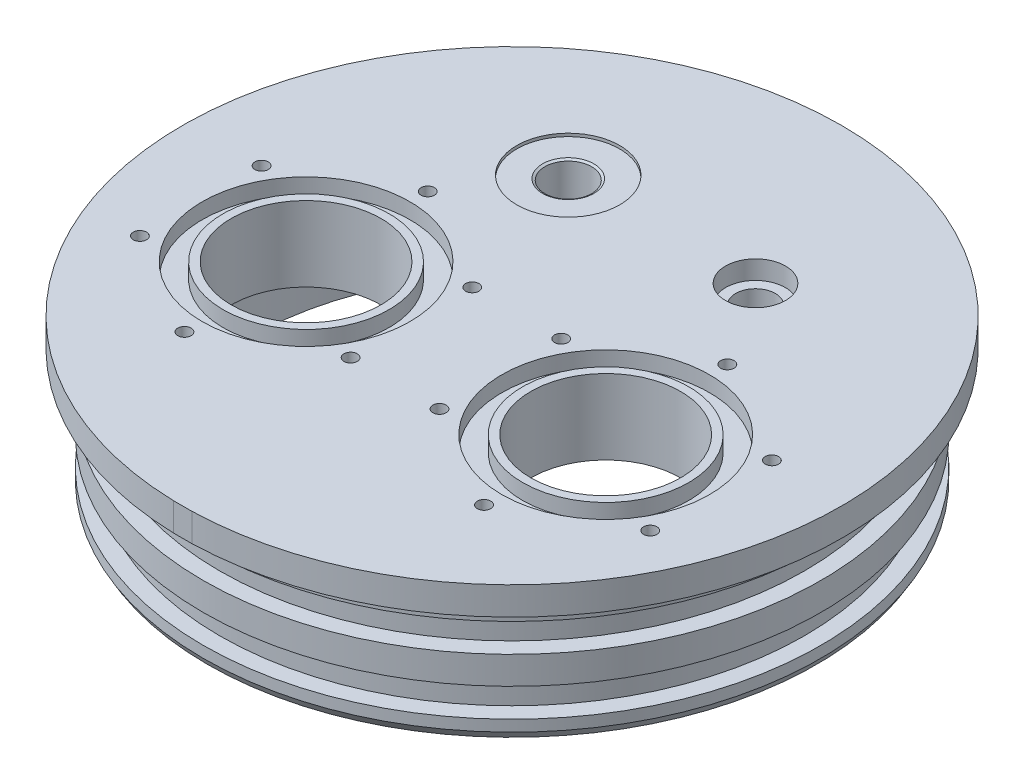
ISO-10303-21;
HEADER;
FILE_DESCRIPTION(('STEP AP214'),'2;1');
FILE_NAME('part.step','',(''),(''),'','','');
FILE_SCHEMA(('AUTOMOTIVE_DESIGN { 1 0 10303 214 1 1 1 1 }'));
ENDSEC;
DATA;
#1=APPLICATION_CONTEXT('core data for automotive mechanical design processes');
#2=APPLICATION_PROTOCOL_DEFINITION('international standard','automotive_design',2000,#1);
#3=PRODUCT_CONTEXT('',#1,'mechanical');
#4=PRODUCT('Part','Part','',(#3));
#5=PRODUCT_RELATED_PRODUCT_CATEGORY('part','',(#4));
#6=PRODUCT_DEFINITION_FORMATION('','',#4);
#7=PRODUCT_DEFINITION_CONTEXT('part definition',#1,'design');
#8=PRODUCT_DEFINITION('design','',#6,#7);
#9=PRODUCT_DEFINITION_SHAPE('','',#8);
#10=(LENGTH_UNIT() NAMED_UNIT(*) SI_UNIT(.MILLI.,.METRE.));
#11=(NAMED_UNIT(*) PLANE_ANGLE_UNIT() SI_UNIT($,.RADIAN.));
#12=(NAMED_UNIT(*) SI_UNIT($,.STERADIAN.) SOLID_ANGLE_UNIT());
#13=UNCERTAINTY_MEASURE_WITH_UNIT(LENGTH_MEASURE(1.E-05),#10,'distance_accuracy_value','');
#14=(GEOMETRIC_REPRESENTATION_CONTEXT(3) GLOBAL_UNCERTAINTY_ASSIGNED_CONTEXT((#13)) GLOBAL_UNIT_ASSIGNED_CONTEXT((#10,
#11,#12)) REPRESENTATION_CONTEXT('',''));
#15=CARTESIAN_POINT('',(0.,0.,0.));
#16=DIRECTION('',(0.,0.,1.));
#17=DIRECTION('',(1.,0.,0.));
#18=AXIS2_PLACEMENT_3D('',#15,#16,#17);
#19=CARTESIAN_POINT('',(-15.875,24.6667651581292,-25.4));
#20=DIRECTION('',(0.,1.,0.));
#21=DIRECTION('',(0.,0.,1.));
#22=AXIS2_PLACEMENT_3D('',#19,#20,#21);
#23=CONICAL_SURFACE('',#22,3.9624,1.04719755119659);
#24=CARTESIAN_POINT('',(-15.875,24.6667651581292,-25.4));
#25=DIRECTION('',(0.,1.,0.));
#26=DIRECTION('',(0.,0.,1.));
#27=AXIS2_PLACEMENT_3D('',#24,#25,#26);
#28=CIRCLE('',#27,3.9624);
#29=CARTESIAN_POINT('',(-15.875,24.6667651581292,-21.4376));
#30=VERTEX_POINT('',#29);
#31=EDGE_CURVE('E46',#30,#30,#28,.T.);
#32=CARTESIAN_POINT('',(-15.875,24.892,-25.4));
#33=DIRECTION('',(0.,1.,0.));
#34=DIRECTION('',(0.,0.,1.));
#35=AXIS2_PLACEMENT_3D('',#32,#33,#34);
#36=CIRCLE('',#35,4.35251818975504);
#37=CARTESIAN_POINT('',(-15.875,24.892,-21.047481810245));
#38=VERTEX_POINT('',#37);
#39=EDGE_CURVE('E86',#38,#38,#36,.T.);
#40=CARTESIAN_POINT('',(-15.875,24.6667651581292,-21.4376));
#41=CARTESIAN_POINT('',(-15.875,24.6691113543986,-21.4335362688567));
#42=CARTESIAN_POINT('',(-15.875,24.6714575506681,-21.4294725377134));
#43=CARTESIAN_POINT('',(-15.875,24.6761499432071,-21.4213450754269));
#44=CARTESIAN_POINT('',(-15.875,24.6784961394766,-21.4172813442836));
#45=CARTESIAN_POINT('',(-15.875,24.6831885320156,-21.409153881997));
#46=CARTESIAN_POINT('',(-15.875,24.6855347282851,-21.4050901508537));
#47=CARTESIAN_POINT('',(-15.875,24.690227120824,-21.3969626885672));
#48=CARTESIAN_POINT('',(-15.875,24.6925733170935,-21.3928989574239));
#49=CARTESIAN_POINT('',(-15.875,24.6972657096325,-21.3847714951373));
#50=CARTESIAN_POINT('',(-15.875,24.699611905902,-21.3807077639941));
#51=CARTESIAN_POINT('',(-15.875,24.704304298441,-21.3725803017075));
#52=CARTESIAN_POINT('',(-15.875,24.7066504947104,-21.3685165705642));
#53=CARTESIAN_POINT('',(-15.875,24.7113428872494,-21.3603891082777));
#54=CARTESIAN_POINT('',(-15.875,24.7136890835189,-21.3563253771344));
#55=CARTESIAN_POINT('',(-15.875,24.7183814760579,-21.3481979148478));
#56=CARTESIAN_POINT('',(-15.875,24.7207276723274,-21.3441341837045));
#57=CARTESIAN_POINT('',(-15.875,24.7254200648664,-21.336006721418));
#58=CARTESIAN_POINT('',(-15.875,24.7277662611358,-21.3319429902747));
#59=CARTESIAN_POINT('',(-15.875,24.7324586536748,-21.3238155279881));
#60=CARTESIAN_POINT('',(-15.875,24.7348048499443,-21.3197517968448));
#61=CARTESIAN_POINT('',(-15.875,24.7394972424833,-21.3116243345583));
#62=CARTESIAN_POINT('',(-15.875,24.7418434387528,-21.307560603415));
#63=CARTESIAN_POINT('',(-15.875,24.7465358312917,-21.2994331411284));
#64=CARTESIAN_POINT('',(-15.875,24.7488820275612,-21.2953694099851));
#65=CARTESIAN_POINT('',(-15.875,24.7535744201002,-21.2872419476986));
#66=CARTESIAN_POINT('',(-15.875,24.7559206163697,-21.2831782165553));
#67=CARTESIAN_POINT('',(-15.875,24.7606130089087,-21.2750507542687));
#68=CARTESIAN_POINT('',(-15.875,24.7629592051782,-21.2709870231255));
#69=CARTESIAN_POINT('',(-15.875,24.7676515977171,-21.2628595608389));
#70=CARTESIAN_POINT('',(-15.875,24.7699977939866,-21.2587958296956));
#71=CARTESIAN_POINT('',(-15.875,24.7746901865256,-21.250668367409));
#72=CARTESIAN_POINT('',(-15.875,24.7770363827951,-21.2466046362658));
#73=CARTESIAN_POINT('',(-15.875,24.7817287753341,-21.2384771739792));
#74=CARTESIAN_POINT('',(-15.875,24.7840749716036,-21.2344134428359));
#75=CARTESIAN_POINT('',(-15.875,24.7887673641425,-21.2262859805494));
#76=CARTESIAN_POINT('',(-15.875,24.791113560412,-21.2222222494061));
#77=CARTESIAN_POINT('',(-15.875,24.795805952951,-21.2140947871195));
#78=CARTESIAN_POINT('',(-15.875,24.7981521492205,-21.2100310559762));
#79=CARTESIAN_POINT('',(-15.875,24.8028445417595,-21.2019035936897));
#80=CARTESIAN_POINT('',(-15.875,24.8051907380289,-21.1978398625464));
#81=CARTESIAN_POINT('',(-15.875,24.8098831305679,-21.1897124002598));
#82=CARTESIAN_POINT('',(-15.875,24.8122293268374,-21.1856486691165));
#83=CARTESIAN_POINT('',(-15.875,24.8169217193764,-21.17752120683));
#84=CARTESIAN_POINT('',(-15.875,24.8192679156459,-21.1734574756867));
#85=CARTESIAN_POINT('',(-15.875,24.8239603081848,-21.1653300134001));
#86=CARTESIAN_POINT('',(-15.875,24.8263065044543,-21.1612662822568));
#87=CARTESIAN_POINT('',(-15.875,24.8309988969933,-21.1531388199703));
#88=CARTESIAN_POINT('',(-15.875,24.8333450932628,-21.149075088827));
#89=CARTESIAN_POINT('',(-15.875,24.8380374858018,-21.1409476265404));
#90=CARTESIAN_POINT('',(-15.875,24.8403836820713,-21.1368838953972));
#91=CARTESIAN_POINT('',(-15.875,24.8450760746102,-21.1287564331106));
#92=CARTESIAN_POINT('',(-15.875,24.8474222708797,-21.1246927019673));
#93=CARTESIAN_POINT('',(-15.875,24.8521146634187,-21.1165652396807));
#94=CARTESIAN_POINT('',(-15.875,24.8544608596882,-21.1125015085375));
#95=CARTESIAN_POINT('',(-15.875,24.8591532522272,-21.1043740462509));
#96=CARTESIAN_POINT('',(-15.875,24.8614994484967,-21.1003103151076));
#97=CARTESIAN_POINT('',(-15.875,24.8661918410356,-21.0921828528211));
#98=CARTESIAN_POINT('',(-15.875,24.8685380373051,-21.0881191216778));
#99=CARTESIAN_POINT('',(-15.875,24.8732304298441,-21.0799916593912));
#100=CARTESIAN_POINT('',(-15.875,24.8755766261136,-21.0759279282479));
#101=CARTESIAN_POINT('',(-15.875,24.8802690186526,-21.0678004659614));
#102=CARTESIAN_POINT('',(-15.875,24.882615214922,-21.0637367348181));
#103=CARTESIAN_POINT('',(-15.875,24.887307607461,-21.0556092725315));
#104=CARTESIAN_POINT('',(-15.875,24.8896538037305,-21.0515455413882));
#105=CARTESIAN_POINT('',(-15.875,24.892,-21.047481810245));
#106=B_SPLINE_CURVE_WITH_KNOTS('',3,(#40,#41,#42,#43,#44,#45,#46,#47,#48,#49,#50,#51,#52,#53,
#54,#55,#56,#57,#58,#59,#60,#61,#62,#63,#64,#65,#66,#67,#68,#69,#70,#71,#72,#73,#74,#75,#76,#77,
#78,#79,#80,#81,#82,#83,#84,#85,#86,#87,#88,#89,#90,#91,#92,#93,#94,#95,#96,#97,#98,#99,#100,
#101,#102,#103,#104,#105),.UNSPECIFIED.,.F.,.F.,(4,2,2,2,2,2,2,2,2,2,2,2,2,2,2,2,2,2,2,2,2,2,2,
2,2,2,2,2,2,2,2,2,4),(0.,0.0140771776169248,0.0281543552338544,0.0422315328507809,
0.0563087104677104,0.0703858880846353,0.0844630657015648,0.0985402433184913,0.112617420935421,
0.126694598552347,0.140771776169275,0.154848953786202,0.168926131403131,0.183003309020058,
0.197080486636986,0.211157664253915,0.225234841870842,0.239312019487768,0.253389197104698,
0.267466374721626,0.281543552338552,0.295620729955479,0.309697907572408,0.323775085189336,
0.337852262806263,0.351929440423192,0.366006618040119,0.380083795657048,0.394160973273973,
0.408238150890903,0.422315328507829,0.436392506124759,0.450469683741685),.UNSPECIFIED.);
#107=EDGE_CURVE('BSEAM39',#30,#38,#106,.T.);
#108=ORIENTED_EDGE('',*,*,#31,.F.);
#109=ORIENTED_EDGE('',*,*,#39,.T.);
#110=ORIENTED_EDGE('',*,*,#107,.T.);
#111=ORIENTED_EDGE('',*,*,#107,.F.);
#112=EDGE_LOOP('',(#108,#110,#109,#111));
#113=FACE_BOUND('',#112,.T.);
#114=ADVANCED_FACE('F39',(#113),#23,.F.);
#115=CARTESIAN_POINT('',(15.875,0.,-25.4));
#116=DIRECTION('',(0.,1.,0.));
#117=DIRECTION('',(0.,0.,1.));
#118=AXIS2_PLACEMENT_3D('',#115,#116,#117);
#119=CYLINDRICAL_SURFACE('',#118,3.36549728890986);
#120=CARTESIAN_POINT('',(15.875,12.7,-25.4));
#121=DIRECTION('',(0.,-1.,0.));
#122=DIRECTION('',(0.,0.,-1.));
#123=AXIS2_PLACEMENT_3D('',#120,#121,#122);
#124=CIRCLE('',#123,3.36549728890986);
#125=CARTESIAN_POINT('',(15.875,12.7,-22.0345027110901));
#126=VERTEX_POINT('',#125);
#127=EDGE_CURVE('E122',#126,#126,#124,.T.);
#128=CARTESIAN_POINT('',(15.875,22.225,-25.4));
#129=DIRECTION('',(0.,1.,0.));
#130=DIRECTION('',(0.,0.,1.));
#131=AXIS2_PLACEMENT_3D('',#128,#129,#130);
#132=CIRCLE('',#131,3.36549728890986);
#133=CARTESIAN_POINT('',(15.875,22.225,-22.0345027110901));
#134=VERTEX_POINT('',#133);
#135=EDGE_CURVE('E92',#134,#134,#132,.F.);
#136=CARTESIAN_POINT('',(15.875,12.7,-22.0345027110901));
#137=CARTESIAN_POINT('',(15.875,12.79921875,-22.0345027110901));
#138=CARTESIAN_POINT('',(15.875,12.8984375,-22.0345027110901));
#139=CARTESIAN_POINT('',(15.875,13.096875,-22.0345027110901));
#140=CARTESIAN_POINT('',(15.875,13.19609375,-22.0345027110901));
#141=CARTESIAN_POINT('',(15.875,13.39453125,-22.0345027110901));
#142=CARTESIAN_POINT('',(15.875,13.49375,-22.0345027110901));
#143=CARTESIAN_POINT('',(15.875,13.6921875,-22.0345027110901));
#144=CARTESIAN_POINT('',(15.875,13.79140625,-22.0345027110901));
#145=CARTESIAN_POINT('',(15.875,13.98984375,-22.0345027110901));
#146=CARTESIAN_POINT('',(15.875,14.0890625,-22.0345027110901));
#147=CARTESIAN_POINT('',(15.875,14.2875,-22.0345027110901));
#148=CARTESIAN_POINT('',(15.875,14.38671875,-22.0345027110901));
#149=CARTESIAN_POINT('',(15.875,14.58515625,-22.0345027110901));
#150=CARTESIAN_POINT('',(15.875,14.684375,-22.0345027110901));
#151=CARTESIAN_POINT('',(15.875,14.8828125,-22.0345027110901));
#152=CARTESIAN_POINT('',(15.875,14.98203125,-22.0345027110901));
#153=CARTESIAN_POINT('',(15.875,15.18046875,-22.0345027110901));
#154=CARTESIAN_POINT('',(15.875,15.2796875,-22.0345027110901));
#155=CARTESIAN_POINT('',(15.875,15.478125,-22.0345027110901));
#156=CARTESIAN_POINT('',(15.875,15.57734375,-22.0345027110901));
#157=CARTESIAN_POINT('',(15.875,15.77578125,-22.0345027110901));
#158=CARTESIAN_POINT('',(15.875,15.875,-22.0345027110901));
#159=CARTESIAN_POINT('',(15.875,16.0734375,-22.0345027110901));
#160=CARTESIAN_POINT('',(15.875,16.17265625,-22.0345027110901));
#161=CARTESIAN_POINT('',(15.875,16.37109375,-22.0345027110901));
#162=CARTESIAN_POINT('',(15.875,16.4703125,-22.0345027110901));
#163=CARTESIAN_POINT('',(15.875,16.66875,-22.0345027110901));
#164=CARTESIAN_POINT('',(15.875,16.76796875,-22.0345027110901));
#165=CARTESIAN_POINT('',(15.875,16.96640625,-22.0345027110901));
#166=CARTESIAN_POINT('',(15.875,17.065625,-22.0345027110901));
#167=CARTESIAN_POINT('',(15.875,17.2640625,-22.0345027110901));
#168=CARTESIAN_POINT('',(15.875,17.36328125,-22.0345027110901));
#169=CARTESIAN_POINT('',(15.875,17.56171875,-22.0345027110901));
#170=CARTESIAN_POINT('',(15.875,17.6609375,-22.0345027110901));
#171=CARTESIAN_POINT('',(15.875,17.859375,-22.0345027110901));
#172=CARTESIAN_POINT('',(15.875,17.95859375,-22.0345027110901));
#173=CARTESIAN_POINT('',(15.875,18.15703125,-22.0345027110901));
#174=CARTESIAN_POINT('',(15.875,18.25625,-22.0345027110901));
#175=CARTESIAN_POINT('',(15.875,18.4546875,-22.0345027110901));
#176=CARTESIAN_POINT('',(15.875,18.55390625,-22.0345027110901));
#177=CARTESIAN_POINT('',(15.875,18.75234375,-22.0345027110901));
#178=CARTESIAN_POINT('',(15.875,18.8515625,-22.0345027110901));
#179=CARTESIAN_POINT('',(15.875,19.05,-22.0345027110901));
#180=CARTESIAN_POINT('',(15.875,19.14921875,-22.0345027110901));
#181=CARTESIAN_POINT('',(15.875,19.34765625,-22.0345027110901));
#182=CARTESIAN_POINT('',(15.875,19.446875,-22.0345027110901));
#183=CARTESIAN_POINT('',(15.875,19.6453125,-22.0345027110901));
#184=CARTESIAN_POINT('',(15.875,19.74453125,-22.0345027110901));
#185=CARTESIAN_POINT('',(15.875,19.94296875,-22.0345027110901));
#186=CARTESIAN_POINT('',(15.875,20.0421875,-22.0345027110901));
#187=CARTESIAN_POINT('',(15.875,20.240625,-22.0345027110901));
#188=CARTESIAN_POINT('',(15.875,20.33984375,-22.0345027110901));
#189=CARTESIAN_POINT('',(15.875,20.53828125,-22.0345027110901));
#190=CARTESIAN_POINT('',(15.875,20.6375,-22.0345027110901));
#191=CARTESIAN_POINT('',(15.875,20.8359375,-22.0345027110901));
#192=CARTESIAN_POINT('',(15.875,20.93515625,-22.0345027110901));
#193=CARTESIAN_POINT('',(15.875,21.13359375,-22.0345027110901));
#194=CARTESIAN_POINT('',(15.875,21.2328125,-22.0345027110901));
#195=CARTESIAN_POINT('',(15.875,21.43125,-22.0345027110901));
#196=CARTESIAN_POINT('',(15.875,21.53046875,-22.0345027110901));
#197=CARTESIAN_POINT('',(15.875,21.72890625,-22.0345027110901));
#198=CARTESIAN_POINT('',(15.875,21.828125,-22.0345027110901));
#199=CARTESIAN_POINT('',(15.875,22.0265625,-22.0345027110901));
#200=CARTESIAN_POINT('',(15.875,22.12578125,-22.0345027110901));
#201=CARTESIAN_POINT('',(15.875,22.225,-22.0345027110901));
#202=B_SPLINE_CURVE_WITH_KNOTS('',3,(#136,#137,#138,#139,#140,#141,#142,#143,#144,#145,#146,
#147,#148,#149,#150,#151,#152,#153,#154,#155,#156,#157,#158,#159,#160,#161,#162,#163,#164,#165,
#166,#167,#168,#169,#170,#171,#172,#173,#174,#175,#176,#177,#178,#179,#180,#181,#182,#183,#184,
#185,#186,#187,#188,#189,#190,#191,#192,#193,#194,#195,#196,#197,#198,#199,#200,#201),
.UNSPECIFIED.,.F.,.F.,(4,2,2,2,2,2,2,2,2,2,2,2,2,2,2,2,2,2,2,2,2,2,2,2,2,2,2,2,2,2,2,2,4),(0.,
0.29765625,0.5953125,0.892968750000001,1.190625,1.48828125,1.7859375,2.08359375,2.38125,
2.67890625,2.9765625,3.27421875,3.571875,3.86953125,4.1671875,4.46484375,4.7625,5.06015625,
5.3578125,5.65546875,5.953125,6.25078125,6.5484375,6.84609375,7.14375,7.44140625,7.7390625,
8.03671875,8.334375,8.63203125,8.9296875,9.22734375,9.525),.UNSPECIFIED.);
#203=EDGE_CURVE('BSEAM323',#126,#134,#202,.T.);
#204=ORIENTED_EDGE('',*,*,#127,.T.);
#205=ORIENTED_EDGE('',*,*,#135,.F.);
#206=ORIENTED_EDGE('',*,*,#203,.T.);
#207=ORIENTED_EDGE('',*,*,#203,.F.);
#208=EDGE_LOOP('',(#204,#206,#205,#207));
#209=FACE_BOUND('',#208,.T.);
#210=ADVANCED_FACE('F323',(#209),#119,.F.);
#211=CARTESIAN_POINT('',(55.88,25.4,0.));
#212=DIRECTION('',(0.,1.,0.));
#213=DIRECTION('',(0.,0.,1.));
#214=AXIS2_PLACEMENT_3D('',#211,#212,#213);
#215=PLANE('',#214);
#216=CARTESIAN_POINT('',(25.4,25.4,9.525));
#217=DIRECTION('',(0.,1.,0.));
#218=DIRECTION('',(0.,0.,1.));
#219=AXIS2_PLACEMENT_3D('',#216,#217,#218);
#220=CIRCLE('',#219,12.7);
#221=CARTESIAN_POINT('',(25.4,25.4,22.225));
#222=VERTEX_POINT('',#221);
#223=EDGE_CURVE('E205',#222,#222,#220,.T.);
#224=ORIENTED_EDGE('',*,*,#223,.F.);
#225=EDGE_LOOP('',(#224));
#226=FACE_BOUND('',#225,.T.);
#227=CARTESIAN_POINT('',(25.4,25.4,9.525));
#228=DIRECTION('',(0.,1.,0.));
#229=DIRECTION('',(0.,0.,1.));
#230=AXIS2_PLACEMENT_3D('',#227,#228,#229);
#231=CIRCLE('',#230,14.0843);
#232=CARTESIAN_POINT('',(25.4,25.4,23.6093));
#233=VERTEX_POINT('',#232);
#234=EDGE_CURVE('E168',#233,#233,#231,.T.);
#235=ORIENTED_EDGE('',*,*,#234,.T.);
#236=EDGE_LOOP('',(#235));
#237=FACE_BOUND('',#236,.T.);
#238=ADVANCED_FACE('F272',(#226,#237),#215,.T.);
#239=CARTESIAN_POINT('',(-25.4,25.4,9.525));
#240=DIRECTION('',(0.,1.,0.));
#241=DIRECTION('',(0.,0.,1.));
#242=AXIS2_PLACEMENT_3D('',#239,#240,#241);
#243=CIRCLE('',#242,12.7);
#244=CARTESIAN_POINT('',(-25.4,25.4,22.225));
#245=VERTEX_POINT('',#244);
#246=EDGE_CURVE('E204',#245,#245,#243,.T.);
#247=ORIENTED_EDGE('',*,*,#246,.F.);
#248=EDGE_LOOP('',(#247));
#249=FACE_BOUND('',#248,.T.);
#250=CARTESIAN_POINT('',(-25.4,25.4,9.525));
#251=DIRECTION('',(0.,1.,0.));
#252=DIRECTION('',(0.,0.,1.));
#253=AXIS2_PLACEMENT_3D('',#250,#251,#252);
#254=CIRCLE('',#253,14.0843);
#255=CARTESIAN_POINT('',(-25.4,25.4,23.6093));
#256=VERTEX_POINT('',#255);
#257=EDGE_CURVE('E180',#256,#256,#254,.T.);
#258=ORIENTED_EDGE('',*,*,#257,.T.);
#259=EDGE_LOOP('',(#258));
#260=FACE_BOUND('',#259,.T.);
#261=ADVANCED_FACE('F273',(#249,#260),#215,.T.);
#262=CARTESIAN_POINT('',(-25.4,0.,9.525));
#263=DIRECTION('',(0.,1.,0.));
#264=DIRECTION('',(0.,0.,1.));
#265=AXIS2_PLACEMENT_3D('',#262,#263,#264);
#266=CYLINDRICAL_SURFACE('',#265,12.7);
#267=CARTESIAN_POINT('',(-25.4,12.7,9.525));
#268=DIRECTION('',(0.,-1.,0.));
#269=DIRECTION('',(0.,0.,-1.));
#270=AXIS2_PLACEMENT_3D('',#267,#268,#269);
#271=CIRCLE('',#270,12.7);
#272=CARTESIAN_POINT('',(-25.4,12.7,22.225));
#273=VERTEX_POINT('',#272);
#274=EDGE_CURVE('E201',#273,#273,#271,.F.);
#275=CARTESIAN_POINT('',(-25.4,25.4,22.225));
#276=CARTESIAN_POINT('',(-25.4,25.2677083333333,22.225));
#277=CARTESIAN_POINT('',(-25.4,25.1354166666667,22.225));
#278=CARTESIAN_POINT('',(-25.4,24.8708333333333,22.225));
#279=CARTESIAN_POINT('',(-25.4,24.7385416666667,22.225));
#280=CARTESIAN_POINT('',(-25.4,24.4739583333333,22.225));
#281=CARTESIAN_POINT('',(-25.4,24.3416666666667,22.225));
#282=CARTESIAN_POINT('',(-25.4,24.0770833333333,22.225));
#283=CARTESIAN_POINT('',(-25.4,23.9447916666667,22.225));
#284=CARTESIAN_POINT('',(-25.4,23.6802083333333,22.225));
#285=CARTESIAN_POINT('',(-25.4,23.5479166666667,22.225));
#286=CARTESIAN_POINT('',(-25.4,23.2833333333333,22.225));
#287=CARTESIAN_POINT('',(-25.4,23.1510416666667,22.225));
#288=CARTESIAN_POINT('',(-25.4,22.8864583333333,22.225));
#289=CARTESIAN_POINT('',(-25.4,22.7541666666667,22.225));
#290=CARTESIAN_POINT('',(-25.4,22.4895833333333,22.225));
#291=CARTESIAN_POINT('',(-25.4,22.3572916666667,22.225));
#292=CARTESIAN_POINT('',(-25.4,22.0927083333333,22.225));
#293=CARTESIAN_POINT('',(-25.4,21.9604166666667,22.225));
#294=CARTESIAN_POINT('',(-25.4,21.6958333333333,22.225));
#295=CARTESIAN_POINT('',(-25.4,21.5635416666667,22.225));
#296=CARTESIAN_POINT('',(-25.4,21.2989583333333,22.225));
#297=CARTESIAN_POINT('',(-25.4,21.1666666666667,22.225));
#298=CARTESIAN_POINT('',(-25.4,20.9020833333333,22.225));
#299=CARTESIAN_POINT('',(-25.4,20.7697916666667,22.225));
#300=CARTESIAN_POINT('',(-25.4,20.5052083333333,22.225));
#301=CARTESIAN_POINT('',(-25.4,20.3729166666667,22.225));
#302=CARTESIAN_POINT('',(-25.4,20.1083333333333,22.225));
#303=CARTESIAN_POINT('',(-25.4,19.9760416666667,22.225));
#304=CARTESIAN_POINT('',(-25.4,19.7114583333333,22.225));
#305=CARTESIAN_POINT('',(-25.4,19.5791666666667,22.225));
#306=CARTESIAN_POINT('',(-25.4,19.3145833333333,22.225));
#307=CARTESIAN_POINT('',(-25.4,19.1822916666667,22.225));
#308=CARTESIAN_POINT('',(-25.4,18.9177083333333,22.225));
#309=CARTESIAN_POINT('',(-25.4,18.7854166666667,22.225));
#310=CARTESIAN_POINT('',(-25.4,18.5208333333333,22.225));
#311=CARTESIAN_POINT('',(-25.4,18.3885416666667,22.225));
#312=CARTESIAN_POINT('',(-25.4,18.1239583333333,22.225));
#313=CARTESIAN_POINT('',(-25.4,17.9916666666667,22.225));
#314=CARTESIAN_POINT('',(-25.4,17.7270833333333,22.225));
#315=CARTESIAN_POINT('',(-25.4,17.5947916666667,22.225));
#316=CARTESIAN_POINT('',(-25.4,17.3302083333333,22.225));
#317=CARTESIAN_POINT('',(-25.4,17.1979166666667,22.225));
#318=CARTESIAN_POINT('',(-25.4,16.9333333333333,22.225));
#319=CARTESIAN_POINT('',(-25.4,16.8010416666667,22.225));
#320=CARTESIAN_POINT('',(-25.4,16.5364583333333,22.225));
#321=CARTESIAN_POINT('',(-25.4,16.4041666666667,22.225));
#322=CARTESIAN_POINT('',(-25.4,16.1395833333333,22.225));
#323=CARTESIAN_POINT('',(-25.4,16.0072916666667,22.225));
#324=CARTESIAN_POINT('',(-25.4,15.7427083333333,22.225));
#325=CARTESIAN_POINT('',(-25.4,15.6104166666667,22.225));
#326=CARTESIAN_POINT('',(-25.4,15.3458333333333,22.225));
#327=CARTESIAN_POINT('',(-25.4,15.2135416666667,22.225));
#328=CARTESIAN_POINT('',(-25.4,14.9489583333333,22.225));
#329=CARTESIAN_POINT('',(-25.4,14.8166666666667,22.225));
#330=CARTESIAN_POINT('',(-25.4,14.5520833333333,22.225));
#331=CARTESIAN_POINT('',(-25.4,14.4197916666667,22.225));
#332=CARTESIAN_POINT('',(-25.4,14.1552083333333,22.225));
#333=CARTESIAN_POINT('',(-25.4,14.0229166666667,22.225));
#334=CARTESIAN_POINT('',(-25.4,13.7583333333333,22.225));
#335=CARTESIAN_POINT('',(-25.4,13.6260416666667,22.225));
#336=CARTESIAN_POINT('',(-25.4,13.3614583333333,22.225));
#337=CARTESIAN_POINT('',(-25.4,13.2291666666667,22.225));
#338=CARTESIAN_POINT('',(-25.4,12.9645833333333,22.225));
#339=CARTESIAN_POINT('',(-25.4,12.8322916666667,22.225));
#340=CARTESIAN_POINT('',(-25.4,12.7,22.225));
#341=B_SPLINE_CURVE_WITH_KNOTS('',3,(#275,#276,#277,#278,#279,#280,#281,#282,#283,#284,#285,
#286,#287,#288,#289,#290,#291,#292,#293,#294,#295,#296,#297,#298,#299,#300,#301,#302,#303,#304,
#305,#306,#307,#308,#309,#310,#311,#312,#313,#314,#315,#316,#317,#318,#319,#320,#321,#322,#323,
#324,#325,#326,#327,#328,#329,#330,#331,#332,#333,#334,#335,#336,#337,#338,#339,#340),
.UNSPECIFIED.,.F.,.F.,(4,2,2,2,2,2,2,2,2,2,2,2,2,2,2,2,2,2,2,2,2,2,2,2,2,2,2,2,2,2,2,2,4),(0.,
0.396875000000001,0.793749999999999,1.190625,1.5875,1.984375,2.38125,2.778125,3.175,3.571875,
3.96875,4.365625,4.7625,5.159375,5.55625,5.953125,6.35,6.746875,7.14375,7.540625,7.9375,
8.334375,8.73125,9.128125,9.525,9.921875,10.31875,10.715625,11.1125,11.509375,11.90625,
12.303125,12.7),.UNSPECIFIED.);
#342=EDGE_CURVE('BSEAM350',#245,#273,#341,.T.);
#343=ORIENTED_EDGE('',*,*,#246,.T.);
#344=ORIENTED_EDGE('',*,*,#274,.F.);
#345=ORIENTED_EDGE('',*,*,#342,.T.);
#346=ORIENTED_EDGE('',*,*,#342,.F.);
#347=EDGE_LOOP('',(#343,#345,#344,#346));
#348=FACE_BOUND('',#347,.T.);
#349=ADVANCED_FACE('F350',(#348),#266,.F.);
#350=CARTESIAN_POINT('',(25.4,0.,9.525));
#351=DIRECTION('',(0.,1.,0.));
#352=DIRECTION('',(0.,0.,1.));
#353=AXIS2_PLACEMENT_3D('',#350,#351,#352);
#354=CYLINDRICAL_SURFACE('',#353,12.7);
#355=CARTESIAN_POINT('',(25.4,12.7,9.525));
#356=DIRECTION('',(0.,-1.,0.));
#357=DIRECTION('',(0.,0.,-1.));
#358=AXIS2_PLACEMENT_3D('',#355,#356,#357);
#359=CIRCLE('',#358,12.7);
#360=CARTESIAN_POINT('',(25.4,12.7,22.225));
#361=VERTEX_POINT('',#360);
#362=EDGE_CURVE('E198',#361,#361,#359,.F.);
#363=CARTESIAN_POINT('',(25.4,25.4,22.225));
#364=CARTESIAN_POINT('',(25.4,25.2677083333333,22.225));
#365=CARTESIAN_POINT('',(25.4,25.1354166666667,22.225));
#366=CARTESIAN_POINT('',(25.4,24.8708333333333,22.225));
#367=CARTESIAN_POINT('',(25.4,24.7385416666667,22.225));
#368=CARTESIAN_POINT('',(25.4,24.4739583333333,22.225));
#369=CARTESIAN_POINT('',(25.4,24.3416666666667,22.225));
#370=CARTESIAN_POINT('',(25.4,24.0770833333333,22.225));
#371=CARTESIAN_POINT('',(25.4,23.9447916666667,22.225));
#372=CARTESIAN_POINT('',(25.4,23.6802083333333,22.225));
#373=CARTESIAN_POINT('',(25.4,23.5479166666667,22.225));
#374=CARTESIAN_POINT('',(25.4,23.2833333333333,22.225));
#375=CARTESIAN_POINT('',(25.4,23.1510416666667,22.225));
#376=CARTESIAN_POINT('',(25.4,22.8864583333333,22.225));
#377=CARTESIAN_POINT('',(25.4,22.7541666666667,22.225));
#378=CARTESIAN_POINT('',(25.4,22.4895833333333,22.225));
#379=CARTESIAN_POINT('',(25.4,22.3572916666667,22.225));
#380=CARTESIAN_POINT('',(25.4,22.0927083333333,22.225));
#381=CARTESIAN_POINT('',(25.4,21.9604166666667,22.225));
#382=CARTESIAN_POINT('',(25.4,21.6958333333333,22.225));
#383=CARTESIAN_POINT('',(25.4,21.5635416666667,22.225));
#384=CARTESIAN_POINT('',(25.4,21.2989583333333,22.225));
#385=CARTESIAN_POINT('',(25.4,21.1666666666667,22.225));
#386=CARTESIAN_POINT('',(25.4,20.9020833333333,22.225));
#387=CARTESIAN_POINT('',(25.4,20.7697916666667,22.225));
#388=CARTESIAN_POINT('',(25.4,20.5052083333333,22.225));
#389=CARTESIAN_POINT('',(25.4,20.3729166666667,22.225));
#390=CARTESIAN_POINT('',(25.4,20.1083333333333,22.225));
#391=CARTESIAN_POINT('',(25.4,19.9760416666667,22.225));
#392=CARTESIAN_POINT('',(25.4,19.7114583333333,22.225));
#393=CARTESIAN_POINT('',(25.4,19.5791666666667,22.225));
#394=CARTESIAN_POINT('',(25.4,19.3145833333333,22.225));
#395=CARTESIAN_POINT('',(25.4,19.1822916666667,22.225));
#396=CARTESIAN_POINT('',(25.4,18.9177083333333,22.225));
#397=CARTESIAN_POINT('',(25.4,18.7854166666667,22.225));
#398=CARTESIAN_POINT('',(25.4,18.5208333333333,22.225));
#399=CARTESIAN_POINT('',(25.4,18.3885416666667,22.225));
#400=CARTESIAN_POINT('',(25.4,18.1239583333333,22.225));
#401=CARTESIAN_POINT('',(25.4,17.9916666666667,22.225));
#402=CARTESIAN_POINT('',(25.4,17.7270833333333,22.225));
#403=CARTESIAN_POINT('',(25.4,17.5947916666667,22.225));
#404=CARTESIAN_POINT('',(25.4,17.3302083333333,22.225));
#405=CARTESIAN_POINT('',(25.4,17.1979166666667,22.225));
#406=CARTESIAN_POINT('',(25.4,16.9333333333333,22.225));
#407=CARTESIAN_POINT('',(25.4,16.8010416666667,22.225));
#408=CARTESIAN_POINT('',(25.4,16.5364583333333,22.225));
#409=CARTESIAN_POINT('',(25.4,16.4041666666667,22.225));
#410=CARTESIAN_POINT('',(25.4,16.1395833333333,22.225));
#411=CARTESIAN_POINT('',(25.4,16.0072916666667,22.225));
#412=CARTESIAN_POINT('',(25.4,15.7427083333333,22.225));
#413=CARTESIAN_POINT('',(25.4,15.6104166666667,22.225));
#414=CARTESIAN_POINT('',(25.4,15.3458333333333,22.225));
#415=CARTESIAN_POINT('',(25.4,15.2135416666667,22.225));
#416=CARTESIAN_POINT('',(25.4,14.9489583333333,22.225));
#417=CARTESIAN_POINT('',(25.4,14.8166666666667,22.225));
#418=CARTESIAN_POINT('',(25.4,14.5520833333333,22.225));
#419=CARTESIAN_POINT('',(25.4,14.4197916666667,22.225));
#420=CARTESIAN_POINT('',(25.4,14.1552083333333,22.225));
#421=CARTESIAN_POINT('',(25.4,14.0229166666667,22.225));
#422=CARTESIAN_POINT('',(25.4,13.7583333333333,22.225));
#423=CARTESIAN_POINT('',(25.4,13.6260416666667,22.225));
#424=CARTESIAN_POINT('',(25.4,13.3614583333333,22.225));
#425=CARTESIAN_POINT('',(25.4,13.2291666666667,22.225));
#426=CARTESIAN_POINT('',(25.4,12.9645833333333,22.225));
#427=CARTESIAN_POINT('',(25.4,12.8322916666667,22.225));
#428=CARTESIAN_POINT('',(25.4,12.7,22.225));
#429=B_SPLINE_CURVE_WITH_KNOTS('',3,(#363,#364,#365,#366,#367,#368,#369,#370,#371,#372,#373,
#374,#375,#376,#377,#378,#379,#380,#381,#382,#383,#384,#385,#386,#387,#388,#389,#390,#391,#392,
#393,#394,#395,#396,#397,#398,#399,#400,#401,#402,#403,#404,#405,#406,#407,#408,#409,#410,#411,
#412,#413,#414,#415,#416,#417,#418,#419,#420,#421,#422,#423,#424,#425,#426,#427,#428),
.UNSPECIFIED.,.F.,.F.,(4,2,2,2,2,2,2,2,2,2,2,2,2,2,2,2,2,2,2,2,2,2,2,2,2,2,2,2,2,2,2,2,4),(0.,
0.396875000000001,0.793749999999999,1.190625,1.5875,1.984375,2.38125,2.778125,3.175,3.571875,
3.96875,4.365625,4.7625,5.159375,5.55625,5.953125,6.35,6.746875,7.14375,7.540625,7.9375,
8.334375,8.73125,9.128125,9.525,9.921875,10.31875,10.715625,11.1125,11.509375,11.90625,
12.303125,12.7),.UNSPECIFIED.);
#430=EDGE_CURVE('BSEAM352',#222,#361,#429,.T.);
#431=ORIENTED_EDGE('',*,*,#223,.T.);
#432=ORIENTED_EDGE('',*,*,#362,.F.);
#433=ORIENTED_EDGE('',*,*,#430,.T.);
#434=ORIENTED_EDGE('',*,*,#430,.F.);
#435=EDGE_LOOP('',(#431,#433,#432,#434));
#436=FACE_BOUND('',#435,.T.);
#437=ADVANCED_FACE('F352',(#436),#354,.F.);
#438=CARTESIAN_POINT('',(0.,0.,0.));
#439=DIRECTION('',(0.,-1.,0.));
#440=DIRECTION('',(0.,0.,-1.));
#441=AXIS2_PLACEMENT_3D('',#438,#439,#440);
#442=CYLINDRICAL_SURFACE('',#441,52.3621);
#443=CARTESIAN_POINT('',(0.,12.7,0.));
#444=DIRECTION('',(0.,-1.,0.));
#445=DIRECTION('',(0.,0.,-1.));
#446=AXIS2_PLACEMENT_3D('',#443,#444,#445);
#447=CIRCLE('',#446,52.3621);
#448=CARTESIAN_POINT('',(0.,12.7,-52.3621));
#449=VERTEX_POINT('',#448);
#450=EDGE_CURVE('E220',#449,#449,#447,.F.);
#451=ORIENTED_EDGE('',*,*,#450,.F.);
#452=EDGE_LOOP('',(#451));
#453=FACE_BOUND('',#452,.T.);
#454=CARTESIAN_POINT('',(0.,8.001,0.));
#455=DIRECTION('',(0.,-1.,0.));
#456=DIRECTION('',(0.,0.,-1.));
#457=AXIS2_PLACEMENT_3D('',#454,#455,#456);
#458=CIRCLE('',#457,52.3621);
#459=CARTESIAN_POINT('',(0.,8.001,-52.3621));
#460=VERTEX_POINT('',#459);
#461=EDGE_CURVE('E223',#460,#460,#458,.F.);
#462=ORIENTED_EDGE('',*,*,#461,.T.);
#463=EDGE_LOOP('',(#462));
#464=FACE_BOUND('',#463,.T.);
#465=ADVANCED_FACE('F358',(#453,#464),#442,.T.);
#466=CARTESIAN_POINT('',(0.,20.6502,0.));
#467=DIRECTION('',(0.,-1.,0.));
#468=DIRECTION('',(0.,0.,-1.));
#469=AXIS2_PLACEMENT_3D('',#466,#467,#468);
#470=CIRCLE('',#469,52.3621);
#471=CARTESIAN_POINT('',(0.,20.6502,-52.3621));
#472=VERTEX_POINT('',#471);
#473=EDGE_CURVE('E226',#472,#472,#470,.T.);
#474=ORIENTED_EDGE('',*,*,#473,.T.);
#475=EDGE_LOOP('',(#474));
#476=FACE_BOUND('',#475,.T.);
#477=CARTESIAN_POINT('',(0.,17.526,0.));
#478=DIRECTION('',(0.,-1.,0.));
#479=DIRECTION('',(0.,0.,-1.));
#480=AXIS2_PLACEMENT_3D('',#477,#478,#479);
#481=CIRCLE('',#480,52.3621);
#482=CARTESIAN_POINT('',(0.,17.526,-52.3621));
#483=VERTEX_POINT('',#482);
#484=EDGE_CURVE('E71',#483,#483,#481,.F.);
#485=ORIENTED_EDGE('',*,*,#484,.T.);
#486=EDGE_LOOP('',(#485));
#487=FACE_BOUND('',#486,.T.);
#488=ADVANCED_FACE('F393',(#476,#487),#442,.T.);
#489=CARTESIAN_POINT('',(52.3621,20.6502,0.));
#490=DIRECTION('',(0.,-1.,0.));
#491=DIRECTION('',(0.,0.,-1.));
#492=AXIS2_PLACEMENT_3D('',#489,#490,#491);
#493=PLANE('',#492);
#494=DIRECTION('',(1.,0.,0.));
#495=VECTOR('',#494,1.);
#496=CARTESIAN_POINT('',(52.3621,20.6502,55.8578052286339));
#497=LINE('',#496,#495);
#498=CARTESIAN_POINT('',(-1.57479999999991,20.6502,55.8578052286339));
#499=VERTEX_POINT('',#498);
#500=CARTESIAN_POINT('',(1.57479999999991,20.6502,55.8578052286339));
#501=VERTEX_POINT('',#500);
#502=EDGE_CURVE('E52',#499,#501,#497,.T.);
#503=ORIENTED_EDGE('',*,*,#502,.F.);
#504=CARTESIAN_POINT('',(0.,20.6502,0.));
#505=DIRECTION('',(0.,-1.,0.));
#506=DIRECTION('',(0.,0.,-1.));
#507=AXIS2_PLACEMENT_3D('',#504,#505,#506);
#508=CIRCLE('',#507,55.88);
#509=EDGE_CURVE('E70',#499,#501,#508,.T.);
#510=ORIENTED_EDGE('',*,*,#509,.T.);
#511=EDGE_LOOP('',(#503,#510));
#512=FACE_BOUND('',#511,.T.);
#513=ORIENTED_EDGE('',*,*,#473,.F.);
#514=EDGE_LOOP('',(#513));
#515=FACE_BOUND('',#514,.T.);
#516=ADVANCED_FACE('F390',(#512,#515),#493,.T.);
#517=CARTESIAN_POINT('',(0.,0.,0.));
#518=DIRECTION('',(0.,-1.,0.));
#519=DIRECTION('',(0.,0.,-1.));
#520=AXIS2_PLACEMENT_3D('',#517,#518,#519);
#521=CYLINDRICAL_SURFACE('',#520,55.88);
#522=DIRECTION('',(0.,-1.,0.));
#523=VECTOR('',#522,1.);
#524=CARTESIAN_POINT('',(1.57479999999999,226.135580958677,55.8578052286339));
#525=LINE('',#524,#523);
#526=CARTESIAN_POINT('',(1.57479999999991,25.4,55.8578052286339));
#527=VERTEX_POINT('',#526);
#528=EDGE_CURVE('E59',#527,#501,#525,.T.);
#529=ORIENTED_EDGE('',*,*,#528,.T.);
#530=ORIENTED_EDGE('',*,*,#509,.F.);
#531=DIRECTION('',(0.,-1.,0.));
#532=VECTOR('',#531,1.);
#533=CARTESIAN_POINT('',(-1.57479999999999,226.135580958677,55.8578052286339));
#534=LINE('',#533,#532);
#535=CARTESIAN_POINT('',(-1.57479999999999,25.4,55.8578052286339));
#536=VERTEX_POINT('',#535);
#537=EDGE_CURVE('E74',#536,#499,#534,.T.);
#538=ORIENTED_EDGE('',*,*,#537,.F.);
#539=CARTESIAN_POINT('',(0.,25.4,0.));
#540=DIRECTION('',(0.,-1.,0.));
#541=DIRECTION('',(0.,0.,-1.));
#542=AXIS2_PLACEMENT_3D('',#539,#540,#541);
#543=CIRCLE('',#542,55.88);
#544=EDGE_CURVE('E66',#536,#527,#543,.T.);
#545=ORIENTED_EDGE('',*,*,#544,.T.);
#546=EDGE_LOOP('',(#529,#530,#538,#545));
#547=FACE_BOUND('',#546,.T.);
#548=ADVANCED_FACE('F75',(#547),#521,.T.);
#549=DIRECTION('',(-1.,0.,0.));
#550=VECTOR('',#549,1.);
#551=CARTESIAN_POINT('',(55.88,25.4,55.8578052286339));
#552=LINE('',#551,#550);
#553=EDGE_CURVE('E12',#527,#536,#552,.T.);
#554=ORIENTED_EDGE('',*,*,#553,.F.);
#555=ORIENTED_EDGE('',*,*,#544,.F.);
#556=EDGE_LOOP('',(#554,#555));
#557=FACE_BOUND('',#556,.T.);
#558=CARTESIAN_POINT('',(-15.875,25.4,-25.4));
#559=DIRECTION('',(0.,1.,0.));
#560=DIRECTION('',(0.,0.,1.));
#561=AXIS2_PLACEMENT_3D('',#558,#559,#560);
#562=CIRCLE('',#561,8.7249);
#563=CARTESIAN_POINT('',(-15.875,25.4,-16.6751));
#564=VERTEX_POINT('',#563);
#565=EDGE_CURVE('E80',#564,#564,#562,.T.);
#566=ORIENTED_EDGE('',*,*,#565,.F.);
#567=EDGE_LOOP('',(#566));
#568=FACE_BOUND('',#567,.T.);
#569=CARTESIAN_POINT('',(15.875,25.4,-25.4));
#570=DIRECTION('',(0.,1.,0.));
#571=DIRECTION('',(0.,0.,1.));
#572=AXIS2_PLACEMENT_3D('',#569,#570,#571);
#573=CIRCLE('',#572,5.08);
#574=CARTESIAN_POINT('',(15.875,25.4,-20.32));
#575=VERTEX_POINT('',#574);
#576=EDGE_CURVE('E93',#575,#575,#573,.T.);
#577=ORIENTED_EDGE('',*,*,#576,.F.);
#578=EDGE_LOOP('',(#577));
#579=FACE_BOUND('',#578,.T.);
#580=CARTESIAN_POINT('',(43.2616007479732,25.4,-0.787400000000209));
#581=DIRECTION('',(0.,1.,0.));
#582=DIRECTION('',(-0.866025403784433,0.,0.50000000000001));
#583=AXIS2_PLACEMENT_3D('',#580,#581,#582);
#584=CIRCLE('',#583,1.1303);
#585=CARTESIAN_POINT('',(43.2616007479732,25.4,0.342899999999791));
#586=VERTEX_POINT('',#585);
#587=EDGE_CURVE('E119',#586,#586,#584,.T.);
#588=ORIENTED_EDGE('',*,*,#587,.F.);
#589=EDGE_LOOP('',(#588));
#590=FACE_BOUND('',#589,.T.);
#591=CARTESIAN_POINT('',(43.2616007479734,25.4,19.8373999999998));
#592=DIRECTION('',(0.,1.,0.));
#593=DIRECTION('',(-0.866025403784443,0.,-0.499999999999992));
#594=AXIS2_PLACEMENT_3D('',#591,#592,#593);
#595=CIRCLE('',#594,1.1303);
#596=CARTESIAN_POINT('',(43.2616007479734,25.4,20.9676999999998));
#597=VERTEX_POINT('',#596);
#598=EDGE_CURVE('E113',#597,#597,#595,.T.);
#599=ORIENTED_EDGE('',*,*,#598,.F.);
#600=EDGE_LOOP('',(#599));
#601=FACE_BOUND('',#600,.T.);
#602=CARTESIAN_POINT('',(25.4,25.4,30.1498));
#603=DIRECTION('',(0.,1.,0.));
#604=DIRECTION('',(0.,0.,-1.));
#605=AXIS2_PLACEMENT_3D('',#602,#603,#604);
#606=CIRCLE('',#605,1.1303);
#607=CARTESIAN_POINT('',(25.4,25.4,31.2801));
#608=VERTEX_POINT('',#607);
#609=EDGE_CURVE('E107',#608,#608,#606,.T.);
#610=ORIENTED_EDGE('',*,*,#609,.F.);
#611=EDGE_LOOP('',(#610));
#612=FACE_BOUND('',#611,.T.);
#613=CARTESIAN_POINT('',(7.53839925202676,25.4,19.8374000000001));
#614=DIRECTION('',(0.,1.,0.));
#615=DIRECTION('',(0.866025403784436,0.,-0.500000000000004));
#616=AXIS2_PLACEMENT_3D('',#613,#614,#615);
#617=CIRCLE('',#616,1.1303);
#618=CARTESIAN_POINT('',(7.53839925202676,25.4,20.9677000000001));
#619=VERTEX_POINT('',#618);
#620=EDGE_CURVE('E101',#619,#619,#617,.T.);
#621=ORIENTED_EDGE('',*,*,#620,.F.);
#622=EDGE_LOOP('',(#621));
#623=FACE_BOUND('',#622,.T.);
#624=CARTESIAN_POINT('',(7.53839925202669,25.4,-0.787399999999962));
#625=DIRECTION('',(0.,1.,0.));
#626=DIRECTION('',(0.86602540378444,0.,0.499999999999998));
#627=AXIS2_PLACEMENT_3D('',#624,#625,#626);
#628=CIRCLE('',#627,1.1303);
#629=CARTESIAN_POINT('',(7.53839925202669,25.4,0.342900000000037));
#630=VERTEX_POINT('',#629);
#631=EDGE_CURVE('E100',#630,#630,#628,.T.);
#632=ORIENTED_EDGE('',*,*,#631,.F.);
#633=EDGE_LOOP('',(#632));
#634=FACE_BOUND('',#633,.T.);
#635=CARTESIAN_POINT('',(25.4,25.4,-11.0998));
#636=DIRECTION('',(0.,1.,0.));
#637=DIRECTION('',(0.,0.,1.));
#638=AXIS2_PLACEMENT_3D('',#635,#636,#637);
#639=CIRCLE('',#638,1.1303);
#640=CARTESIAN_POINT('',(25.4,25.4,-9.9695));
#641=VERTEX_POINT('',#640);
#642=EDGE_CURVE('E126',#641,#641,#639,.T.);
#643=ORIENTED_EDGE('',*,*,#642,.F.);
#644=EDGE_LOOP('',(#643));
#645=FACE_BOUND('',#644,.T.);
#646=CARTESIAN_POINT('',(-7.53839925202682,25.4,-0.787400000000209));
#647=DIRECTION('',(0.,1.,0.));
#648=DIRECTION('',(-0.866025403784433,0.,0.50000000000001));
#649=AXIS2_PLACEMENT_3D('',#646,#647,#648);
#650=CIRCLE('',#649,1.1303);
#651=CARTESIAN_POINT('',(-7.53839925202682,25.4,0.342899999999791));
#652=VERTEX_POINT('',#651);
#653=EDGE_CURVE('E132',#652,#652,#650,.T.);
#654=ORIENTED_EDGE('',*,*,#653,.F.);
#655=EDGE_LOOP('',(#654));
#656=FACE_BOUND('',#655,.T.);
#657=CARTESIAN_POINT('',(-7.53839925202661,25.4,19.8373999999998));
#658=DIRECTION('',(0.,1.,0.));
#659=DIRECTION('',(-0.866025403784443,0.,-0.499999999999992));
#660=AXIS2_PLACEMENT_3D('',#657,#658,#659);
#661=CIRCLE('',#660,1.1303);
#662=CARTESIAN_POINT('',(-7.53839925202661,25.4,20.9676999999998));
#663=VERTEX_POINT('',#662);
#664=EDGE_CURVE('E151',#663,#663,#661,.T.);
#665=ORIENTED_EDGE('',*,*,#664,.F.);
#666=EDGE_LOOP('',(#665));
#667=FACE_BOUND('',#666,.T.);
#668=CARTESIAN_POINT('',(-25.4,25.4,30.1498));
#669=DIRECTION('',(0.,1.,0.));
#670=DIRECTION('',(0.,0.,-1.));
#671=AXIS2_PLACEMENT_3D('',#668,#669,#670);
#672=CIRCLE('',#671,1.1303);
#673=CARTESIAN_POINT('',(-25.4,25.4,31.2801));
#674=VERTEX_POINT('',#673);
#675=EDGE_CURVE('E145',#674,#674,#672,.T.);
#676=ORIENTED_EDGE('',*,*,#675,.F.);
#677=EDGE_LOOP('',(#676));
#678=FACE_BOUND('',#677,.T.);
#679=CARTESIAN_POINT('',(-43.2616007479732,25.4,19.8374000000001));
#680=DIRECTION('',(0.,1.,0.));
#681=DIRECTION('',(0.866025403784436,0.,-0.500000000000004));
#682=AXIS2_PLACEMENT_3D('',#679,#680,#681);
#683=CIRCLE('',#682,1.1303);
#684=CARTESIAN_POINT('',(-43.2616007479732,25.4,20.9677000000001));
#685=VERTEX_POINT('',#684);
#686=EDGE_CURVE('E139',#685,#685,#683,.T.);
#687=ORIENTED_EDGE('',*,*,#686,.F.);
#688=EDGE_LOOP('',(#687));
#689=FACE_BOUND('',#688,.T.);
#690=CARTESIAN_POINT('',(-43.2616007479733,25.4,-0.787399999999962));
#691=DIRECTION('',(0.,1.,0.));
#692=DIRECTION('',(0.86602540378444,0.,0.499999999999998));
#693=AXIS2_PLACEMENT_3D('',#690,#691,#692);
#694=CIRCLE('',#693,1.1303);
#695=CARTESIAN_POINT('',(-43.2616007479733,25.4,0.342900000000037));
#696=VERTEX_POINT('',#695);
#697=EDGE_CURVE('E138',#696,#696,#694,.T.);
#698=ORIENTED_EDGE('',*,*,#697,.F.);
#699=EDGE_LOOP('',(#698));
#700=FACE_BOUND('',#699,.T.);
#701=CARTESIAN_POINT('',(-25.4,25.4,-11.0998));
#702=DIRECTION('',(0.,1.,0.));
#703=DIRECTION('',(0.,0.,1.));
#704=AXIS2_PLACEMENT_3D('',#701,#702,#703);
#705=CIRCLE('',#704,1.1303);
#706=CARTESIAN_POINT('',(-25.4,25.4,-9.9695));
#707=VERTEX_POINT('',#706);
#708=EDGE_CURVE('E162',#707,#707,#705,.T.);
#709=ORIENTED_EDGE('',*,*,#708,.F.);
#710=EDGE_LOOP('',(#709));
#711=FACE_BOUND('',#710,.T.);
#712=CARTESIAN_POINT('',(25.4,25.4,9.525));
#713=DIRECTION('',(0.,1.,0.));
#714=DIRECTION('',(0.,0.,1.));
#715=AXIS2_PLACEMENT_3D('',#712,#713,#714);
#716=CIRCLE('',#715,17.6149);
#717=CARTESIAN_POINT('',(25.4,25.4,27.1399));
#718=VERTEX_POINT('',#717);
#719=EDGE_CURVE('E174',#718,#718,#716,.T.);
#720=ORIENTED_EDGE('',*,*,#719,.F.);
#721=EDGE_LOOP('',(#720));
#722=FACE_BOUND('',#721,.T.);
#723=CARTESIAN_POINT('',(-25.4,25.4,9.525));
#724=DIRECTION('',(0.,1.,0.));
#725=DIRECTION('',(0.,0.,1.));
#726=AXIS2_PLACEMENT_3D('',#723,#724,#725);
#727=CIRCLE('',#726,17.6149);
#728=CARTESIAN_POINT('',(-25.4,25.4,27.1399));
#729=VERTEX_POINT('',#728);
#730=EDGE_CURVE('E186',#729,#729,#727,.T.);
#731=ORIENTED_EDGE('',*,*,#730,.F.);
#732=EDGE_LOOP('',(#731));
#733=FACE_BOUND('',#732,.T.);
#734=ADVANCED_FACE('F68',(#557,#568,#579,#590,#601,#612,#623,#634,#645,#656,#667,#678,#689,#700,
#711,#722,#733),#215,.T.);
#735=CARTESIAN_POINT('',(0.,17.526,0.));
#736=DIRECTION('',(0.,-1.,0.));
#737=DIRECTION('',(0.,0.,-1.));
#738=AXIS2_PLACEMENT_3D('',#735,#736,#737);
#739=PLANE('',#738);
#740=ORIENTED_EDGE('',*,*,#484,.F.);
#741=EDGE_LOOP('',(#740));
#742=FACE_BOUND('',#741,.T.);
#743=CARTESIAN_POINT('',(0.,17.526,0.));
#744=DIRECTION('',(0.,-1.,0.));
#745=DIRECTION('',(0.,0.,-1.));
#746=AXIS2_PLACEMENT_3D('',#743,#744,#745);
#747=CIRCLE('',#746,49.5681);
#748=CARTESIAN_POINT('',(0.,17.526,-49.5681));
#749=VERTEX_POINT('',#748);
#750=EDGE_CURVE('E217',#749,#749,#747,.T.);
#751=ORIENTED_EDGE('',*,*,#750,.F.);
#752=EDGE_LOOP('',(#751));
#753=FACE_BOUND('',#752,.T.);
#754=ADVANCED_FACE('F270',(#742,#753),#739,.T.);
#755=CARTESIAN_POINT('',(0.,12.7,0.));
#756=DIRECTION('',(0.,-1.,0.));
#757=DIRECTION('',(0.,0.,-1.));
#758=AXIS2_PLACEMENT_3D('',#755,#756,#757);
#759=PLANE('',#758);
#760=ORIENTED_EDGE('',*,*,#450,.T.);
#761=EDGE_LOOP('',(#760));
#762=FACE_BOUND('',#761,.T.);
#763=CARTESIAN_POINT('',(0.,12.7,0.));
#764=DIRECTION('',(0.,-1.,0.));
#765=DIRECTION('',(0.,0.,-1.));
#766=AXIS2_PLACEMENT_3D('',#763,#764,#765);
#767=CIRCLE('',#766,49.5681);
#768=CARTESIAN_POINT('',(0.,12.7,-49.5681));
#769=VERTEX_POINT('',#768);
#770=EDGE_CURVE('E221',#769,#769,#767,.T.);
#771=ORIENTED_EDGE('',*,*,#770,.T.);
#772=EDGE_LOOP('',(#771));
#773=FACE_BOUND('',#772,.T.);
#774=ADVANCED_FACE('F380',(#762,#773),#759,.F.);
#775=CARTESIAN_POINT('',(0.,17.526,0.));
#776=DIRECTION('',(0.,-1.,0.));
#777=DIRECTION('',(0.,0.,-1.));
#778=AXIS2_PLACEMENT_3D('',#775,#776,#777);
#779=CYLINDRICAL_SURFACE('',#778,49.5681);
#780=ORIENTED_EDGE('',*,*,#750,.T.);
#781=EDGE_LOOP('',(#780));
#782=FACE_BOUND('',#781,.T.);
#783=ORIENTED_EDGE('',*,*,#770,.F.);
#784=EDGE_LOOP('',(#783));
#785=FACE_BOUND('',#784,.T.);
#786=ADVANCED_FACE('F373',(#782,#785),#779,.T.);
#787=CARTESIAN_POINT('',(0.,8.001,0.));
#788=DIRECTION('',(0.,-1.,0.));
#789=DIRECTION('',(0.,0.,-1.));
#790=AXIS2_PLACEMENT_3D('',#787,#788,#789);
#791=PLANE('',#790);
#792=ORIENTED_EDGE('',*,*,#461,.F.);
#793=EDGE_LOOP('',(#792));
#794=FACE_BOUND('',#793,.T.);
#795=CARTESIAN_POINT('',(0.,8.001,0.));
#796=DIRECTION('',(0.,-1.,0.));
#797=DIRECTION('',(0.,0.,-1.));
#798=AXIS2_PLACEMENT_3D('',#795,#796,#797);
#799=CIRCLE('',#798,49.5681);
#800=CARTESIAN_POINT('',(0.,8.001,-49.5681));
#801=VERTEX_POINT('',#800);
#802=EDGE_CURVE('E211',#801,#801,#799,.T.);
#803=ORIENTED_EDGE('',*,*,#802,.F.);
#804=EDGE_LOOP('',(#803));
#805=FACE_BOUND('',#804,.T.);
#806=ADVANCED_FACE('F370',(#794,#805),#791,.T.);
#807=CARTESIAN_POINT('',(0.,3.175,0.));
#808=DIRECTION('',(0.,-1.,0.));
#809=DIRECTION('',(0.,0.,-1.));
#810=AXIS2_PLACEMENT_3D('',#807,#808,#809);
#811=PLANE('',#810);
#812=CARTESIAN_POINT('',(0.,3.175,0.));
#813=DIRECTION('',(0.,-1.,0.));
#814=DIRECTION('',(0.,0.,-1.));
#815=AXIS2_PLACEMENT_3D('',#812,#813,#814);
#816=CIRCLE('',#815,52.3621);
#817=CARTESIAN_POINT('',(0.,3.175,-52.3621));
#818=VERTEX_POINT('',#817);
#819=EDGE_CURVE('E214',#818,#818,#816,.F.);
#820=ORIENTED_EDGE('',*,*,#819,.T.);
#821=EDGE_LOOP('',(#820));
#822=FACE_BOUND('',#821,.T.);
#823=CARTESIAN_POINT('',(0.,3.175,0.));
#824=DIRECTION('',(0.,-1.,0.));
#825=DIRECTION('',(0.,0.,-1.));
#826=AXIS2_PLACEMENT_3D('',#823,#824,#825);
#827=CIRCLE('',#826,49.5681);
#828=CARTESIAN_POINT('',(0.,3.175,-49.5681));
#829=VERTEX_POINT('',#828);
#830=EDGE_CURVE('E208',#829,#829,#827,.T.);
#831=ORIENTED_EDGE('',*,*,#830,.T.);
#832=EDGE_LOOP('',(#831));
#833=FACE_BOUND('',#832,.T.);
#834=ADVANCED_FACE('F368',(#822,#833),#811,.F.);
#835=CARTESIAN_POINT('',(0.,8.001,0.));
#836=DIRECTION('',(0.,-1.,0.));
#837=DIRECTION('',(0.,0.,-1.));
#838=AXIS2_PLACEMENT_3D('',#835,#836,#837);
#839=CYLINDRICAL_SURFACE('',#838,49.5681);
#840=ORIENTED_EDGE('',*,*,#802,.T.);
#841=EDGE_LOOP('',(#840));
#842=FACE_BOUND('',#841,.T.);
#843=ORIENTED_EDGE('',*,*,#830,.F.);
#844=EDGE_LOOP('',(#843));
#845=FACE_BOUND('',#844,.T.);
#846=ADVANCED_FACE('F364',(#842,#845),#839,.T.);
#847=CARTESIAN_POINT('',(0.,0.,0.));
#848=DIRECTION('',(0.,-1.,0.));
#849=DIRECTION('',(0.,0.,-1.));
#850=AXIS2_PLACEMENT_3D('',#847,#848,#849);
#851=PLANE('',#850);
#852=CARTESIAN_POINT('',(0.,0.,0.));
#853=DIRECTION('',(0.,-1.,0.));
#854=DIRECTION('',(0.,0.,-1.));
#855=AXIS2_PLACEMENT_3D('',#852,#853,#854);
#856=CIRCLE('',#855,44.45);
#857=CARTESIAN_POINT('',(0.,0.,-44.45));
#858=VERTEX_POINT('',#857);
#859=EDGE_CURVE('E192',#858,#858,#856,.T.);
#860=ORIENTED_EDGE('',*,*,#859,.F.);
#861=EDGE_LOOP('',(#860));
#862=FACE_BOUND('',#861,.T.);
#863=CARTESIAN_POINT('',(0.,0.,0.));
#864=DIRECTION('',(0.,-1.,0.));
#865=DIRECTION('',(0.,0.,-1.));
#866=AXIS2_PLACEMENT_3D('',#863,#864,#865);
#867=CIRCLE('',#866,51.6288651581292);
#868=CARTESIAN_POINT('',(0.,0.,-51.6288651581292));
#869=VERTEX_POINT('',#868);
#870=EDGE_CURVE('E229',#869,#869,#867,.T.);
#871=ORIENTED_EDGE('',*,*,#870,.T.);
#872=EDGE_LOOP('',(#871));
#873=FACE_BOUND('',#872,.T.);
#874=ADVANCED_FACE('F367',(#862,#873),#851,.T.);
#875=CARTESIAN_POINT('',(0.,1.26999999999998,0.));
#876=DIRECTION('',(0.,-1.,0.));
#877=DIRECTION('',(0.,0.,-1.));
#878=AXIS2_PLACEMENT_3D('',#875,#876,#877);
#879=CIRCLE('',#878,52.3621);
#880=CARTESIAN_POINT('',(0.,1.26999999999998,-52.3621));
#881=VERTEX_POINT('',#880);
#882=EDGE_CURVE('E240',#881,#881,#879,.F.);
#883=ORIENTED_EDGE('',*,*,#882,.T.);
#884=EDGE_LOOP('',(#883));
#885=FACE_BOUND('',#884,.T.);
#886=ORIENTED_EDGE('',*,*,#819,.F.);
#887=EDGE_LOOP('',(#886));
#888=FACE_BOUND('',#887,.T.);
#889=ADVANCED_FACE('F394',(#885,#888),#442,.T.);
#890=CARTESIAN_POINT('',(0.,0.,0.));
#891=DIRECTION('',(0.,1.,0.));
#892=DIRECTION('',(0.,0.,1.));
#893=AXIS2_PLACEMENT_3D('',#890,#891,#892);
#894=CONICAL_SURFACE('',#893,51.6288651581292,0.523598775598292);
#895=ORIENTED_EDGE('',*,*,#882,.F.);
#896=EDGE_LOOP('',(#895));
#897=FACE_BOUND('',#896,.T.);
#898=ORIENTED_EDGE('',*,*,#870,.F.);
#899=EDGE_LOOP('',(#898));
#900=FACE_BOUND('',#899,.T.);
#901=ADVANCED_FACE('F341',(#897,#900),#894,.T.);
#902=CARTESIAN_POINT('',(0.,12.7,0.));
#903=DIRECTION('',(0.,-1.,0.));
#904=DIRECTION('',(0.,0.,-1.));
#905=AXIS2_PLACEMENT_3D('',#902,#903,#904);
#906=PLANE('',#905);
#907=CARTESIAN_POINT('',(-15.875,12.7,-25.4));
#908=DIRECTION('',(0.,-1.,0.));
#909=DIRECTION('',(0.,0.,-1.));
#910=AXIS2_PLACEMENT_3D('',#907,#908,#909);
#911=CIRCLE('',#910,3.9624);
#912=CARTESIAN_POINT('',(-15.875,12.7,-21.4376));
#913=VERTEX_POINT('',#912);
#914=EDGE_CURVE('E96',#913,#913,#911,.T.);
#915=ORIENTED_EDGE('',*,*,#914,.F.);
#916=EDGE_LOOP('',(#915));
#917=FACE_BOUND('',#916,.T.);
#918=ORIENTED_EDGE('',*,*,#127,.F.);
#919=EDGE_LOOP('',(#918));
#920=FACE_BOUND('',#919,.T.);
#921=CARTESIAN_POINT('',(0.,12.7,0.));
#922=DIRECTION('',(0.,-1.,0.));
#923=DIRECTION('',(0.,0.,-1.));
#924=AXIS2_PLACEMENT_3D('',#921,#922,#923);
#925=CIRCLE('',#924,44.45);
#926=CARTESIAN_POINT('',(0.,12.7,-44.45));
#927=VERTEX_POINT('',#926);
#928=EDGE_CURVE('E195',#927,#927,#925,.T.);
#929=ORIENTED_EDGE('',*,*,#928,.T.);
#930=EDGE_LOOP('',(#929));
#931=FACE_BOUND('',#930,.T.);
#932=ORIENTED_EDGE('',*,*,#362,.T.);
#933=EDGE_LOOP('',(#932));
#934=FACE_BOUND('',#933,.T.);
#935=ORIENTED_EDGE('',*,*,#274,.T.);
#936=EDGE_LOOP('',(#935));
#937=FACE_BOUND('',#936,.T.);
#938=ADVANCED_FACE('F317',(#917,#920,#931,#934,#937),#906,.T.);
#939=CARTESIAN_POINT('',(0.,12.7,0.));
#940=DIRECTION('',(0.,-1.,0.));
#941=DIRECTION('',(0.,0.,-1.));
#942=AXIS2_PLACEMENT_3D('',#939,#940,#941);
#943=CYLINDRICAL_SURFACE('',#942,44.45);
#944=ORIENTED_EDGE('',*,*,#928,.F.);
#945=EDGE_LOOP('',(#944));
#946=FACE_BOUND('',#945,.T.);
#947=ORIENTED_EDGE('',*,*,#859,.T.);
#948=EDGE_LOOP('',(#947));
#949=FACE_BOUND('',#948,.T.);
#950=ADVANCED_FACE('F307',(#946,#949),#943,.F.);
#951=CARTESIAN_POINT('',(-25.4,22.7584,9.525));
#952=DIRECTION('',(0.,1.,0.));
#953=DIRECTION('',(0.,0.,1.));
#954=AXIS2_PLACEMENT_3D('',#951,#952,#953);
#955=CYLINDRICAL_SURFACE('',#954,17.6149);
#956=CARTESIAN_POINT('',(-25.4,22.7584,9.525));
#957=DIRECTION('',(0.,1.,0.));
#958=DIRECTION('',(0.,0.,1.));
#959=AXIS2_PLACEMENT_3D('',#956,#957,#958);
#960=CIRCLE('',#959,17.6149);
#961=CARTESIAN_POINT('',(-25.4,22.7584,27.1399));
#962=VERTEX_POINT('',#961);
#963=EDGE_CURVE('E189',#962,#962,#960,.T.);
#964=ORIENTED_EDGE('',*,*,#963,.F.);
#965=EDGE_LOOP('',(#964));
#966=FACE_BOUND('',#965,.T.);
#967=ORIENTED_EDGE('',*,*,#730,.T.);
#968=EDGE_LOOP('',(#967));
#969=FACE_BOUND('',#968,.T.);
#970=ADVANCED_FACE('F304',(#966,#969),#955,.F.);
#971=CARTESIAN_POINT('',(-25.4,22.7584,9.525));
#972=DIRECTION('',(0.,1.,0.));
#973=DIRECTION('',(0.,0.,1.));
#974=AXIS2_PLACEMENT_3D('',#971,#972,#973);
#975=PLANE('',#974);
#976=CARTESIAN_POINT('',(-25.4,22.7584,9.525));
#977=DIRECTION('',(0.,1.,0.));
#978=DIRECTION('',(0.,0.,1.));
#979=AXIS2_PLACEMENT_3D('',#976,#977,#978);
#980=CIRCLE('',#979,14.0843);
#981=CARTESIAN_POINT('',(-25.4,22.7584,23.6093));
#982=VERTEX_POINT('',#981);
#983=EDGE_CURVE('E183',#982,#982,#980,.T.);
#984=ORIENTED_EDGE('',*,*,#983,.F.);
#985=EDGE_LOOP('',(#984));
#986=FACE_BOUND('',#985,.T.);
#987=ORIENTED_EDGE('',*,*,#963,.T.);
#988=EDGE_LOOP('',(#987));
#989=FACE_BOUND('',#988,.T.);
#990=ADVANCED_FACE('F306',(#986,#989),#975,.T.);
#991=CARTESIAN_POINT('',(-25.4,22.7584,9.525));
#992=DIRECTION('',(0.,1.,0.));
#993=DIRECTION('',(0.,0.,1.));
#994=AXIS2_PLACEMENT_3D('',#991,#992,#993);
#995=CYLINDRICAL_SURFACE('',#994,14.0843);
#996=ORIENTED_EDGE('',*,*,#983,.T.);
#997=EDGE_LOOP('',(#996));
#998=FACE_BOUND('',#997,.T.);
#999=ORIENTED_EDGE('',*,*,#257,.F.);
#1000=EDGE_LOOP('',(#999));
#1001=FACE_BOUND('',#1000,.T.);
#1002=ADVANCED_FACE('F314',(#998,#1001),#995,.T.);
#1003=CARTESIAN_POINT('',(25.4,22.7584,9.525));
#1004=DIRECTION('',(0.,1.,0.));
#1005=DIRECTION('',(0.,0.,1.));
#1006=AXIS2_PLACEMENT_3D('',#1003,#1004,#1005);
#1007=CYLINDRICAL_SURFACE('',#1006,17.6149);
#1008=CARTESIAN_POINT('',(25.4,22.7584,9.525));
#1009=DIRECTION('',(0.,1.,0.));
#1010=DIRECTION('',(0.,0.,1.));
#1011=AXIS2_PLACEMENT_3D('',#1008,#1009,#1010);
#1012=CIRCLE('',#1011,17.6149);
#1013=CARTESIAN_POINT('',(25.4,22.7584,27.1399));
#1014=VERTEX_POINT('',#1013);
#1015=EDGE_CURVE('E177',#1014,#1014,#1012,.T.);
#1016=ORIENTED_EDGE('',*,*,#1015,.F.);
#1017=EDGE_LOOP('',(#1016));
#1018=FACE_BOUND('',#1017,.T.);
#1019=ORIENTED_EDGE('',*,*,#719,.T.);
#1020=EDGE_LOOP('',(#1019));
#1021=FACE_BOUND('',#1020,.T.);
#1022=ADVANCED_FACE('F440',(#1018,#1021),#1007,.F.);
#1023=CARTESIAN_POINT('',(25.4,22.7584,9.525));
#1024=DIRECTION('',(0.,1.,0.));
#1025=DIRECTION('',(0.,0.,1.));
#1026=AXIS2_PLACEMENT_3D('',#1023,#1024,#1025);
#1027=PLANE('',#1026);
#1028=CARTESIAN_POINT('',(25.4,22.7584,9.525));
#1029=DIRECTION('',(0.,1.,0.));
#1030=DIRECTION('',(0.,0.,1.));
#1031=AXIS2_PLACEMENT_3D('',#1028,#1029,#1030);
#1032=CIRCLE('',#1031,14.0843);
#1033=CARTESIAN_POINT('',(25.4,22.7584,23.6093));
#1034=VERTEX_POINT('',#1033);
#1035=EDGE_CURVE('E171',#1034,#1034,#1032,.T.);
#1036=ORIENTED_EDGE('',*,*,#1035,.F.);
#1037=EDGE_LOOP('',(#1036));
#1038=FACE_BOUND('',#1037,.T.);
#1039=ORIENTED_EDGE('',*,*,#1015,.T.);
#1040=EDGE_LOOP('',(#1039));
#1041=FACE_BOUND('',#1040,.T.);
#1042=ADVANCED_FACE('F445',(#1038,#1041),#1027,.T.);
#1043=CARTESIAN_POINT('',(25.4,22.7584,9.525));
#1044=DIRECTION('',(0.,1.,0.));
#1045=DIRECTION('',(0.,0.,1.));
#1046=AXIS2_PLACEMENT_3D('',#1043,#1044,#1045);
#1047=CYLINDRICAL_SURFACE('',#1046,14.0843);
#1048=ORIENTED_EDGE('',*,*,#1035,.T.);
#1049=EDGE_LOOP('',(#1048));
#1050=FACE_BOUND('',#1049,.T.);
#1051=ORIENTED_EDGE('',*,*,#234,.F.);
#1052=EDGE_LOOP('',(#1051));
#1053=FACE_BOUND('',#1052,.T.);
#1054=ADVANCED_FACE('F454',(#1050,#1053),#1047,.T.);
#1055=CARTESIAN_POINT('',(-25.4,15.875,-11.0998));
#1056=DIRECTION('',(0.,1.,0.));
#1057=DIRECTION('',(0.,0.,1.));
#1058=AXIS2_PLACEMENT_3D('',#1055,#1056,#1057);
#1059=CYLINDRICAL_SURFACE('',#1058,1.1303);
#1060=CARTESIAN_POINT('',(-25.4,15.875,-11.0998));
#1061=DIRECTION('',(0.,1.,0.));
#1062=DIRECTION('',(0.,0.,1.));
#1063=AXIS2_PLACEMENT_3D('',#1060,#1061,#1062);
#1064=CIRCLE('',#1063,1.1303);
#1065=CARTESIAN_POINT('',(-25.4,15.875,-9.9695));
#1066=VERTEX_POINT('',#1065);
#1067=EDGE_CURVE('E165',#1066,#1066,#1064,.T.);
#1068=CARTESIAN_POINT('',(-25.4,15.875,-9.9695));
#1069=CARTESIAN_POINT('',(-25.4,15.97421875,-9.9695));
#1070=CARTESIAN_POINT('',(-25.4,16.0734375,-9.9695));
#1071=CARTESIAN_POINT('',(-25.4,16.271875,-9.9695));
#1072=CARTESIAN_POINT('',(-25.4,16.37109375,-9.9695));
#1073=CARTESIAN_POINT('',(-25.4,16.56953125,-9.9695));
#1074=CARTESIAN_POINT('',(-25.4,16.66875,-9.9695));
#1075=CARTESIAN_POINT('',(-25.4,16.8671875,-9.9695));
#1076=CARTESIAN_POINT('',(-25.4,16.96640625,-9.9695));
#1077=CARTESIAN_POINT('',(-25.4,17.16484375,-9.9695));
#1078=CARTESIAN_POINT('',(-25.4,17.2640625,-9.9695));
#1079=CARTESIAN_POINT('',(-25.4,17.4625,-9.9695));
#1080=CARTESIAN_POINT('',(-25.4,17.56171875,-9.9695));
#1081=CARTESIAN_POINT('',(-25.4,17.76015625,-9.9695));
#1082=CARTESIAN_POINT('',(-25.4,17.859375,-9.9695));
#1083=CARTESIAN_POINT('',(-25.4,18.0578125,-9.9695));
#1084=CARTESIAN_POINT('',(-25.4,18.15703125,-9.9695));
#1085=CARTESIAN_POINT('',(-25.4,18.35546875,-9.9695));
#1086=CARTESIAN_POINT('',(-25.4,18.4546875,-9.9695));
#1087=CARTESIAN_POINT('',(-25.4,18.653125,-9.9695));
#1088=CARTESIAN_POINT('',(-25.4,18.75234375,-9.9695));
#1089=CARTESIAN_POINT('',(-25.4,18.95078125,-9.9695));
#1090=CARTESIAN_POINT('',(-25.4,19.05,-9.9695));
#1091=CARTESIAN_POINT('',(-25.4,19.2484375,-9.9695));
#1092=CARTESIAN_POINT('',(-25.4,19.34765625,-9.9695));
#1093=CARTESIAN_POINT('',(-25.4,19.54609375,-9.9695));
#1094=CARTESIAN_POINT('',(-25.4,19.6453125,-9.9695));
#1095=CARTESIAN_POINT('',(-25.4,19.84375,-9.9695));
#1096=CARTESIAN_POINT('',(-25.4,19.94296875,-9.9695));
#1097=CARTESIAN_POINT('',(-25.4,20.14140625,-9.9695));
#1098=CARTESIAN_POINT('',(-25.4,20.240625,-9.9695));
#1099=CARTESIAN_POINT('',(-25.4,20.4390625,-9.9695));
#1100=CARTESIAN_POINT('',(-25.4,20.53828125,-9.9695));
#1101=CARTESIAN_POINT('',(-25.4,20.73671875,-9.9695));
#1102=CARTESIAN_POINT('',(-25.4,20.8359375,-9.9695));
#1103=CARTESIAN_POINT('',(-25.4,21.034375,-9.9695));
#1104=CARTESIAN_POINT('',(-25.4,21.13359375,-9.9695));
#1105=CARTESIAN_POINT('',(-25.4,21.33203125,-9.9695));
#1106=CARTESIAN_POINT('',(-25.4,21.43125,-9.9695));
#1107=CARTESIAN_POINT('',(-25.4,21.6296875,-9.9695));
#1108=CARTESIAN_POINT('',(-25.4,21.72890625,-9.9695));
#1109=CARTESIAN_POINT('',(-25.4,21.92734375,-9.9695));
#1110=CARTESIAN_POINT('',(-25.4,22.0265625,-9.9695));
#1111=CARTESIAN_POINT('',(-25.4,22.225,-9.9695));
#1112=CARTESIAN_POINT('',(-25.4,22.32421875,-9.9695));
#1113=CARTESIAN_POINT('',(-25.4,22.52265625,-9.9695));
#1114=CARTESIAN_POINT('',(-25.4,22.621875,-9.9695));
#1115=CARTESIAN_POINT('',(-25.4,22.8203125,-9.9695));
#1116=CARTESIAN_POINT('',(-25.4,22.91953125,-9.9695));
#1117=CARTESIAN_POINT('',(-25.4,23.11796875,-9.9695));
#1118=CARTESIAN_POINT('',(-25.4,23.2171875,-9.9695));
#1119=CARTESIAN_POINT('',(-25.4,23.415625,-9.9695));
#1120=CARTESIAN_POINT('',(-25.4,23.51484375,-9.9695));
#1121=CARTESIAN_POINT('',(-25.4,23.71328125,-9.9695));
#1122=CARTESIAN_POINT('',(-25.4,23.8125,-9.9695));
#1123=CARTESIAN_POINT('',(-25.4,24.0109375,-9.9695));
#1124=CARTESIAN_POINT('',(-25.4,24.11015625,-9.9695));
#1125=CARTESIAN_POINT('',(-25.4,24.30859375,-9.9695));
#1126=CARTESIAN_POINT('',(-25.4,24.4078125,-9.9695));
#1127=CARTESIAN_POINT('',(-25.4,24.60625,-9.9695));
#1128=CARTESIAN_POINT('',(-25.4,24.70546875,-9.9695));
#1129=CARTESIAN_POINT('',(-25.4,24.90390625,-9.9695));
#1130=CARTESIAN_POINT('',(-25.4,25.003125,-9.9695));
#1131=CARTESIAN_POINT('',(-25.4,25.2015625,-9.9695));
#1132=CARTESIAN_POINT('',(-25.4,25.30078125,-9.9695));
#1133=CARTESIAN_POINT('',(-25.4,25.4,-9.9695));
#1134=B_SPLINE_CURVE_WITH_KNOTS('',3,(#1068,#1069,#1070,#1071,#1072,#1073,#1074,#1075,#1076,
#1077,#1078,#1079,#1080,#1081,#1082,#1083,#1084,#1085,#1086,#1087,#1088,#1089,#1090,#1091,#1092,
#1093,#1094,#1095,#1096,#1097,#1098,#1099,#1100,#1101,#1102,#1103,#1104,#1105,#1106,#1107,#1108,
#1109,#1110,#1111,#1112,#1113,#1114,#1115,#1116,#1117,#1118,#1119,#1120,#1121,#1122,#1123,#1124,
#1125,#1126,#1127,#1128,#1129,#1130,#1131,#1132,#1133),.UNSPECIFIED.,.F.,.F.,(4,2,2,2,2,2,2,2,2,
2,2,2,2,2,2,2,2,2,2,2,2,2,2,2,2,2,2,2,2,2,2,2,4),(0.,0.29765625,0.5953125,0.892968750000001,
1.190625,1.48828125,1.7859375,2.08359375,2.38125,2.67890625,2.9765625,3.27421875,3.571875,
3.86953125,4.1671875,4.46484375,4.7625,5.06015625,5.3578125,5.65546875,5.953125,6.25078125,
6.5484375,6.84609375,7.14375,7.44140625,7.7390625,8.03671875,8.334375,8.63203125,8.9296875,
9.22734375,9.525),.UNSPECIFIED.);
#1135=EDGE_CURVE('BSEAM463',#1066,#707,#1134,.T.);
#1136=ORIENTED_EDGE('',*,*,#1067,.F.);
#1137=ORIENTED_EDGE('',*,*,#708,.T.);
#1138=ORIENTED_EDGE('',*,*,#1135,.T.);
#1139=ORIENTED_EDGE('',*,*,#1135,.F.);
#1140=EDGE_LOOP('',(#1136,#1138,#1137,#1139));
#1141=FACE_BOUND('',#1140,.T.);
#1142=ADVANCED_FACE('F463',(#1141),#1059,.F.);
#1143=CARTESIAN_POINT('',(-25.4,15.875,-11.0998));
#1144=DIRECTION('',(0.,1.,0.));
#1145=DIRECTION('',(0.,0.,1.));
#1146=AXIS2_PLACEMENT_3D('',#1143,#1144,#1145);
#1147=PLANE('',#1146);
#1148=ORIENTED_EDGE('',*,*,#1067,.T.);
#1149=EDGE_LOOP('',(#1148));
#1150=FACE_BOUND('',#1149,.T.);
#1151=ADVANCED_FACE('F472',(#1150),#1147,.T.);
#1152=CARTESIAN_POINT('',(-43.2616007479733,15.875,-0.787399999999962));
#1153=DIRECTION('',(0.,1.,0.));
#1154=DIRECTION('',(0.,0.,1.));
#1155=AXIS2_PLACEMENT_3D('',#1152,#1153,#1154);
#1156=CYLINDRICAL_SURFACE('',#1155,1.1303);
#1157=CARTESIAN_POINT('',(-43.2616007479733,15.875,-0.787399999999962));
#1158=DIRECTION('',(0.,1.,0.));
#1159=DIRECTION('',(0.86602540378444,0.,0.499999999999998));
#1160=AXIS2_PLACEMENT_3D('',#1157,#1158,#1159);
#1161=CIRCLE('',#1160,1.1303);
#1162=CARTESIAN_POINT('',(-43.2616007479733,15.875,0.342900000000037));
#1163=VERTEX_POINT('',#1162);
#1164=EDGE_CURVE('E159',#1163,#1163,#1161,.T.);
#1165=CARTESIAN_POINT('',(-43.2616007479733,15.875,0.342900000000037));
#1166=CARTESIAN_POINT('',(-43.2616007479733,15.97421875,0.342900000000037));
#1167=CARTESIAN_POINT('',(-43.2616007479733,16.0734375,0.342900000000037));
#1168=CARTESIAN_POINT('',(-43.2616007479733,16.271875,0.342900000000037));
#1169=CARTESIAN_POINT('',(-43.2616007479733,16.37109375,0.342900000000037));
#1170=CARTESIAN_POINT('',(-43.2616007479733,16.56953125,0.342900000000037));
#1171=CARTESIAN_POINT('',(-43.2616007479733,16.66875,0.342900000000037));
#1172=CARTESIAN_POINT('',(-43.2616007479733,16.8671875,0.342900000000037));
#1173=CARTESIAN_POINT('',(-43.2616007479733,16.96640625,0.342900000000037));
#1174=CARTESIAN_POINT('',(-43.2616007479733,17.16484375,0.342900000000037));
#1175=CARTESIAN_POINT('',(-43.2616007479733,17.2640625,0.342900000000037));
#1176=CARTESIAN_POINT('',(-43.2616007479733,17.4625,0.342900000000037));
#1177=CARTESIAN_POINT('',(-43.2616007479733,17.56171875,0.342900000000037));
#1178=CARTESIAN_POINT('',(-43.2616007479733,17.76015625,0.342900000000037));
#1179=CARTESIAN_POINT('',(-43.2616007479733,17.859375,0.342900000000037));
#1180=CARTESIAN_POINT('',(-43.2616007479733,18.0578125,0.342900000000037));
#1181=CARTESIAN_POINT('',(-43.2616007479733,18.15703125,0.342900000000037));
#1182=CARTESIAN_POINT('',(-43.2616007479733,18.35546875,0.342900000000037));
#1183=CARTESIAN_POINT('',(-43.2616007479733,18.4546875,0.342900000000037));
#1184=CARTESIAN_POINT('',(-43.2616007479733,18.653125,0.342900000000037));
#1185=CARTESIAN_POINT('',(-43.2616007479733,18.75234375,0.342900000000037));
#1186=CARTESIAN_POINT('',(-43.2616007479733,18.95078125,0.342900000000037));
#1187=CARTESIAN_POINT('',(-43.2616007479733,19.05,0.342900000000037));
#1188=CARTESIAN_POINT('',(-43.2616007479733,19.2484375,0.342900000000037));
#1189=CARTESIAN_POINT('',(-43.2616007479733,19.34765625,0.342900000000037));
#1190=CARTESIAN_POINT('',(-43.2616007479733,19.54609375,0.342900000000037));
#1191=CARTESIAN_POINT('',(-43.2616007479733,19.6453125,0.342900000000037));
#1192=CARTESIAN_POINT('',(-43.2616007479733,19.84375,0.342900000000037));
#1193=CARTESIAN_POINT('',(-43.2616007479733,19.94296875,0.342900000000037));
#1194=CARTESIAN_POINT('',(-43.2616007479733,20.14140625,0.342900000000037));
#1195=CARTESIAN_POINT('',(-43.2616007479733,20.240625,0.342900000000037));
#1196=CARTESIAN_POINT('',(-43.2616007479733,20.4390625,0.342900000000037));
#1197=CARTESIAN_POINT('',(-43.2616007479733,20.53828125,0.342900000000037));
#1198=CARTESIAN_POINT('',(-43.2616007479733,20.73671875,0.342900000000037));
#1199=CARTESIAN_POINT('',(-43.2616007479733,20.8359375,0.342900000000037));
#1200=CARTESIAN_POINT('',(-43.2616007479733,21.034375,0.342900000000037));
#1201=CARTESIAN_POINT('',(-43.2616007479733,21.13359375,0.342900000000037));
#1202=CARTESIAN_POINT('',(-43.2616007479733,21.33203125,0.342900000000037));
#1203=CARTESIAN_POINT('',(-43.2616007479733,21.43125,0.342900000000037));
#1204=CARTESIAN_POINT('',(-43.2616007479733,21.6296875,0.342900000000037));
#1205=CARTESIAN_POINT('',(-43.2616007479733,21.72890625,0.342900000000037));
#1206=CARTESIAN_POINT('',(-43.2616007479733,21.92734375,0.342900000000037));
#1207=CARTESIAN_POINT('',(-43.2616007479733,22.0265625,0.342900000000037));
#1208=CARTESIAN_POINT('',(-43.2616007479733,22.225,0.342900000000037));
#1209=CARTESIAN_POINT('',(-43.2616007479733,22.32421875,0.342900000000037));
#1210=CARTESIAN_POINT('',(-43.2616007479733,22.52265625,0.342900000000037));
#1211=CARTESIAN_POINT('',(-43.2616007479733,22.621875,0.342900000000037));
#1212=CARTESIAN_POINT('',(-43.2616007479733,22.8203125,0.342900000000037));
#1213=CARTESIAN_POINT('',(-43.2616007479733,22.91953125,0.342900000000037));
#1214=CARTESIAN_POINT('',(-43.2616007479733,23.11796875,0.342900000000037));
#1215=CARTESIAN_POINT('',(-43.2616007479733,23.2171875,0.342900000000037));
#1216=CARTESIAN_POINT('',(-43.2616007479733,23.415625,0.342900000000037));
#1217=CARTESIAN_POINT('',(-43.2616007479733,23.51484375,0.342900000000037));
#1218=CARTESIAN_POINT('',(-43.2616007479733,23.71328125,0.342900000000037));
#1219=CARTESIAN_POINT('',(-43.2616007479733,23.8125,0.342900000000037));
#1220=CARTESIAN_POINT('',(-43.2616007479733,24.0109375,0.342900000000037));
#1221=CARTESIAN_POINT('',(-43.2616007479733,24.11015625,0.342900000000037));
#1222=CARTESIAN_POINT('',(-43.2616007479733,24.30859375,0.342900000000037));
#1223=CARTESIAN_POINT('',(-43.2616007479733,24.4078125,0.342900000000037));
#1224=CARTESIAN_POINT('',(-43.2616007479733,24.60625,0.342900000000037));
#1225=CARTESIAN_POINT('',(-43.2616007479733,24.70546875,0.342900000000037));
#1226=CARTESIAN_POINT('',(-43.2616007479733,24.90390625,0.342900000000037));
#1227=CARTESIAN_POINT('',(-43.2616007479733,25.003125,0.342900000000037));
#1228=CARTESIAN_POINT('',(-43.2616007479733,25.2015625,0.342900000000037));
#1229=CARTESIAN_POINT('',(-43.2616007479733,25.30078125,0.342900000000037));
#1230=CARTESIAN_POINT('',(-43.2616007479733,25.4,0.342900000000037));
#1231=B_SPLINE_CURVE_WITH_KNOTS('',3,(#1165,#1166,#1167,#1168,#1169,#1170,#1171,#1172,#1173,
#1174,#1175,#1176,#1177,#1178,#1179,#1180,#1181,#1182,#1183,#1184,#1185,#1186,#1187,#1188,#1189,
#1190,#1191,#1192,#1193,#1194,#1195,#1196,#1197,#1198,#1199,#1200,#1201,#1202,#1203,#1204,#1205,
#1206,#1207,#1208,#1209,#1210,#1211,#1212,#1213,#1214,#1215,#1216,#1217,#1218,#1219,#1220,#1221,
#1222,#1223,#1224,#1225,#1226,#1227,#1228,#1229,#1230),.UNSPECIFIED.,.F.,.F.,(4,2,2,2,2,2,2,2,2,
2,2,2,2,2,2,2,2,2,2,2,2,2,2,2,2,2,2,2,2,2,2,2,4),(0.,0.29765625,0.5953125,0.892968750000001,
1.190625,1.48828125,1.7859375,2.08359375,2.38125,2.67890625,2.9765625,3.27421875,3.571875,
3.86953125,4.1671875,4.46484375,4.7625,5.06015625,5.3578125,5.65546875,5.953125,6.25078125,
6.5484375,6.84609375,7.14375,7.44140625,7.7390625,8.03671875,8.334375,8.63203125,8.9296875,
9.22734375,9.525),.UNSPECIFIED.);
#1232=EDGE_CURVE('BSEAM481',#1163,#696,#1231,.T.);
#1233=ORIENTED_EDGE('',*,*,#1164,.F.);
#1234=ORIENTED_EDGE('',*,*,#697,.T.);
#1235=ORIENTED_EDGE('',*,*,#1232,.T.);
#1236=ORIENTED_EDGE('',*,*,#1232,.F.);
#1237=EDGE_LOOP('',(#1233,#1235,#1234,#1236));
#1238=FACE_BOUND('',#1237,.T.);
#1239=ADVANCED_FACE('F481',(#1238),#1156,.F.);
#1240=CARTESIAN_POINT('',(-43.2616007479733,15.875,-0.787399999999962));
#1241=DIRECTION('',(0.,1.,0.));
#1242=DIRECTION('',(0.86602540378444,0.,0.499999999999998));
#1243=AXIS2_PLACEMENT_3D('',#1240,#1241,#1242);
#1244=PLANE('',#1243);
#1245=ORIENTED_EDGE('',*,*,#1164,.T.);
#1246=EDGE_LOOP('',(#1245));
#1247=FACE_BOUND('',#1246,.T.);
#1248=ADVANCED_FACE('F490',(#1247),#1244,.T.);
#1249=CARTESIAN_POINT('',(-43.2616007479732,15.875,19.8374000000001));
#1250=DIRECTION('',(0.,1.,0.));
#1251=DIRECTION('',(0.,0.,1.));
#1252=AXIS2_PLACEMENT_3D('',#1249,#1250,#1251);
#1253=CYLINDRICAL_SURFACE('',#1252,1.1303);
#1254=CARTESIAN_POINT('',(-43.2616007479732,15.875,19.8374000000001));
#1255=DIRECTION('',(0.,1.,0.));
#1256=DIRECTION('',(0.866025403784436,0.,-0.500000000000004));
#1257=AXIS2_PLACEMENT_3D('',#1254,#1255,#1256);
#1258=CIRCLE('',#1257,1.1303);
#1259=CARTESIAN_POINT('',(-43.2616007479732,15.875,20.9677000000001));
#1260=VERTEX_POINT('',#1259);
#1261=EDGE_CURVE('E135',#1260,#1260,#1258,.T.);
#1262=CARTESIAN_POINT('',(-43.2616007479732,15.875,20.9677000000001));
#1263=CARTESIAN_POINT('',(-43.2616007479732,15.97421875,20.9677000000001));
#1264=CARTESIAN_POINT('',(-43.2616007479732,16.0734375,20.9677000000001));
#1265=CARTESIAN_POINT('',(-43.2616007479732,16.271875,20.9677000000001));
#1266=CARTESIAN_POINT('',(-43.2616007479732,16.37109375,20.9677000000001));
#1267=CARTESIAN_POINT('',(-43.2616007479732,16.56953125,20.9677000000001));
#1268=CARTESIAN_POINT('',(-43.2616007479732,16.66875,20.9677000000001));
#1269=CARTESIAN_POINT('',(-43.2616007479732,16.8671875,20.9677000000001));
#1270=CARTESIAN_POINT('',(-43.2616007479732,16.96640625,20.9677000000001));
#1271=CARTESIAN_POINT('',(-43.2616007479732,17.16484375,20.9677000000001));
#1272=CARTESIAN_POINT('',(-43.2616007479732,17.2640625,20.9677000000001));
#1273=CARTESIAN_POINT('',(-43.2616007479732,17.4625,20.9677000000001));
#1274=CARTESIAN_POINT('',(-43.2616007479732,17.56171875,20.9677000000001));
#1275=CARTESIAN_POINT('',(-43.2616007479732,17.76015625,20.9677000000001));
#1276=CARTESIAN_POINT('',(-43.2616007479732,17.859375,20.9677000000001));
#1277=CARTESIAN_POINT('',(-43.2616007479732,18.0578125,20.9677000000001));
#1278=CARTESIAN_POINT('',(-43.2616007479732,18.15703125,20.9677000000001));
#1279=CARTESIAN_POINT('',(-43.2616007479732,18.35546875,20.9677000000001));
#1280=CARTESIAN_POINT('',(-43.2616007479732,18.4546875,20.9677000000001));
#1281=CARTESIAN_POINT('',(-43.2616007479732,18.653125,20.9677000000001));
#1282=CARTESIAN_POINT('',(-43.2616007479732,18.75234375,20.9677000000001));
#1283=CARTESIAN_POINT('',(-43.2616007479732,18.95078125,20.9677000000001));
#1284=CARTESIAN_POINT('',(-43.2616007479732,19.05,20.9677000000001));
#1285=CARTESIAN_POINT('',(-43.2616007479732,19.2484375,20.9677000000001));
#1286=CARTESIAN_POINT('',(-43.2616007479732,19.34765625,20.9677000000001));
#1287=CARTESIAN_POINT('',(-43.2616007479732,19.54609375,20.9677000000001));
#1288=CARTESIAN_POINT('',(-43.2616007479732,19.6453125,20.9677000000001));
#1289=CARTESIAN_POINT('',(-43.2616007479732,19.84375,20.9677000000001));
#1290=CARTESIAN_POINT('',(-43.2616007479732,19.94296875,20.9677000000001));
#1291=CARTESIAN_POINT('',(-43.2616007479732,20.14140625,20.9677000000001));
#1292=CARTESIAN_POINT('',(-43.2616007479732,20.240625,20.9677000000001));
#1293=CARTESIAN_POINT('',(-43.2616007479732,20.4390625,20.9677000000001));
#1294=CARTESIAN_POINT('',(-43.2616007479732,20.53828125,20.9677000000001));
#1295=CARTESIAN_POINT('',(-43.2616007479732,20.73671875,20.9677000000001));
#1296=CARTESIAN_POINT('',(-43.2616007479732,20.8359375,20.9677000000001));
#1297=CARTESIAN_POINT('',(-43.2616007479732,21.034375,20.9677000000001));
#1298=CARTESIAN_POINT('',(-43.2616007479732,21.13359375,20.9677000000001));
#1299=CARTESIAN_POINT('',(-43.2616007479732,21.33203125,20.9677000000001));
#1300=CARTESIAN_POINT('',(-43.2616007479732,21.43125,20.9677000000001));
#1301=CARTESIAN_POINT('',(-43.2616007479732,21.6296875,20.9677000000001));
#1302=CARTESIAN_POINT('',(-43.2616007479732,21.72890625,20.9677000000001));
#1303=CARTESIAN_POINT('',(-43.2616007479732,21.92734375,20.9677000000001));
#1304=CARTESIAN_POINT('',(-43.2616007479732,22.0265625,20.9677000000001));
#1305=CARTESIAN_POINT('',(-43.2616007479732,22.225,20.9677000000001));
#1306=CARTESIAN_POINT('',(-43.2616007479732,22.32421875,20.9677000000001));
#1307=CARTESIAN_POINT('',(-43.2616007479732,22.52265625,20.9677000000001));
#1308=CARTESIAN_POINT('',(-43.2616007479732,22.621875,20.9677000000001));
#1309=CARTESIAN_POINT('',(-43.2616007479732,22.8203125,20.9677000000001));
#1310=CARTESIAN_POINT('',(-43.2616007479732,22.91953125,20.9677000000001));
#1311=CARTESIAN_POINT('',(-43.2616007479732,23.11796875,20.9677000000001));
#1312=CARTESIAN_POINT('',(-43.2616007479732,23.2171875,20.9677000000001));
#1313=CARTESIAN_POINT('',(-43.2616007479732,23.415625,20.9677000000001));
#1314=CARTESIAN_POINT('',(-43.2616007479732,23.51484375,20.9677000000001));
#1315=CARTESIAN_POINT('',(-43.2616007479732,23.71328125,20.9677000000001));
#1316=CARTESIAN_POINT('',(-43.2616007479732,23.8125,20.9677000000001));
#1317=CARTESIAN_POINT('',(-43.2616007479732,24.0109375,20.9677000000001));
#1318=CARTESIAN_POINT('',(-43.2616007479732,24.11015625,20.9677000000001));
#1319=CARTESIAN_POINT('',(-43.2616007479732,24.30859375,20.9677000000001));
#1320=CARTESIAN_POINT('',(-43.2616007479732,24.4078125,20.9677000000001));
#1321=CARTESIAN_POINT('',(-43.2616007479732,24.60625,20.9677000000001));
#1322=CARTESIAN_POINT('',(-43.2616007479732,24.70546875,20.9677000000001));
#1323=CARTESIAN_POINT('',(-43.2616007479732,24.90390625,20.9677000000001));
#1324=CARTESIAN_POINT('',(-43.2616007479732,25.003125,20.9677000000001));
#1325=CARTESIAN_POINT('',(-43.2616007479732,25.2015625,20.9677000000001));
#1326=CARTESIAN_POINT('',(-43.2616007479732,25.30078125,20.9677000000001));
#1327=CARTESIAN_POINT('',(-43.2616007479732,25.4,20.9677000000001));
#1328=B_SPLINE_CURVE_WITH_KNOTS('',3,(#1262,#1263,#1264,#1265,#1266,#1267,#1268,#1269,#1270,
#1271,#1272,#1273,#1274,#1275,#1276,#1277,#1278,#1279,#1280,#1281,#1282,#1283,#1284,#1285,#1286,
#1287,#1288,#1289,#1290,#1291,#1292,#1293,#1294,#1295,#1296,#1297,#1298,#1299,#1300,#1301,#1302,
#1303,#1304,#1305,#1306,#1307,#1308,#1309,#1310,#1311,#1312,#1313,#1314,#1315,#1316,#1317,#1318,
#1319,#1320,#1321,#1322,#1323,#1324,#1325,#1326,#1327),.UNSPECIFIED.,.F.,.F.,(4,2,2,2,2,2,2,2,2,
2,2,2,2,2,2,2,2,2,2,2,2,2,2,2,2,2,2,2,2,2,2,2,4),(0.,0.29765625,0.5953125,0.892968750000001,
1.190625,1.48828125,1.7859375,2.08359375,2.38125,2.67890625,2.9765625,3.27421875,3.571875,
3.86953125,4.1671875,4.46484375,4.7625,5.06015625,5.3578125,5.65546875,5.953125,6.25078125,
6.5484375,6.84609375,7.14375,7.44140625,7.7390625,8.03671875,8.334375,8.63203125,8.9296875,
9.22734375,9.525),.UNSPECIFIED.);
#1329=EDGE_CURVE('BSEAM499',#1260,#685,#1328,.T.);
#1330=ORIENTED_EDGE('',*,*,#1261,.F.);
#1331=ORIENTED_EDGE('',*,*,#686,.T.);
#1332=ORIENTED_EDGE('',*,*,#1329,.T.);
#1333=ORIENTED_EDGE('',*,*,#1329,.F.);
#1334=EDGE_LOOP('',(#1330,#1332,#1331,#1333));
#1335=FACE_BOUND('',#1334,.T.);
#1336=ADVANCED_FACE('F499',(#1335),#1253,.F.);
#1337=CARTESIAN_POINT('',(-43.2616007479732,15.875,19.8374000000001));
#1338=DIRECTION('',(0.,1.,0.));
#1339=DIRECTION('',(0.866025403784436,0.,-0.500000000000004));
#1340=AXIS2_PLACEMENT_3D('',#1337,#1338,#1339);
#1341=PLANE('',#1340);
#1342=ORIENTED_EDGE('',*,*,#1261,.T.);
#1343=EDGE_LOOP('',(#1342));
#1344=FACE_BOUND('',#1343,.T.);
#1345=ADVANCED_FACE('F508',(#1344),#1341,.T.);
#1346=CARTESIAN_POINT('',(-25.4,15.875,30.1498));
#1347=DIRECTION('',(0.,1.,0.));
#1348=DIRECTION('',(0.,0.,1.));
#1349=AXIS2_PLACEMENT_3D('',#1346,#1347,#1348);
#1350=CYLINDRICAL_SURFACE('',#1349,1.1303);
#1351=CARTESIAN_POINT('',(-25.4,15.875,30.1498));
#1352=DIRECTION('',(0.,1.,0.));
#1353=DIRECTION('',(0.,0.,-1.));
#1354=AXIS2_PLACEMENT_3D('',#1351,#1352,#1353);
#1355=CIRCLE('',#1354,1.1303);
#1356=CARTESIAN_POINT('',(-25.4,15.875,31.2801));
#1357=VERTEX_POINT('',#1356);
#1358=EDGE_CURVE('E142',#1357,#1357,#1355,.T.);
#1359=CARTESIAN_POINT('',(-25.4,15.875,31.2801));
#1360=CARTESIAN_POINT('',(-25.4,15.97421875,31.2801));
#1361=CARTESIAN_POINT('',(-25.4,16.0734375,31.2801));
#1362=CARTESIAN_POINT('',(-25.4,16.271875,31.2801));
#1363=CARTESIAN_POINT('',(-25.4,16.37109375,31.2801));
#1364=CARTESIAN_POINT('',(-25.4,16.56953125,31.2801));
#1365=CARTESIAN_POINT('',(-25.4,16.66875,31.2801));
#1366=CARTESIAN_POINT('',(-25.4,16.8671875,31.2801));
#1367=CARTESIAN_POINT('',(-25.4,16.96640625,31.2801));
#1368=CARTESIAN_POINT('',(-25.4,17.16484375,31.2801));
#1369=CARTESIAN_POINT('',(-25.4,17.2640625,31.2801));
#1370=CARTESIAN_POINT('',(-25.4,17.4625,31.2801));
#1371=CARTESIAN_POINT('',(-25.4,17.56171875,31.2801));
#1372=CARTESIAN_POINT('',(-25.4,17.76015625,31.2801));
#1373=CARTESIAN_POINT('',(-25.4,17.859375,31.2801));
#1374=CARTESIAN_POINT('',(-25.4,18.0578125,31.2801));
#1375=CARTESIAN_POINT('',(-25.4,18.15703125,31.2801));
#1376=CARTESIAN_POINT('',(-25.4,18.35546875,31.2801));
#1377=CARTESIAN_POINT('',(-25.4,18.4546875,31.2801));
#1378=CARTESIAN_POINT('',(-25.4,18.653125,31.2801));
#1379=CARTESIAN_POINT('',(-25.4,18.75234375,31.2801));
#1380=CARTESIAN_POINT('',(-25.4,18.95078125,31.2801));
#1381=CARTESIAN_POINT('',(-25.4,19.05,31.2801));
#1382=CARTESIAN_POINT('',(-25.4,19.2484375,31.2801));
#1383=CARTESIAN_POINT('',(-25.4,19.34765625,31.2801));
#1384=CARTESIAN_POINT('',(-25.4,19.54609375,31.2801));
#1385=CARTESIAN_POINT('',(-25.4,19.6453125,31.2801));
#1386=CARTESIAN_POINT('',(-25.4,19.84375,31.2801));
#1387=CARTESIAN_POINT('',(-25.4,19.94296875,31.2801));
#1388=CARTESIAN_POINT('',(-25.4,20.14140625,31.2801));
#1389=CARTESIAN_POINT('',(-25.4,20.240625,31.2801));
#1390=CARTESIAN_POINT('',(-25.4,20.4390625,31.2801));
#1391=CARTESIAN_POINT('',(-25.4,20.53828125,31.2801));
#1392=CARTESIAN_POINT('',(-25.4,20.73671875,31.2801));
#1393=CARTESIAN_POINT('',(-25.4,20.8359375,31.2801));
#1394=CARTESIAN_POINT('',(-25.4,21.034375,31.2801));
#1395=CARTESIAN_POINT('',(-25.4,21.13359375,31.2801));
#1396=CARTESIAN_POINT('',(-25.4,21.33203125,31.2801));
#1397=CARTESIAN_POINT('',(-25.4,21.43125,31.2801));
#1398=CARTESIAN_POINT('',(-25.4,21.6296875,31.2801));
#1399=CARTESIAN_POINT('',(-25.4,21.72890625,31.2801));
#1400=CARTESIAN_POINT('',(-25.4,21.92734375,31.2801));
#1401=CARTESIAN_POINT('',(-25.4,22.0265625,31.2801));
#1402=CARTESIAN_POINT('',(-25.4,22.225,31.2801));
#1403=CARTESIAN_POINT('',(-25.4,22.32421875,31.2801));
#1404=CARTESIAN_POINT('',(-25.4,22.52265625,31.2801));
#1405=CARTESIAN_POINT('',(-25.4,22.621875,31.2801));
#1406=CARTESIAN_POINT('',(-25.4,22.8203125,31.2801));
#1407=CARTESIAN_POINT('',(-25.4,22.91953125,31.2801));
#1408=CARTESIAN_POINT('',(-25.4,23.11796875,31.2801));
#1409=CARTESIAN_POINT('',(-25.4,23.2171875,31.2801));
#1410=CARTESIAN_POINT('',(-25.4,23.415625,31.2801));
#1411=CARTESIAN_POINT('',(-25.4,23.51484375,31.2801));
#1412=CARTESIAN_POINT('',(-25.4,23.71328125,31.2801));
#1413=CARTESIAN_POINT('',(-25.4,23.8125,31.2801));
#1414=CARTESIAN_POINT('',(-25.4,24.0109375,31.2801));
#1415=CARTESIAN_POINT('',(-25.4,24.11015625,31.2801));
#1416=CARTESIAN_POINT('',(-25.4,24.30859375,31.2801));
#1417=CARTESIAN_POINT('',(-25.4,24.4078125,31.2801));
#1418=CARTESIAN_POINT('',(-25.4,24.60625,31.2801));
#1419=CARTESIAN_POINT('',(-25.4,24.70546875,31.2801));
#1420=CARTESIAN_POINT('',(-25.4,24.90390625,31.2801));
#1421=CARTESIAN_POINT('',(-25.4,25.003125,31.2801));
#1422=CARTESIAN_POINT('',(-25.4,25.2015625,31.2801));
#1423=CARTESIAN_POINT('',(-25.4,25.30078125,31.2801));
#1424=CARTESIAN_POINT('',(-25.4,25.4,31.2801));
#1425=B_SPLINE_CURVE_WITH_KNOTS('',3,(#1359,#1360,#1361,#1362,#1363,#1364,#1365,#1366,#1367,
#1368,#1369,#1370,#1371,#1372,#1373,#1374,#1375,#1376,#1377,#1378,#1379,#1380,#1381,#1382,#1383,
#1384,#1385,#1386,#1387,#1388,#1389,#1390,#1391,#1392,#1393,#1394,#1395,#1396,#1397,#1398,#1399,
#1400,#1401,#1402,#1403,#1404,#1405,#1406,#1407,#1408,#1409,#1410,#1411,#1412,#1413,#1414,#1415,
#1416,#1417,#1418,#1419,#1420,#1421,#1422,#1423,#1424),.UNSPECIFIED.,.F.,.F.,(4,2,2,2,2,2,2,2,2,
2,2,2,2,2,2,2,2,2,2,2,2,2,2,2,2,2,2,2,2,2,2,2,4),(0.,0.29765625,0.5953125,0.892968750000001,
1.190625,1.48828125,1.7859375,2.08359375,2.38125,2.67890625,2.9765625,3.27421875,3.571875,
3.86953125,4.1671875,4.46484375,4.7625,5.06015625,5.3578125,5.65546875,5.953125,6.25078125,
6.5484375,6.84609375,7.14375,7.44140625,7.7390625,8.03671875,8.334375,8.63203125,8.9296875,
9.22734375,9.525),.UNSPECIFIED.);
#1426=EDGE_CURVE('BSEAM517',#1357,#674,#1425,.T.);
#1427=ORIENTED_EDGE('',*,*,#1358,.F.);
#1428=ORIENTED_EDGE('',*,*,#675,.T.);
#1429=ORIENTED_EDGE('',*,*,#1426,.T.);
#1430=ORIENTED_EDGE('',*,*,#1426,.F.);
#1431=EDGE_LOOP('',(#1427,#1429,#1428,#1430));
#1432=FACE_BOUND('',#1431,.T.);
#1433=ADVANCED_FACE('F517',(#1432),#1350,.F.);
#1434=CARTESIAN_POINT('',(-25.4,15.875,30.1498));
#1435=DIRECTION('',(0.,1.,0.));
#1436=DIRECTION('',(0.,0.,-1.));
#1437=AXIS2_PLACEMENT_3D('',#1434,#1435,#1436);
#1438=PLANE('',#1437);
#1439=ORIENTED_EDGE('',*,*,#1358,.T.);
#1440=EDGE_LOOP('',(#1439));
#1441=FACE_BOUND('',#1440,.T.);
#1442=ADVANCED_FACE('F526',(#1441),#1438,.T.);
#1443=CARTESIAN_POINT('',(-7.53839925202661,15.875,19.8373999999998));
#1444=DIRECTION('',(0.,1.,0.));
#1445=DIRECTION('',(0.,0.,1.));
#1446=AXIS2_PLACEMENT_3D('',#1443,#1444,#1445);
#1447=CYLINDRICAL_SURFACE('',#1446,1.1303);
#1448=CARTESIAN_POINT('',(-7.53839925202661,15.875,19.8373999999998));
#1449=DIRECTION('',(0.,1.,0.));
#1450=DIRECTION('',(-0.866025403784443,0.,-0.499999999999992));
#1451=AXIS2_PLACEMENT_3D('',#1448,#1449,#1450);
#1452=CIRCLE('',#1451,1.1303);
#1453=CARTESIAN_POINT('',(-7.53839925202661,15.875,20.9676999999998));
#1454=VERTEX_POINT('',#1453);
#1455=EDGE_CURVE('E148',#1454,#1454,#1452,.T.);
#1456=CARTESIAN_POINT('',(-7.53839925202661,15.875,20.9676999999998));
#1457=CARTESIAN_POINT('',(-7.53839925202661,15.97421875,20.9676999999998));
#1458=CARTESIAN_POINT('',(-7.53839925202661,16.0734375,20.9676999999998));
#1459=CARTESIAN_POINT('',(-7.53839925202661,16.271875,20.9676999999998));
#1460=CARTESIAN_POINT('',(-7.53839925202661,16.37109375,20.9676999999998));
#1461=CARTESIAN_POINT('',(-7.53839925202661,16.56953125,20.9676999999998));
#1462=CARTESIAN_POINT('',(-7.53839925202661,16.66875,20.9676999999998));
#1463=CARTESIAN_POINT('',(-7.53839925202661,16.8671875,20.9676999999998));
#1464=CARTESIAN_POINT('',(-7.53839925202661,16.96640625,20.9676999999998));
#1465=CARTESIAN_POINT('',(-7.53839925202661,17.16484375,20.9676999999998));
#1466=CARTESIAN_POINT('',(-7.53839925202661,17.2640625,20.9676999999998));
#1467=CARTESIAN_POINT('',(-7.53839925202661,17.4625,20.9676999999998));
#1468=CARTESIAN_POINT('',(-7.53839925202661,17.56171875,20.9676999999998));
#1469=CARTESIAN_POINT('',(-7.53839925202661,17.76015625,20.9676999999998));
#1470=CARTESIAN_POINT('',(-7.53839925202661,17.859375,20.9676999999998));
#1471=CARTESIAN_POINT('',(-7.53839925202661,18.0578125,20.9676999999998));
#1472=CARTESIAN_POINT('',(-7.53839925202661,18.15703125,20.9676999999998));
#1473=CARTESIAN_POINT('',(-7.53839925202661,18.35546875,20.9676999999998));
#1474=CARTESIAN_POINT('',(-7.53839925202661,18.4546875,20.9676999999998));
#1475=CARTESIAN_POINT('',(-7.53839925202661,18.653125,20.9676999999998));
#1476=CARTESIAN_POINT('',(-7.53839925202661,18.75234375,20.9676999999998));
#1477=CARTESIAN_POINT('',(-7.53839925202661,18.95078125,20.9676999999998));
#1478=CARTESIAN_POINT('',(-7.53839925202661,19.05,20.9676999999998));
#1479=CARTESIAN_POINT('',(-7.53839925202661,19.2484375,20.9676999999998));
#1480=CARTESIAN_POINT('',(-7.53839925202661,19.34765625,20.9676999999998));
#1481=CARTESIAN_POINT('',(-7.53839925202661,19.54609375,20.9676999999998));
#1482=CARTESIAN_POINT('',(-7.53839925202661,19.6453125,20.9676999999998));
#1483=CARTESIAN_POINT('',(-7.53839925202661,19.84375,20.9676999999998));
#1484=CARTESIAN_POINT('',(-7.53839925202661,19.94296875,20.9676999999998));
#1485=CARTESIAN_POINT('',(-7.53839925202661,20.14140625,20.9676999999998));
#1486=CARTESIAN_POINT('',(-7.53839925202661,20.240625,20.9676999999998));
#1487=CARTESIAN_POINT('',(-7.53839925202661,20.4390625,20.9676999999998));
#1488=CARTESIAN_POINT('',(-7.53839925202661,20.53828125,20.9676999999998));
#1489=CARTESIAN_POINT('',(-7.53839925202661,20.73671875,20.9676999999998));
#1490=CARTESIAN_POINT('',(-7.53839925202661,20.8359375,20.9676999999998));
#1491=CARTESIAN_POINT('',(-7.53839925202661,21.034375,20.9676999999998));
#1492=CARTESIAN_POINT('',(-7.53839925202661,21.13359375,20.9676999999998));
#1493=CARTESIAN_POINT('',(-7.53839925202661,21.33203125,20.9676999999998));
#1494=CARTESIAN_POINT('',(-7.53839925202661,21.43125,20.9676999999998));
#1495=CARTESIAN_POINT('',(-7.53839925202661,21.6296875,20.9676999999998));
#1496=CARTESIAN_POINT('',(-7.53839925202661,21.72890625,20.9676999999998));
#1497=CARTESIAN_POINT('',(-7.53839925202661,21.92734375,20.9676999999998));
#1498=CARTESIAN_POINT('',(-7.53839925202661,22.0265625,20.9676999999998));
#1499=CARTESIAN_POINT('',(-7.53839925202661,22.225,20.9676999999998));
#1500=CARTESIAN_POINT('',(-7.53839925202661,22.32421875,20.9676999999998));
#1501=CARTESIAN_POINT('',(-7.53839925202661,22.52265625,20.9676999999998));
#1502=CARTESIAN_POINT('',(-7.53839925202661,22.621875,20.9676999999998));
#1503=CARTESIAN_POINT('',(-7.53839925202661,22.8203125,20.9676999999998));
#1504=CARTESIAN_POINT('',(-7.53839925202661,22.91953125,20.9676999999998));
#1505=CARTESIAN_POINT('',(-7.53839925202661,23.11796875,20.9676999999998));
#1506=CARTESIAN_POINT('',(-7.53839925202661,23.2171875,20.9676999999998));
#1507=CARTESIAN_POINT('',(-7.53839925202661,23.415625,20.9676999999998));
#1508=CARTESIAN_POINT('',(-7.53839925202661,23.51484375,20.9676999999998));
#1509=CARTESIAN_POINT('',(-7.53839925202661,23.71328125,20.9676999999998));
#1510=CARTESIAN_POINT('',(-7.53839925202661,23.8125,20.9676999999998));
#1511=CARTESIAN_POINT('',(-7.53839925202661,24.0109375,20.9676999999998));
#1512=CARTESIAN_POINT('',(-7.53839925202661,24.11015625,20.9676999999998));
#1513=CARTESIAN_POINT('',(-7.53839925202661,24.30859375,20.9676999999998));
#1514=CARTESIAN_POINT('',(-7.53839925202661,24.4078125,20.9676999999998));
#1515=CARTESIAN_POINT('',(-7.53839925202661,24.60625,20.9676999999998));
#1516=CARTESIAN_POINT('',(-7.53839925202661,24.70546875,20.9676999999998));
#1517=CARTESIAN_POINT('',(-7.53839925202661,24.90390625,20.9676999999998));
#1518=CARTESIAN_POINT('',(-7.53839925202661,25.003125,20.9676999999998));
#1519=CARTESIAN_POINT('',(-7.53839925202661,25.2015625,20.9676999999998));
#1520=CARTESIAN_POINT('',(-7.53839925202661,25.30078125,20.9676999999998));
#1521=CARTESIAN_POINT('',(-7.53839925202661,25.4,20.9676999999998));
#1522=B_SPLINE_CURVE_WITH_KNOTS('',3,(#1456,#1457,#1458,#1459,#1460,#1461,#1462,#1463,#1464,
#1465,#1466,#1467,#1468,#1469,#1470,#1471,#1472,#1473,#1474,#1475,#1476,#1477,#1478,#1479,#1480,
#1481,#1482,#1483,#1484,#1485,#1486,#1487,#1488,#1489,#1490,#1491,#1492,#1493,#1494,#1495,#1496,
#1497,#1498,#1499,#1500,#1501,#1502,#1503,#1504,#1505,#1506,#1507,#1508,#1509,#1510,#1511,#1512,
#1513,#1514,#1515,#1516,#1517,#1518,#1519,#1520,#1521),.UNSPECIFIED.,.F.,.F.,(4,2,2,2,2,2,2,2,2,
2,2,2,2,2,2,2,2,2,2,2,2,2,2,2,2,2,2,2,2,2,2,2,4),(0.,0.29765625,0.5953125,0.892968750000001,
1.190625,1.48828125,1.7859375,2.08359375,2.38125,2.67890625,2.9765625,3.27421875,3.571875,
3.86953125,4.1671875,4.46484375,4.7625,5.06015625,5.3578125,5.65546875,5.953125,6.25078125,
6.5484375,6.84609375,7.14375,7.44140625,7.7390625,8.03671875,8.334375,8.63203125,8.9296875,
9.22734375,9.525),.UNSPECIFIED.);
#1523=EDGE_CURVE('BSEAM535',#1454,#663,#1522,.T.);
#1524=ORIENTED_EDGE('',*,*,#1455,.F.);
#1525=ORIENTED_EDGE('',*,*,#664,.T.);
#1526=ORIENTED_EDGE('',*,*,#1523,.T.);
#1527=ORIENTED_EDGE('',*,*,#1523,.F.);
#1528=EDGE_LOOP('',(#1524,#1526,#1525,#1527));
#1529=FACE_BOUND('',#1528,.T.);
#1530=ADVANCED_FACE('F535',(#1529),#1447,.F.);
#1531=CARTESIAN_POINT('',(-7.53839925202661,15.875,19.8373999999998));
#1532=DIRECTION('',(0.,1.,0.));
#1533=DIRECTION('',(-0.866025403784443,0.,-0.499999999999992));
#1534=AXIS2_PLACEMENT_3D('',#1531,#1532,#1533);
#1535=PLANE('',#1534);
#1536=ORIENTED_EDGE('',*,*,#1455,.T.);
#1537=EDGE_LOOP('',(#1536));
#1538=FACE_BOUND('',#1537,.T.);
#1539=ADVANCED_FACE('F544',(#1538),#1535,.T.);
#1540=CARTESIAN_POINT('',(-7.53839925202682,15.875,-0.787400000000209));
#1541=DIRECTION('',(0.,1.,0.));
#1542=DIRECTION('',(0.,0.,1.));
#1543=AXIS2_PLACEMENT_3D('',#1540,#1541,#1542);
#1544=CYLINDRICAL_SURFACE('',#1543,1.1303);
#1545=CARTESIAN_POINT('',(-7.53839925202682,15.875,-0.787400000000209));
#1546=DIRECTION('',(0.,1.,0.));
#1547=DIRECTION('',(-0.866025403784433,0.,0.50000000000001));
#1548=AXIS2_PLACEMENT_3D('',#1545,#1546,#1547);
#1549=CIRCLE('',#1548,1.1303);
#1550=CARTESIAN_POINT('',(-7.53839925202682,15.875,0.342899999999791));
#1551=VERTEX_POINT('',#1550);
#1552=EDGE_CURVE('E154',#1551,#1551,#1549,.T.);
#1553=CARTESIAN_POINT('',(-7.53839925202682,15.875,0.342899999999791));
#1554=CARTESIAN_POINT('',(-7.53839925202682,15.97421875,0.342899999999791));
#1555=CARTESIAN_POINT('',(-7.53839925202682,16.0734375,0.342899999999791));
#1556=CARTESIAN_POINT('',(-7.53839925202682,16.271875,0.342899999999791));
#1557=CARTESIAN_POINT('',(-7.53839925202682,16.37109375,0.342899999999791));
#1558=CARTESIAN_POINT('',(-7.53839925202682,16.56953125,0.342899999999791));
#1559=CARTESIAN_POINT('',(-7.53839925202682,16.66875,0.342899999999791));
#1560=CARTESIAN_POINT('',(-7.53839925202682,16.8671875,0.342899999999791));
#1561=CARTESIAN_POINT('',(-7.53839925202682,16.96640625,0.342899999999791));
#1562=CARTESIAN_POINT('',(-7.53839925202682,17.16484375,0.342899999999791));
#1563=CARTESIAN_POINT('',(-7.53839925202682,17.2640625,0.342899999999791));
#1564=CARTESIAN_POINT('',(-7.53839925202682,17.4625,0.342899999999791));
#1565=CARTESIAN_POINT('',(-7.53839925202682,17.56171875,0.342899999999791));
#1566=CARTESIAN_POINT('',(-7.53839925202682,17.76015625,0.342899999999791));
#1567=CARTESIAN_POINT('',(-7.53839925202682,17.859375,0.342899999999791));
#1568=CARTESIAN_POINT('',(-7.53839925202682,18.0578125,0.342899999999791));
#1569=CARTESIAN_POINT('',(-7.53839925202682,18.15703125,0.342899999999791));
#1570=CARTESIAN_POINT('',(-7.53839925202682,18.35546875,0.342899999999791));
#1571=CARTESIAN_POINT('',(-7.53839925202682,18.4546875,0.342899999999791));
#1572=CARTESIAN_POINT('',(-7.53839925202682,18.653125,0.342899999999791));
#1573=CARTESIAN_POINT('',(-7.53839925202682,18.75234375,0.342899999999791));
#1574=CARTESIAN_POINT('',(-7.53839925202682,18.95078125,0.342899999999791));
#1575=CARTESIAN_POINT('',(-7.53839925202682,19.05,0.342899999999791));
#1576=CARTESIAN_POINT('',(-7.53839925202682,19.2484375,0.342899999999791));
#1577=CARTESIAN_POINT('',(-7.53839925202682,19.34765625,0.342899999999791));
#1578=CARTESIAN_POINT('',(-7.53839925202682,19.54609375,0.342899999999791));
#1579=CARTESIAN_POINT('',(-7.53839925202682,19.6453125,0.342899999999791));
#1580=CARTESIAN_POINT('',(-7.53839925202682,19.84375,0.342899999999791));
#1581=CARTESIAN_POINT('',(-7.53839925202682,19.94296875,0.342899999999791));
#1582=CARTESIAN_POINT('',(-7.53839925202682,20.14140625,0.342899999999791));
#1583=CARTESIAN_POINT('',(-7.53839925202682,20.240625,0.342899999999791));
#1584=CARTESIAN_POINT('',(-7.53839925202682,20.4390625,0.342899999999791));
#1585=CARTESIAN_POINT('',(-7.53839925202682,20.53828125,0.342899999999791));
#1586=CARTESIAN_POINT('',(-7.53839925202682,20.73671875,0.342899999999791));
#1587=CARTESIAN_POINT('',(-7.53839925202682,20.8359375,0.342899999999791));
#1588=CARTESIAN_POINT('',(-7.53839925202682,21.034375,0.342899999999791));
#1589=CARTESIAN_POINT('',(-7.53839925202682,21.13359375,0.342899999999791));
#1590=CARTESIAN_POINT('',(-7.53839925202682,21.33203125,0.342899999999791));
#1591=CARTESIAN_POINT('',(-7.53839925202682,21.43125,0.342899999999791));
#1592=CARTESIAN_POINT('',(-7.53839925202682,21.6296875,0.342899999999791));
#1593=CARTESIAN_POINT('',(-7.53839925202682,21.72890625,0.342899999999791));
#1594=CARTESIAN_POINT('',(-7.53839925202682,21.92734375,0.342899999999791));
#1595=CARTESIAN_POINT('',(-7.53839925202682,22.0265625,0.342899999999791));
#1596=CARTESIAN_POINT('',(-7.53839925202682,22.225,0.342899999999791));
#1597=CARTESIAN_POINT('',(-7.53839925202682,22.32421875,0.342899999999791));
#1598=CARTESIAN_POINT('',(-7.53839925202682,22.52265625,0.342899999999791));
#1599=CARTESIAN_POINT('',(-7.53839925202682,22.621875,0.342899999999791));
#1600=CARTESIAN_POINT('',(-7.53839925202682,22.8203125,0.342899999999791));
#1601=CARTESIAN_POINT('',(-7.53839925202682,22.91953125,0.342899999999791));
#1602=CARTESIAN_POINT('',(-7.53839925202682,23.11796875,0.342899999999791));
#1603=CARTESIAN_POINT('',(-7.53839925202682,23.2171875,0.342899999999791));
#1604=CARTESIAN_POINT('',(-7.53839925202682,23.415625,0.342899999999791));
#1605=CARTESIAN_POINT('',(-7.53839925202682,23.51484375,0.342899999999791));
#1606=CARTESIAN_POINT('',(-7.53839925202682,23.71328125,0.342899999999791));
#1607=CARTESIAN_POINT('',(-7.53839925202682,23.8125,0.342899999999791));
#1608=CARTESIAN_POINT('',(-7.53839925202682,24.0109375,0.342899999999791));
#1609=CARTESIAN_POINT('',(-7.53839925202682,24.11015625,0.342899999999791));
#1610=CARTESIAN_POINT('',(-7.53839925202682,24.30859375,0.342899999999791));
#1611=CARTESIAN_POINT('',(-7.53839925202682,24.4078125,0.342899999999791));
#1612=CARTESIAN_POINT('',(-7.53839925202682,24.60625,0.342899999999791));
#1613=CARTESIAN_POINT('',(-7.53839925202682,24.70546875,0.342899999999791));
#1614=CARTESIAN_POINT('',(-7.53839925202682,24.90390625,0.342899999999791));
#1615=CARTESIAN_POINT('',(-7.53839925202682,25.003125,0.342899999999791));
#1616=CARTESIAN_POINT('',(-7.53839925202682,25.2015625,0.342899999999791));
#1617=CARTESIAN_POINT('',(-7.53839925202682,25.30078125,0.342899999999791));
#1618=CARTESIAN_POINT('',(-7.53839925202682,25.4,0.342899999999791));
#1619=B_SPLINE_CURVE_WITH_KNOTS('',3,(#1553,#1554,#1555,#1556,#1557,#1558,#1559,#1560,#1561,
#1562,#1563,#1564,#1565,#1566,#1567,#1568,#1569,#1570,#1571,#1572,#1573,#1574,#1575,#1576,#1577,
#1578,#1579,#1580,#1581,#1582,#1583,#1584,#1585,#1586,#1587,#1588,#1589,#1590,#1591,#1592,#1593,
#1594,#1595,#1596,#1597,#1598,#1599,#1600,#1601,#1602,#1603,#1604,#1605,#1606,#1607,#1608,#1609,
#1610,#1611,#1612,#1613,#1614,#1615,#1616,#1617,#1618),.UNSPECIFIED.,.F.,.F.,(4,2,2,2,2,2,2,2,2,
2,2,2,2,2,2,2,2,2,2,2,2,2,2,2,2,2,2,2,2,2,2,2,4),(0.,0.29765625,0.5953125,0.892968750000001,
1.190625,1.48828125,1.7859375,2.08359375,2.38125,2.67890625,2.9765625,3.27421875,3.571875,
3.86953125,4.1671875,4.46484375,4.7625,5.06015625,5.3578125,5.65546875,5.953125,6.25078125,
6.5484375,6.84609375,7.14375,7.44140625,7.7390625,8.03671875,8.334375,8.63203125,8.9296875,
9.22734375,9.525),.UNSPECIFIED.);
#1620=EDGE_CURVE('BSEAM553',#1551,#652,#1619,.T.);
#1621=ORIENTED_EDGE('',*,*,#1552,.F.);
#1622=ORIENTED_EDGE('',*,*,#653,.T.);
#1623=ORIENTED_EDGE('',*,*,#1620,.T.);
#1624=ORIENTED_EDGE('',*,*,#1620,.F.);
#1625=EDGE_LOOP('',(#1621,#1623,#1622,#1624));
#1626=FACE_BOUND('',#1625,.T.);
#1627=ADVANCED_FACE('F553',(#1626),#1544,.F.);
#1628=CARTESIAN_POINT('',(-7.53839925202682,15.875,-0.787400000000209));
#1629=DIRECTION('',(0.,1.,0.));
#1630=DIRECTION('',(-0.866025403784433,0.,0.50000000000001));
#1631=AXIS2_PLACEMENT_3D('',#1628,#1629,#1630);
#1632=PLANE('',#1631);
#1633=ORIENTED_EDGE('',*,*,#1552,.T.);
#1634=EDGE_LOOP('',(#1633));
#1635=FACE_BOUND('',#1634,.T.);
#1636=ADVANCED_FACE('F562',(#1635),#1632,.T.);
#1637=CARTESIAN_POINT('',(25.4,15.875,-11.0998));
#1638=DIRECTION('',(0.,1.,0.));
#1639=DIRECTION('',(0.,0.,1.));
#1640=AXIS2_PLACEMENT_3D('',#1637,#1638,#1639);
#1641=CYLINDRICAL_SURFACE('',#1640,1.1303);
#1642=CARTESIAN_POINT('',(25.4,15.875,-11.0998));
#1643=DIRECTION('',(0.,1.,0.));
#1644=DIRECTION('',(0.,0.,1.));
#1645=AXIS2_PLACEMENT_3D('',#1642,#1643,#1644);
#1646=CIRCLE('',#1645,1.1303);
#1647=CARTESIAN_POINT('',(25.4,15.875,-9.9695));
#1648=VERTEX_POINT('',#1647);
#1649=EDGE_CURVE('E129',#1648,#1648,#1646,.T.);
#1650=CARTESIAN_POINT('',(25.4,15.875,-9.9695));
#1651=CARTESIAN_POINT('',(25.4,15.97421875,-9.9695));
#1652=CARTESIAN_POINT('',(25.4,16.0734375,-9.9695));
#1653=CARTESIAN_POINT('',(25.4,16.271875,-9.9695));
#1654=CARTESIAN_POINT('',(25.4,16.37109375,-9.9695));
#1655=CARTESIAN_POINT('',(25.4,16.56953125,-9.9695));
#1656=CARTESIAN_POINT('',(25.4,16.66875,-9.9695));
#1657=CARTESIAN_POINT('',(25.4,16.8671875,-9.9695));
#1658=CARTESIAN_POINT('',(25.4,16.96640625,-9.9695));
#1659=CARTESIAN_POINT('',(25.4,17.16484375,-9.9695));
#1660=CARTESIAN_POINT('',(25.4,17.2640625,-9.9695));
#1661=CARTESIAN_POINT('',(25.4,17.4625,-9.9695));
#1662=CARTESIAN_POINT('',(25.4,17.56171875,-9.9695));
#1663=CARTESIAN_POINT('',(25.4,17.76015625,-9.9695));
#1664=CARTESIAN_POINT('',(25.4,17.859375,-9.9695));
#1665=CARTESIAN_POINT('',(25.4,18.0578125,-9.9695));
#1666=CARTESIAN_POINT('',(25.4,18.15703125,-9.9695));
#1667=CARTESIAN_POINT('',(25.4,18.35546875,-9.9695));
#1668=CARTESIAN_POINT('',(25.4,18.4546875,-9.9695));
#1669=CARTESIAN_POINT('',(25.4,18.653125,-9.9695));
#1670=CARTESIAN_POINT('',(25.4,18.75234375,-9.9695));
#1671=CARTESIAN_POINT('',(25.4,18.95078125,-9.9695));
#1672=CARTESIAN_POINT('',(25.4,19.05,-9.9695));
#1673=CARTESIAN_POINT('',(25.4,19.2484375,-9.9695));
#1674=CARTESIAN_POINT('',(25.4,19.34765625,-9.9695));
#1675=CARTESIAN_POINT('',(25.4,19.54609375,-9.9695));
#1676=CARTESIAN_POINT('',(25.4,19.6453125,-9.9695));
#1677=CARTESIAN_POINT('',(25.4,19.84375,-9.9695));
#1678=CARTESIAN_POINT('',(25.4,19.94296875,-9.9695));
#1679=CARTESIAN_POINT('',(25.4,20.14140625,-9.9695));
#1680=CARTESIAN_POINT('',(25.4,20.240625,-9.9695));
#1681=CARTESIAN_POINT('',(25.4,20.4390625,-9.9695));
#1682=CARTESIAN_POINT('',(25.4,20.53828125,-9.9695));
#1683=CARTESIAN_POINT('',(25.4,20.73671875,-9.9695));
#1684=CARTESIAN_POINT('',(25.4,20.8359375,-9.9695));
#1685=CARTESIAN_POINT('',(25.4,21.034375,-9.9695));
#1686=CARTESIAN_POINT('',(25.4,21.13359375,-9.9695));
#1687=CARTESIAN_POINT('',(25.4,21.33203125,-9.9695));
#1688=CARTESIAN_POINT('',(25.4,21.43125,-9.9695));
#1689=CARTESIAN_POINT('',(25.4,21.6296875,-9.9695));
#1690=CARTESIAN_POINT('',(25.4,21.72890625,-9.9695));
#1691=CARTESIAN_POINT('',(25.4,21.92734375,-9.9695));
#1692=CARTESIAN_POINT('',(25.4,22.0265625,-9.9695));
#1693=CARTESIAN_POINT('',(25.4,22.225,-9.9695));
#1694=CARTESIAN_POINT('',(25.4,22.32421875,-9.9695));
#1695=CARTESIAN_POINT('',(25.4,22.52265625,-9.9695));
#1696=CARTESIAN_POINT('',(25.4,22.621875,-9.9695));
#1697=CARTESIAN_POINT('',(25.4,22.8203125,-9.9695));
#1698=CARTESIAN_POINT('',(25.4,22.91953125,-9.9695));
#1699=CARTESIAN_POINT('',(25.4,23.11796875,-9.9695));
#1700=CARTESIAN_POINT('',(25.4,23.2171875,-9.9695));
#1701=CARTESIAN_POINT('',(25.4,23.415625,-9.9695));
#1702=CARTESIAN_POINT('',(25.4,23.51484375,-9.9695));
#1703=CARTESIAN_POINT('',(25.4,23.71328125,-9.9695));
#1704=CARTESIAN_POINT('',(25.4,23.8125,-9.9695));
#1705=CARTESIAN_POINT('',(25.4,24.0109375,-9.9695));
#1706=CARTESIAN_POINT('',(25.4,24.11015625,-9.9695));
#1707=CARTESIAN_POINT('',(25.4,24.30859375,-9.9695));
#1708=CARTESIAN_POINT('',(25.4,24.4078125,-9.9695));
#1709=CARTESIAN_POINT('',(25.4,24.60625,-9.9695));
#1710=CARTESIAN_POINT('',(25.4,24.70546875,-9.9695));
#1711=CARTESIAN_POINT('',(25.4,24.90390625,-9.9695));
#1712=CARTESIAN_POINT('',(25.4,25.003125,-9.9695));
#1713=CARTESIAN_POINT('',(25.4,25.2015625,-9.9695));
#1714=CARTESIAN_POINT('',(25.4,25.30078125,-9.9695));
#1715=CARTESIAN_POINT('',(25.4,25.4,-9.9695));
#1716=B_SPLINE_CURVE_WITH_KNOTS('',3,(#1650,#1651,#1652,#1653,#1654,#1655,#1656,#1657,#1658,
#1659,#1660,#1661,#1662,#1663,#1664,#1665,#1666,#1667,#1668,#1669,#1670,#1671,#1672,#1673,#1674,
#1675,#1676,#1677,#1678,#1679,#1680,#1681,#1682,#1683,#1684,#1685,#1686,#1687,#1688,#1689,#1690,
#1691,#1692,#1693,#1694,#1695,#1696,#1697,#1698,#1699,#1700,#1701,#1702,#1703,#1704,#1705,#1706,
#1707,#1708,#1709,#1710,#1711,#1712,#1713,#1714,#1715),.UNSPECIFIED.,.F.,.F.,(4,2,2,2,2,2,2,2,2,
2,2,2,2,2,2,2,2,2,2,2,2,2,2,2,2,2,2,2,2,2,2,2,4),(0.,0.29765625,0.5953125,0.892968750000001,
1.190625,1.48828125,1.7859375,2.08359375,2.38125,2.67890625,2.9765625,3.27421875,3.571875,
3.86953125,4.1671875,4.46484375,4.7625,5.06015625,5.3578125,5.65546875,5.953125,6.25078125,
6.5484375,6.84609375,7.14375,7.44140625,7.7390625,8.03671875,8.334375,8.63203125,8.9296875,
9.22734375,9.525),.UNSPECIFIED.);
#1717=EDGE_CURVE('BSEAM571',#1648,#641,#1716,.T.);
#1718=ORIENTED_EDGE('',*,*,#1649,.F.);
#1719=ORIENTED_EDGE('',*,*,#642,.T.);
#1720=ORIENTED_EDGE('',*,*,#1717,.T.);
#1721=ORIENTED_EDGE('',*,*,#1717,.F.);
#1722=EDGE_LOOP('',(#1718,#1720,#1719,#1721));
#1723=FACE_BOUND('',#1722,.T.);
#1724=ADVANCED_FACE('F571',(#1723),#1641,.F.);
#1725=CARTESIAN_POINT('',(25.4,15.875,-11.0998));
#1726=DIRECTION('',(0.,1.,0.));
#1727=DIRECTION('',(0.,0.,1.));
#1728=AXIS2_PLACEMENT_3D('',#1725,#1726,#1727);
#1729=PLANE('',#1728);
#1730=ORIENTED_EDGE('',*,*,#1649,.T.);
#1731=EDGE_LOOP('',(#1730));
#1732=FACE_BOUND('',#1731,.T.);
#1733=ADVANCED_FACE('F580',(#1732),#1729,.T.);
#1734=CARTESIAN_POINT('',(7.53839925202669,15.875,-0.787399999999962));
#1735=DIRECTION('',(0.,1.,0.));
#1736=DIRECTION('',(0.,0.,1.));
#1737=AXIS2_PLACEMENT_3D('',#1734,#1735,#1736);
#1738=CYLINDRICAL_SURFACE('',#1737,1.1303);
#1739=CARTESIAN_POINT('',(7.53839925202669,15.875,-0.787399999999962));
#1740=DIRECTION('',(0.,1.,0.));
#1741=DIRECTION('',(0.86602540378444,0.,0.499999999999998));
#1742=AXIS2_PLACEMENT_3D('',#1739,#1740,#1741);
#1743=CIRCLE('',#1742,1.1303);
#1744=CARTESIAN_POINT('',(7.53839925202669,15.875,0.342900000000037));
#1745=VERTEX_POINT('',#1744);
#1746=EDGE_CURVE('E123',#1745,#1745,#1743,.T.);
#1747=CARTESIAN_POINT('',(7.53839925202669,15.875,0.342900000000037));
#1748=CARTESIAN_POINT('',(7.53839925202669,15.97421875,0.342900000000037));
#1749=CARTESIAN_POINT('',(7.53839925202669,16.0734375,0.342900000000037));
#1750=CARTESIAN_POINT('',(7.53839925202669,16.271875,0.342900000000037));
#1751=CARTESIAN_POINT('',(7.53839925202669,16.37109375,0.342900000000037));
#1752=CARTESIAN_POINT('',(7.53839925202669,16.56953125,0.342900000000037));
#1753=CARTESIAN_POINT('',(7.53839925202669,16.66875,0.342900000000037));
#1754=CARTESIAN_POINT('',(7.53839925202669,16.8671875,0.342900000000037));
#1755=CARTESIAN_POINT('',(7.53839925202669,16.96640625,0.342900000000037));
#1756=CARTESIAN_POINT('',(7.53839925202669,17.16484375,0.342900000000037));
#1757=CARTESIAN_POINT('',(7.53839925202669,17.2640625,0.342900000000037));
#1758=CARTESIAN_POINT('',(7.53839925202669,17.4625,0.342900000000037));
#1759=CARTESIAN_POINT('',(7.53839925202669,17.56171875,0.342900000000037));
#1760=CARTESIAN_POINT('',(7.53839925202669,17.76015625,0.342900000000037));
#1761=CARTESIAN_POINT('',(7.53839925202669,17.859375,0.342900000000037));
#1762=CARTESIAN_POINT('',(7.53839925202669,18.0578125,0.342900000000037));
#1763=CARTESIAN_POINT('',(7.53839925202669,18.15703125,0.342900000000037));
#1764=CARTESIAN_POINT('',(7.53839925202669,18.35546875,0.342900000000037));
#1765=CARTESIAN_POINT('',(7.53839925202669,18.4546875,0.342900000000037));
#1766=CARTESIAN_POINT('',(7.53839925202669,18.653125,0.342900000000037));
#1767=CARTESIAN_POINT('',(7.53839925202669,18.75234375,0.342900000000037));
#1768=CARTESIAN_POINT('',(7.53839925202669,18.95078125,0.342900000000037));
#1769=CARTESIAN_POINT('',(7.53839925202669,19.05,0.342900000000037));
#1770=CARTESIAN_POINT('',(7.53839925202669,19.2484375,0.342900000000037));
#1771=CARTESIAN_POINT('',(7.53839925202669,19.34765625,0.342900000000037));
#1772=CARTESIAN_POINT('',(7.53839925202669,19.54609375,0.342900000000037));
#1773=CARTESIAN_POINT('',(7.53839925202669,19.6453125,0.342900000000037));
#1774=CARTESIAN_POINT('',(7.53839925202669,19.84375,0.342900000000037));
#1775=CARTESIAN_POINT('',(7.53839925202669,19.94296875,0.342900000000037));
#1776=CARTESIAN_POINT('',(7.53839925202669,20.14140625,0.342900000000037));
#1777=CARTESIAN_POINT('',(7.53839925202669,20.240625,0.342900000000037));
#1778=CARTESIAN_POINT('',(7.53839925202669,20.4390625,0.342900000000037));
#1779=CARTESIAN_POINT('',(7.53839925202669,20.53828125,0.342900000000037));
#1780=CARTESIAN_POINT('',(7.53839925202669,20.73671875,0.342900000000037));
#1781=CARTESIAN_POINT('',(7.53839925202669,20.8359375,0.342900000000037));
#1782=CARTESIAN_POINT('',(7.53839925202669,21.034375,0.342900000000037));
#1783=CARTESIAN_POINT('',(7.53839925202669,21.13359375,0.342900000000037));
#1784=CARTESIAN_POINT('',(7.53839925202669,21.33203125,0.342900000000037));
#1785=CARTESIAN_POINT('',(7.53839925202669,21.43125,0.342900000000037));
#1786=CARTESIAN_POINT('',(7.53839925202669,21.6296875,0.342900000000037));
#1787=CARTESIAN_POINT('',(7.53839925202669,21.72890625,0.342900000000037));
#1788=CARTESIAN_POINT('',(7.53839925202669,21.92734375,0.342900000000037));
#1789=CARTESIAN_POINT('',(7.53839925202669,22.0265625,0.342900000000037));
#1790=CARTESIAN_POINT('',(7.53839925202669,22.225,0.342900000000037));
#1791=CARTESIAN_POINT('',(7.53839925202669,22.32421875,0.342900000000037));
#1792=CARTESIAN_POINT('',(7.53839925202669,22.52265625,0.342900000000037));
#1793=CARTESIAN_POINT('',(7.53839925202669,22.621875,0.342900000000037));
#1794=CARTESIAN_POINT('',(7.53839925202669,22.8203125,0.342900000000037));
#1795=CARTESIAN_POINT('',(7.53839925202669,22.91953125,0.342900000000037));
#1796=CARTESIAN_POINT('',(7.53839925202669,23.11796875,0.342900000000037));
#1797=CARTESIAN_POINT('',(7.53839925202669,23.2171875,0.342900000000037));
#1798=CARTESIAN_POINT('',(7.53839925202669,23.415625,0.342900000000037));
#1799=CARTESIAN_POINT('',(7.53839925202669,23.51484375,0.342900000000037));
#1800=CARTESIAN_POINT('',(7.53839925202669,23.71328125,0.342900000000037));
#1801=CARTESIAN_POINT('',(7.53839925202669,23.8125,0.342900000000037));
#1802=CARTESIAN_POINT('',(7.53839925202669,24.0109375,0.342900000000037));
#1803=CARTESIAN_POINT('',(7.53839925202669,24.11015625,0.342900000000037));
#1804=CARTESIAN_POINT('',(7.53839925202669,24.30859375,0.342900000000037));
#1805=CARTESIAN_POINT('',(7.53839925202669,24.4078125,0.342900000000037));
#1806=CARTESIAN_POINT('',(7.53839925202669,24.60625,0.342900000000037));
#1807=CARTESIAN_POINT('',(7.53839925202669,24.70546875,0.342900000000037));
#1808=CARTESIAN_POINT('',(7.53839925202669,24.90390625,0.342900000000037));
#1809=CARTESIAN_POINT('',(7.53839925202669,25.003125,0.342900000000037));
#1810=CARTESIAN_POINT('',(7.53839925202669,25.2015625,0.342900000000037));
#1811=CARTESIAN_POINT('',(7.53839925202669,25.30078125,0.342900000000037));
#1812=CARTESIAN_POINT('',(7.53839925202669,25.4,0.342900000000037));
#1813=B_SPLINE_CURVE_WITH_KNOTS('',3,(#1747,#1748,#1749,#1750,#1751,#1752,#1753,#1754,#1755,
#1756,#1757,#1758,#1759,#1760,#1761,#1762,#1763,#1764,#1765,#1766,#1767,#1768,#1769,#1770,#1771,
#1772,#1773,#1774,#1775,#1776,#1777,#1778,#1779,#1780,#1781,#1782,#1783,#1784,#1785,#1786,#1787,
#1788,#1789,#1790,#1791,#1792,#1793,#1794,#1795,#1796,#1797,#1798,#1799,#1800,#1801,#1802,#1803,
#1804,#1805,#1806,#1807,#1808,#1809,#1810,#1811,#1812),.UNSPECIFIED.,.F.,.F.,(4,2,2,2,2,2,2,2,2,
2,2,2,2,2,2,2,2,2,2,2,2,2,2,2,2,2,2,2,2,2,2,2,4),(0.,0.29765625,0.5953125,0.892968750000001,
1.190625,1.48828125,1.7859375,2.08359375,2.38125,2.67890625,2.9765625,3.27421875,3.571875,
3.86953125,4.1671875,4.46484375,4.7625,5.06015625,5.3578125,5.65546875,5.953125,6.25078125,
6.5484375,6.84609375,7.14375,7.44140625,7.7390625,8.03671875,8.334375,8.63203125,8.9296875,
9.22734375,9.525),.UNSPECIFIED.);
#1814=EDGE_CURVE('BSEAM589',#1745,#630,#1813,.T.);
#1815=ORIENTED_EDGE('',*,*,#1746,.F.);
#1816=ORIENTED_EDGE('',*,*,#631,.T.);
#1817=ORIENTED_EDGE('',*,*,#1814,.T.);
#1818=ORIENTED_EDGE('',*,*,#1814,.F.);
#1819=EDGE_LOOP('',(#1815,#1817,#1816,#1818));
#1820=FACE_BOUND('',#1819,.T.);
#1821=ADVANCED_FACE('F589',(#1820),#1738,.F.);
#1822=CARTESIAN_POINT('',(7.53839925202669,15.875,-0.787399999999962));
#1823=DIRECTION('',(0.,1.,0.));
#1824=DIRECTION('',(0.86602540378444,0.,0.499999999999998));
#1825=AXIS2_PLACEMENT_3D('',#1822,#1823,#1824);
#1826=PLANE('',#1825);
#1827=ORIENTED_EDGE('',*,*,#1746,.T.);
#1828=EDGE_LOOP('',(#1827));
#1829=FACE_BOUND('',#1828,.T.);
#1830=ADVANCED_FACE('F598',(#1829),#1826,.T.);
#1831=CARTESIAN_POINT('',(7.53839925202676,15.875,19.8374000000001));
#1832=DIRECTION('',(0.,1.,0.));
#1833=DIRECTION('',(0.,0.,1.));
#1834=AXIS2_PLACEMENT_3D('',#1831,#1832,#1833);
#1835=CYLINDRICAL_SURFACE('',#1834,1.1303);
#1836=CARTESIAN_POINT('',(7.53839925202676,15.875,19.8374000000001));
#1837=DIRECTION('',(0.,1.,0.));
#1838=DIRECTION('',(0.866025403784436,0.,-0.500000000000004));
#1839=AXIS2_PLACEMENT_3D('',#1836,#1837,#1838);
#1840=CIRCLE('',#1839,1.1303);
#1841=CARTESIAN_POINT('',(7.53839925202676,15.875,20.9677000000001));
#1842=VERTEX_POINT('',#1841);
#1843=EDGE_CURVE('E97',#1842,#1842,#1840,.T.);
#1844=CARTESIAN_POINT('',(7.53839925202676,15.875,20.9677000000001));
#1845=CARTESIAN_POINT('',(7.53839925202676,15.97421875,20.9677000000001));
#1846=CARTESIAN_POINT('',(7.53839925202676,16.0734375,20.9677000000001));
#1847=CARTESIAN_POINT('',(7.53839925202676,16.271875,20.9677000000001));
#1848=CARTESIAN_POINT('',(7.53839925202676,16.37109375,20.9677000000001));
#1849=CARTESIAN_POINT('',(7.53839925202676,16.56953125,20.9677000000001));
#1850=CARTESIAN_POINT('',(7.53839925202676,16.66875,20.9677000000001));
#1851=CARTESIAN_POINT('',(7.53839925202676,16.8671875,20.9677000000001));
#1852=CARTESIAN_POINT('',(7.53839925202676,16.96640625,20.9677000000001));
#1853=CARTESIAN_POINT('',(7.53839925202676,17.16484375,20.9677000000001));
#1854=CARTESIAN_POINT('',(7.53839925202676,17.2640625,20.9677000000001));
#1855=CARTESIAN_POINT('',(7.53839925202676,17.4625,20.9677000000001));
#1856=CARTESIAN_POINT('',(7.53839925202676,17.56171875,20.9677000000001));
#1857=CARTESIAN_POINT('',(7.53839925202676,17.76015625,20.9677000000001));
#1858=CARTESIAN_POINT('',(7.53839925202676,17.859375,20.9677000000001));
#1859=CARTESIAN_POINT('',(7.53839925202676,18.0578125,20.9677000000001));
#1860=CARTESIAN_POINT('',(7.53839925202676,18.15703125,20.9677000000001));
#1861=CARTESIAN_POINT('',(7.53839925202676,18.35546875,20.9677000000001));
#1862=CARTESIAN_POINT('',(7.53839925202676,18.4546875,20.9677000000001));
#1863=CARTESIAN_POINT('',(7.53839925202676,18.653125,20.9677000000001));
#1864=CARTESIAN_POINT('',(7.53839925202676,18.75234375,20.9677000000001));
#1865=CARTESIAN_POINT('',(7.53839925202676,18.95078125,20.9677000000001));
#1866=CARTESIAN_POINT('',(7.53839925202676,19.05,20.9677000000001));
#1867=CARTESIAN_POINT('',(7.53839925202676,19.2484375,20.9677000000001));
#1868=CARTESIAN_POINT('',(7.53839925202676,19.34765625,20.9677000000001));
#1869=CARTESIAN_POINT('',(7.53839925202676,19.54609375,20.9677000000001));
#1870=CARTESIAN_POINT('',(7.53839925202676,19.6453125,20.9677000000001));
#1871=CARTESIAN_POINT('',(7.53839925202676,19.84375,20.9677000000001));
#1872=CARTESIAN_POINT('',(7.53839925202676,19.94296875,20.9677000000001));
#1873=CARTESIAN_POINT('',(7.53839925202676,20.14140625,20.9677000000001));
#1874=CARTESIAN_POINT('',(7.53839925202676,20.240625,20.9677000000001));
#1875=CARTESIAN_POINT('',(7.53839925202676,20.4390625,20.9677000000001));
#1876=CARTESIAN_POINT('',(7.53839925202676,20.53828125,20.9677000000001));
#1877=CARTESIAN_POINT('',(7.53839925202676,20.73671875,20.9677000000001));
#1878=CARTESIAN_POINT('',(7.53839925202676,20.8359375,20.9677000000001));
#1879=CARTESIAN_POINT('',(7.53839925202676,21.034375,20.9677000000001));
#1880=CARTESIAN_POINT('',(7.53839925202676,21.13359375,20.9677000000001));
#1881=CARTESIAN_POINT('',(7.53839925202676,21.33203125,20.9677000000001));
#1882=CARTESIAN_POINT('',(7.53839925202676,21.43125,20.9677000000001));
#1883=CARTESIAN_POINT('',(7.53839925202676,21.6296875,20.9677000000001));
#1884=CARTESIAN_POINT('',(7.53839925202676,21.72890625,20.9677000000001));
#1885=CARTESIAN_POINT('',(7.53839925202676,21.92734375,20.9677000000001));
#1886=CARTESIAN_POINT('',(7.53839925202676,22.0265625,20.9677000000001));
#1887=CARTESIAN_POINT('',(7.53839925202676,22.225,20.9677000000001));
#1888=CARTESIAN_POINT('',(7.53839925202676,22.32421875,20.9677000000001));
#1889=CARTESIAN_POINT('',(7.53839925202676,22.52265625,20.9677000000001));
#1890=CARTESIAN_POINT('',(7.53839925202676,22.621875,20.9677000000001));
#1891=CARTESIAN_POINT('',(7.53839925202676,22.8203125,20.9677000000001));
#1892=CARTESIAN_POINT('',(7.53839925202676,22.91953125,20.9677000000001));
#1893=CARTESIAN_POINT('',(7.53839925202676,23.11796875,20.9677000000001));
#1894=CARTESIAN_POINT('',(7.53839925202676,23.2171875,20.9677000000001));
#1895=CARTESIAN_POINT('',(7.53839925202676,23.415625,20.9677000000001));
#1896=CARTESIAN_POINT('',(7.53839925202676,23.51484375,20.9677000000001));
#1897=CARTESIAN_POINT('',(7.53839925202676,23.71328125,20.9677000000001));
#1898=CARTESIAN_POINT('',(7.53839925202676,23.8125,20.9677000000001));
#1899=CARTESIAN_POINT('',(7.53839925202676,24.0109375,20.9677000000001));
#1900=CARTESIAN_POINT('',(7.53839925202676,24.11015625,20.9677000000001));
#1901=CARTESIAN_POINT('',(7.53839925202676,24.30859375,20.9677000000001));
#1902=CARTESIAN_POINT('',(7.53839925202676,24.4078125,20.9677000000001));
#1903=CARTESIAN_POINT('',(7.53839925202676,24.60625,20.9677000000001));
#1904=CARTESIAN_POINT('',(7.53839925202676,24.70546875,20.9677000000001));
#1905=CARTESIAN_POINT('',(7.53839925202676,24.90390625,20.9677000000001));
#1906=CARTESIAN_POINT('',(7.53839925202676,25.003125,20.9677000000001));
#1907=CARTESIAN_POINT('',(7.53839925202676,25.2015625,20.9677000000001));
#1908=CARTESIAN_POINT('',(7.53839925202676,25.30078125,20.9677000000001));
#1909=CARTESIAN_POINT('',(7.53839925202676,25.4,20.9677000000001));
#1910=B_SPLINE_CURVE_WITH_KNOTS('',3,(#1844,#1845,#1846,#1847,#1848,#1849,#1850,#1851,#1852,
#1853,#1854,#1855,#1856,#1857,#1858,#1859,#1860,#1861,#1862,#1863,#1864,#1865,#1866,#1867,#1868,
#1869,#1870,#1871,#1872,#1873,#1874,#1875,#1876,#1877,#1878,#1879,#1880,#1881,#1882,#1883,#1884,
#1885,#1886,#1887,#1888,#1889,#1890,#1891,#1892,#1893,#1894,#1895,#1896,#1897,#1898,#1899,#1900,
#1901,#1902,#1903,#1904,#1905,#1906,#1907,#1908,#1909),.UNSPECIFIED.,.F.,.F.,(4,2,2,2,2,2,2,2,2,
2,2,2,2,2,2,2,2,2,2,2,2,2,2,2,2,2,2,2,2,2,2,2,4),(0.,0.29765625,0.5953125,0.892968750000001,
1.190625,1.48828125,1.7859375,2.08359375,2.38125,2.67890625,2.9765625,3.27421875,3.571875,
3.86953125,4.1671875,4.46484375,4.7625,5.06015625,5.3578125,5.65546875,5.953125,6.25078125,
6.5484375,6.84609375,7.14375,7.44140625,7.7390625,8.03671875,8.334375,8.63203125,8.9296875,
9.22734375,9.525),.UNSPECIFIED.);
#1911=EDGE_CURVE('BSEAM607',#1842,#619,#1910,.T.);
#1912=ORIENTED_EDGE('',*,*,#1843,.F.);
#1913=ORIENTED_EDGE('',*,*,#620,.T.);
#1914=ORIENTED_EDGE('',*,*,#1911,.T.);
#1915=ORIENTED_EDGE('',*,*,#1911,.F.);
#1916=EDGE_LOOP('',(#1912,#1914,#1913,#1915));
#1917=FACE_BOUND('',#1916,.T.);
#1918=ADVANCED_FACE('F607',(#1917),#1835,.F.);
#1919=CARTESIAN_POINT('',(7.53839925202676,15.875,19.8374000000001));
#1920=DIRECTION('',(0.,1.,0.));
#1921=DIRECTION('',(0.866025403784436,0.,-0.500000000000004));
#1922=AXIS2_PLACEMENT_3D('',#1919,#1920,#1921);
#1923=PLANE('',#1922);
#1924=ORIENTED_EDGE('',*,*,#1843,.T.);
#1925=EDGE_LOOP('',(#1924));
#1926=FACE_BOUND('',#1925,.T.);
#1927=ADVANCED_FACE('F616',(#1926),#1923,.T.);
#1928=CARTESIAN_POINT('',(25.4,15.875,30.1498));
#1929=DIRECTION('',(0.,1.,0.));
#1930=DIRECTION('',(0.,0.,1.));
#1931=AXIS2_PLACEMENT_3D('',#1928,#1929,#1930);
#1932=CYLINDRICAL_SURFACE('',#1931,1.1303);
#1933=CARTESIAN_POINT('',(25.4,15.875,30.1498));
#1934=DIRECTION('',(0.,1.,0.));
#1935=DIRECTION('',(0.,0.,-1.));
#1936=AXIS2_PLACEMENT_3D('',#1933,#1934,#1935);
#1937=CIRCLE('',#1936,1.1303);
#1938=CARTESIAN_POINT('',(25.4,15.875,31.2801));
#1939=VERTEX_POINT('',#1938);
#1940=EDGE_CURVE('E104',#1939,#1939,#1937,.T.);
#1941=CARTESIAN_POINT('',(25.4,15.875,31.2801));
#1942=CARTESIAN_POINT('',(25.4,15.97421875,31.2801));
#1943=CARTESIAN_POINT('',(25.4,16.0734375,31.2801));
#1944=CARTESIAN_POINT('',(25.4,16.271875,31.2801));
#1945=CARTESIAN_POINT('',(25.4,16.37109375,31.2801));
#1946=CARTESIAN_POINT('',(25.4,16.56953125,31.2801));
#1947=CARTESIAN_POINT('',(25.4,16.66875,31.2801));
#1948=CARTESIAN_POINT('',(25.4,16.8671875,31.2801));
#1949=CARTESIAN_POINT('',(25.4,16.96640625,31.2801));
#1950=CARTESIAN_POINT('',(25.4,17.16484375,31.2801));
#1951=CARTESIAN_POINT('',(25.4,17.2640625,31.2801));
#1952=CARTESIAN_POINT('',(25.4,17.4625,31.2801));
#1953=CARTESIAN_POINT('',(25.4,17.56171875,31.2801));
#1954=CARTESIAN_POINT('',(25.4,17.76015625,31.2801));
#1955=CARTESIAN_POINT('',(25.4,17.859375,31.2801));
#1956=CARTESIAN_POINT('',(25.4,18.0578125,31.2801));
#1957=CARTESIAN_POINT('',(25.4,18.15703125,31.2801));
#1958=CARTESIAN_POINT('',(25.4,18.35546875,31.2801));
#1959=CARTESIAN_POINT('',(25.4,18.4546875,31.2801));
#1960=CARTESIAN_POINT('',(25.4,18.653125,31.2801));
#1961=CARTESIAN_POINT('',(25.4,18.75234375,31.2801));
#1962=CARTESIAN_POINT('',(25.4,18.95078125,31.2801));
#1963=CARTESIAN_POINT('',(25.4,19.05,31.2801));
#1964=CARTESIAN_POINT('',(25.4,19.2484375,31.2801));
#1965=CARTESIAN_POINT('',(25.4,19.34765625,31.2801));
#1966=CARTESIAN_POINT('',(25.4,19.54609375,31.2801));
#1967=CARTESIAN_POINT('',(25.4,19.6453125,31.2801));
#1968=CARTESIAN_POINT('',(25.4,19.84375,31.2801));
#1969=CARTESIAN_POINT('',(25.4,19.94296875,31.2801));
#1970=CARTESIAN_POINT('',(25.4,20.14140625,31.2801));
#1971=CARTESIAN_POINT('',(25.4,20.240625,31.2801));
#1972=CARTESIAN_POINT('',(25.4,20.4390625,31.2801));
#1973=CARTESIAN_POINT('',(25.4,20.53828125,31.2801));
#1974=CARTESIAN_POINT('',(25.4,20.73671875,31.2801));
#1975=CARTESIAN_POINT('',(25.4,20.8359375,31.2801));
#1976=CARTESIAN_POINT('',(25.4,21.034375,31.2801));
#1977=CARTESIAN_POINT('',(25.4,21.13359375,31.2801));
#1978=CARTESIAN_POINT('',(25.4,21.33203125,31.2801));
#1979=CARTESIAN_POINT('',(25.4,21.43125,31.2801));
#1980=CARTESIAN_POINT('',(25.4,21.6296875,31.2801));
#1981=CARTESIAN_POINT('',(25.4,21.72890625,31.2801));
#1982=CARTESIAN_POINT('',(25.4,21.92734375,31.2801));
#1983=CARTESIAN_POINT('',(25.4,22.0265625,31.2801));
#1984=CARTESIAN_POINT('',(25.4,22.225,31.2801));
#1985=CARTESIAN_POINT('',(25.4,22.32421875,31.2801));
#1986=CARTESIAN_POINT('',(25.4,22.52265625,31.2801));
#1987=CARTESIAN_POINT('',(25.4,22.621875,31.2801));
#1988=CARTESIAN_POINT('',(25.4,22.8203125,31.2801));
#1989=CARTESIAN_POINT('',(25.4,22.91953125,31.2801));
#1990=CARTESIAN_POINT('',(25.4,23.11796875,31.2801));
#1991=CARTESIAN_POINT('',(25.4,23.2171875,31.2801));
#1992=CARTESIAN_POINT('',(25.4,23.415625,31.2801));
#1993=CARTESIAN_POINT('',(25.4,23.51484375,31.2801));
#1994=CARTESIAN_POINT('',(25.4,23.71328125,31.2801));
#1995=CARTESIAN_POINT('',(25.4,23.8125,31.2801));
#1996=CARTESIAN_POINT('',(25.4,24.0109375,31.2801));
#1997=CARTESIAN_POINT('',(25.4,24.11015625,31.2801));
#1998=CARTESIAN_POINT('',(25.4,24.30859375,31.2801));
#1999=CARTESIAN_POINT('',(25.4,24.4078125,31.2801));
#2000=CARTESIAN_POINT('',(25.4,24.60625,31.2801));
#2001=CARTESIAN_POINT('',(25.4,24.70546875,31.2801));
#2002=CARTESIAN_POINT('',(25.4,24.90390625,31.2801));
#2003=CARTESIAN_POINT('',(25.4,25.003125,31.2801));
#2004=CARTESIAN_POINT('',(25.4,25.2015625,31.2801));
#2005=CARTESIAN_POINT('',(25.4,25.30078125,31.2801));
#2006=CARTESIAN_POINT('',(25.4,25.4,31.2801));
#2007=B_SPLINE_CURVE_WITH_KNOTS('',3,(#1941,#1942,#1943,#1944,#1945,#1946,#1947,#1948,#1949,
#1950,#1951,#1952,#1953,#1954,#1955,#1956,#1957,#1958,#1959,#1960,#1961,#1962,#1963,#1964,#1965,
#1966,#1967,#1968,#1969,#1970,#1971,#1972,#1973,#1974,#1975,#1976,#1977,#1978,#1979,#1980,#1981,
#1982,#1983,#1984,#1985,#1986,#1987,#1988,#1989,#1990,#1991,#1992,#1993,#1994,#1995,#1996,#1997,
#1998,#1999,#2000,#2001,#2002,#2003,#2004,#2005,#2006),.UNSPECIFIED.,.F.,.F.,(4,2,2,2,2,2,2,2,2,
2,2,2,2,2,2,2,2,2,2,2,2,2,2,2,2,2,2,2,2,2,2,2,4),(0.,0.29765625,0.5953125,0.892968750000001,
1.190625,1.48828125,1.7859375,2.08359375,2.38125,2.67890625,2.9765625,3.27421875,3.571875,
3.86953125,4.1671875,4.46484375,4.7625,5.06015625,5.3578125,5.65546875,5.953125,6.25078125,
6.5484375,6.84609375,7.14375,7.44140625,7.7390625,8.03671875,8.334375,8.63203125,8.9296875,
9.22734375,9.525),.UNSPECIFIED.);
#2008=EDGE_CURVE('BSEAM625',#1939,#608,#2007,.T.);
#2009=ORIENTED_EDGE('',*,*,#1940,.F.);
#2010=ORIENTED_EDGE('',*,*,#609,.T.);
#2011=ORIENTED_EDGE('',*,*,#2008,.T.);
#2012=ORIENTED_EDGE('',*,*,#2008,.F.);
#2013=EDGE_LOOP('',(#2009,#2011,#2010,#2012));
#2014=FACE_BOUND('',#2013,.T.);
#2015=ADVANCED_FACE('F625',(#2014),#1932,.F.);
#2016=CARTESIAN_POINT('',(25.4,15.875,30.1498));
#2017=DIRECTION('',(0.,1.,0.));
#2018=DIRECTION('',(0.,0.,-1.));
#2019=AXIS2_PLACEMENT_3D('',#2016,#2017,#2018);
#2020=PLANE('',#2019);
#2021=ORIENTED_EDGE('',*,*,#1940,.T.);
#2022=EDGE_LOOP('',(#2021));
#2023=FACE_BOUND('',#2022,.T.);
#2024=ADVANCED_FACE('F634',(#2023),#2020,.T.);
#2025=CARTESIAN_POINT('',(43.2616007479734,15.875,19.8373999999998));
#2026=DIRECTION('',(0.,1.,0.));
#2027=DIRECTION('',(0.,0.,1.));
#2028=AXIS2_PLACEMENT_3D('',#2025,#2026,#2027);
#2029=CYLINDRICAL_SURFACE('',#2028,1.1303);
#2030=CARTESIAN_POINT('',(43.2616007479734,15.875,19.8373999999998));
#2031=DIRECTION('',(0.,1.,0.));
#2032=DIRECTION('',(-0.866025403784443,0.,-0.499999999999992));
#2033=AXIS2_PLACEMENT_3D('',#2030,#2031,#2032);
#2034=CIRCLE('',#2033,1.1303);
#2035=CARTESIAN_POINT('',(43.2616007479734,15.875,20.9676999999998));
#2036=VERTEX_POINT('',#2035);
#2037=EDGE_CURVE('E110',#2036,#2036,#2034,.T.);
#2038=CARTESIAN_POINT('',(43.2616007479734,15.875,20.9676999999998));
#2039=CARTESIAN_POINT('',(43.2616007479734,15.97421875,20.9676999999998));
#2040=CARTESIAN_POINT('',(43.2616007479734,16.0734375,20.9676999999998));
#2041=CARTESIAN_POINT('',(43.2616007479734,16.271875,20.9676999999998));
#2042=CARTESIAN_POINT('',(43.2616007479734,16.37109375,20.9676999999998));
#2043=CARTESIAN_POINT('',(43.2616007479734,16.56953125,20.9676999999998));
#2044=CARTESIAN_POINT('',(43.2616007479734,16.66875,20.9676999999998));
#2045=CARTESIAN_POINT('',(43.2616007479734,16.8671875,20.9676999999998));
#2046=CARTESIAN_POINT('',(43.2616007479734,16.96640625,20.9676999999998));
#2047=CARTESIAN_POINT('',(43.2616007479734,17.16484375,20.9676999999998));
#2048=CARTESIAN_POINT('',(43.2616007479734,17.2640625,20.9676999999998));
#2049=CARTESIAN_POINT('',(43.2616007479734,17.4625,20.9676999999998));
#2050=CARTESIAN_POINT('',(43.2616007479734,17.56171875,20.9676999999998));
#2051=CARTESIAN_POINT('',(43.2616007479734,17.76015625,20.9676999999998));
#2052=CARTESIAN_POINT('',(43.2616007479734,17.859375,20.9676999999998));
#2053=CARTESIAN_POINT('',(43.2616007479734,18.0578125,20.9676999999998));
#2054=CARTESIAN_POINT('',(43.2616007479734,18.15703125,20.9676999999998));
#2055=CARTESIAN_POINT('',(43.2616007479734,18.35546875,20.9676999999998));
#2056=CARTESIAN_POINT('',(43.2616007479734,18.4546875,20.9676999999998));
#2057=CARTESIAN_POINT('',(43.2616007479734,18.653125,20.9676999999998));
#2058=CARTESIAN_POINT('',(43.2616007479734,18.75234375,20.9676999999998));
#2059=CARTESIAN_POINT('',(43.2616007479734,18.95078125,20.9676999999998));
#2060=CARTESIAN_POINT('',(43.2616007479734,19.05,20.9676999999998));
#2061=CARTESIAN_POINT('',(43.2616007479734,19.2484375,20.9676999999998));
#2062=CARTESIAN_POINT('',(43.2616007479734,19.34765625,20.9676999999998));
#2063=CARTESIAN_POINT('',(43.2616007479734,19.54609375,20.9676999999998));
#2064=CARTESIAN_POINT('',(43.2616007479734,19.6453125,20.9676999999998));
#2065=CARTESIAN_POINT('',(43.2616007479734,19.84375,20.9676999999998));
#2066=CARTESIAN_POINT('',(43.2616007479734,19.94296875,20.9676999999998));
#2067=CARTESIAN_POINT('',(43.2616007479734,20.14140625,20.9676999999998));
#2068=CARTESIAN_POINT('',(43.2616007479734,20.240625,20.9676999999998));
#2069=CARTESIAN_POINT('',(43.2616007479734,20.4390625,20.9676999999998));
#2070=CARTESIAN_POINT('',(43.2616007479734,20.53828125,20.9676999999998));
#2071=CARTESIAN_POINT('',(43.2616007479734,20.73671875,20.9676999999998));
#2072=CARTESIAN_POINT('',(43.2616007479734,20.8359375,20.9676999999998));
#2073=CARTESIAN_POINT('',(43.2616007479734,21.034375,20.9676999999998));
#2074=CARTESIAN_POINT('',(43.2616007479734,21.13359375,20.9676999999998));
#2075=CARTESIAN_POINT('',(43.2616007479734,21.33203125,20.9676999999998));
#2076=CARTESIAN_POINT('',(43.2616007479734,21.43125,20.9676999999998));
#2077=CARTESIAN_POINT('',(43.2616007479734,21.6296875,20.9676999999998));
#2078=CARTESIAN_POINT('',(43.2616007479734,21.72890625,20.9676999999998));
#2079=CARTESIAN_POINT('',(43.2616007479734,21.92734375,20.9676999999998));
#2080=CARTESIAN_POINT('',(43.2616007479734,22.0265625,20.9676999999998));
#2081=CARTESIAN_POINT('',(43.2616007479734,22.225,20.9676999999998));
#2082=CARTESIAN_POINT('',(43.2616007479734,22.32421875,20.9676999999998));
#2083=CARTESIAN_POINT('',(43.2616007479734,22.52265625,20.9676999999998));
#2084=CARTESIAN_POINT('',(43.2616007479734,22.621875,20.9676999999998));
#2085=CARTESIAN_POINT('',(43.2616007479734,22.8203125,20.9676999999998));
#2086=CARTESIAN_POINT('',(43.2616007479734,22.91953125,20.9676999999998));
#2087=CARTESIAN_POINT('',(43.2616007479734,23.11796875,20.9676999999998));
#2088=CARTESIAN_POINT('',(43.2616007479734,23.2171875,20.9676999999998));
#2089=CARTESIAN_POINT('',(43.2616007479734,23.415625,20.9676999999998));
#2090=CARTESIAN_POINT('',(43.2616007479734,23.51484375,20.9676999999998));
#2091=CARTESIAN_POINT('',(43.2616007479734,23.71328125,20.9676999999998));
#2092=CARTESIAN_POINT('',(43.2616007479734,23.8125,20.9676999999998));
#2093=CARTESIAN_POINT('',(43.2616007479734,24.0109375,20.9676999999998));
#2094=CARTESIAN_POINT('',(43.2616007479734,24.11015625,20.9676999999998));
#2095=CARTESIAN_POINT('',(43.2616007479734,24.30859375,20.9676999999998));
#2096=CARTESIAN_POINT('',(43.2616007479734,24.4078125,20.9676999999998));
#2097=CARTESIAN_POINT('',(43.2616007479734,24.60625,20.9676999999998));
#2098=CARTESIAN_POINT('',(43.2616007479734,24.70546875,20.9676999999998));
#2099=CARTESIAN_POINT('',(43.2616007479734,24.90390625,20.9676999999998));
#2100=CARTESIAN_POINT('',(43.2616007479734,25.003125,20.9676999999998));
#2101=CARTESIAN_POINT('',(43.2616007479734,25.2015625,20.9676999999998));
#2102=CARTESIAN_POINT('',(43.2616007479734,25.30078125,20.9676999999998));
#2103=CARTESIAN_POINT('',(43.2616007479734,25.4,20.9676999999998));
#2104=B_SPLINE_CURVE_WITH_KNOTS('',3,(#2038,#2039,#2040,#2041,#2042,#2043,#2044,#2045,#2046,
#2047,#2048,#2049,#2050,#2051,#2052,#2053,#2054,#2055,#2056,#2057,#2058,#2059,#2060,#2061,#2062,
#2063,#2064,#2065,#2066,#2067,#2068,#2069,#2070,#2071,#2072,#2073,#2074,#2075,#2076,#2077,#2078,
#2079,#2080,#2081,#2082,#2083,#2084,#2085,#2086,#2087,#2088,#2089,#2090,#2091,#2092,#2093,#2094,
#2095,#2096,#2097,#2098,#2099,#2100,#2101,#2102,#2103),.UNSPECIFIED.,.F.,.F.,(4,2,2,2,2,2,2,2,2,
2,2,2,2,2,2,2,2,2,2,2,2,2,2,2,2,2,2,2,2,2,2,2,4),(0.,0.29765625,0.5953125,0.892968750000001,
1.190625,1.48828125,1.7859375,2.08359375,2.38125,2.67890625,2.9765625,3.27421875,3.571875,
3.86953125,4.1671875,4.46484375,4.7625,5.06015625,5.3578125,5.65546875,5.953125,6.25078125,
6.5484375,6.84609375,7.14375,7.44140625,7.7390625,8.03671875,8.334375,8.63203125,8.9296875,
9.22734375,9.525),.UNSPECIFIED.);
#2105=EDGE_CURVE('BSEAM643',#2036,#597,#2104,.T.);
#2106=ORIENTED_EDGE('',*,*,#2037,.F.);
#2107=ORIENTED_EDGE('',*,*,#598,.T.);
#2108=ORIENTED_EDGE('',*,*,#2105,.T.);
#2109=ORIENTED_EDGE('',*,*,#2105,.F.);
#2110=EDGE_LOOP('',(#2106,#2108,#2107,#2109));
#2111=FACE_BOUND('',#2110,.T.);
#2112=ADVANCED_FACE('F643',(#2111),#2029,.F.);
#2113=CARTESIAN_POINT('',(43.2616007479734,15.875,19.8373999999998));
#2114=DIRECTION('',(0.,1.,0.));
#2115=DIRECTION('',(-0.866025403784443,0.,-0.499999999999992));
#2116=AXIS2_PLACEMENT_3D('',#2113,#2114,#2115);
#2117=PLANE('',#2116);
#2118=ORIENTED_EDGE('',*,*,#2037,.T.);
#2119=EDGE_LOOP('',(#2118));
#2120=FACE_BOUND('',#2119,.T.);
#2121=ADVANCED_FACE('F652',(#2120),#2117,.T.);
#2122=CARTESIAN_POINT('',(43.2616007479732,15.875,-0.787400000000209));
#2123=DIRECTION('',(0.,1.,0.));
#2124=DIRECTION('',(0.,0.,1.));
#2125=AXIS2_PLACEMENT_3D('',#2122,#2123,#2124);
#2126=CYLINDRICAL_SURFACE('',#2125,1.1303);
#2127=CARTESIAN_POINT('',(43.2616007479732,15.875,-0.787400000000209));
#2128=DIRECTION('',(0.,1.,0.));
#2129=DIRECTION('',(-0.866025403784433,0.,0.50000000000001));
#2130=AXIS2_PLACEMENT_3D('',#2127,#2128,#2129);
#2131=CIRCLE('',#2130,1.1303);
#2132=CARTESIAN_POINT('',(43.2616007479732,15.875,0.342899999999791));
#2133=VERTEX_POINT('',#2132);
#2134=EDGE_CURVE('E116',#2133,#2133,#2131,.T.);
#2135=CARTESIAN_POINT('',(43.2616007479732,15.875,0.342899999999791));
#2136=CARTESIAN_POINT('',(43.2616007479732,15.97421875,0.342899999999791));
#2137=CARTESIAN_POINT('',(43.2616007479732,16.0734375,0.342899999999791));
#2138=CARTESIAN_POINT('',(43.2616007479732,16.271875,0.342899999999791));
#2139=CARTESIAN_POINT('',(43.2616007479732,16.37109375,0.342899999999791));
#2140=CARTESIAN_POINT('',(43.2616007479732,16.56953125,0.342899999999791));
#2141=CARTESIAN_POINT('',(43.2616007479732,16.66875,0.342899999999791));
#2142=CARTESIAN_POINT('',(43.2616007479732,16.8671875,0.342899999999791));
#2143=CARTESIAN_POINT('',(43.2616007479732,16.96640625,0.342899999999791));
#2144=CARTESIAN_POINT('',(43.2616007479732,17.16484375,0.342899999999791));
#2145=CARTESIAN_POINT('',(43.2616007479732,17.2640625,0.342899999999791));
#2146=CARTESIAN_POINT('',(43.2616007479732,17.4625,0.342899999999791));
#2147=CARTESIAN_POINT('',(43.2616007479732,17.56171875,0.342899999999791));
#2148=CARTESIAN_POINT('',(43.2616007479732,17.76015625,0.342899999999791));
#2149=CARTESIAN_POINT('',(43.2616007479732,17.859375,0.342899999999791));
#2150=CARTESIAN_POINT('',(43.2616007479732,18.0578125,0.342899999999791));
#2151=CARTESIAN_POINT('',(43.2616007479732,18.15703125,0.342899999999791));
#2152=CARTESIAN_POINT('',(43.2616007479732,18.35546875,0.342899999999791));
#2153=CARTESIAN_POINT('',(43.2616007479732,18.4546875,0.342899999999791));
#2154=CARTESIAN_POINT('',(43.2616007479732,18.653125,0.342899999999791));
#2155=CARTESIAN_POINT('',(43.2616007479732,18.75234375,0.342899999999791));
#2156=CARTESIAN_POINT('',(43.2616007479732,18.95078125,0.342899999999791));
#2157=CARTESIAN_POINT('',(43.2616007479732,19.05,0.342899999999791));
#2158=CARTESIAN_POINT('',(43.2616007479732,19.2484375,0.342899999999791));
#2159=CARTESIAN_POINT('',(43.2616007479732,19.34765625,0.342899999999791));
#2160=CARTESIAN_POINT('',(43.2616007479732,19.54609375,0.342899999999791));
#2161=CARTESIAN_POINT('',(43.2616007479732,19.6453125,0.342899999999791));
#2162=CARTESIAN_POINT('',(43.2616007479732,19.84375,0.342899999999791));
#2163=CARTESIAN_POINT('',(43.2616007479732,19.94296875,0.342899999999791));
#2164=CARTESIAN_POINT('',(43.2616007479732,20.14140625,0.342899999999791));
#2165=CARTESIAN_POINT('',(43.2616007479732,20.240625,0.342899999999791));
#2166=CARTESIAN_POINT('',(43.2616007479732,20.4390625,0.342899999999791));
#2167=CARTESIAN_POINT('',(43.2616007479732,20.53828125,0.342899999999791));
#2168=CARTESIAN_POINT('',(43.2616007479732,20.73671875,0.342899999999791));
#2169=CARTESIAN_POINT('',(43.2616007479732,20.8359375,0.342899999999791));
#2170=CARTESIAN_POINT('',(43.2616007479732,21.034375,0.342899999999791));
#2171=CARTESIAN_POINT('',(43.2616007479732,21.13359375,0.342899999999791));
#2172=CARTESIAN_POINT('',(43.2616007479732,21.33203125,0.342899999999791));
#2173=CARTESIAN_POINT('',(43.2616007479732,21.43125,0.342899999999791));
#2174=CARTESIAN_POINT('',(43.2616007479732,21.6296875,0.342899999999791));
#2175=CARTESIAN_POINT('',(43.2616007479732,21.72890625,0.342899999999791));
#2176=CARTESIAN_POINT('',(43.2616007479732,21.92734375,0.342899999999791));
#2177=CARTESIAN_POINT('',(43.2616007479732,22.0265625,0.342899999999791));
#2178=CARTESIAN_POINT('',(43.2616007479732,22.225,0.342899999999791));
#2179=CARTESIAN_POINT('',(43.2616007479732,22.32421875,0.342899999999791));
#2180=CARTESIAN_POINT('',(43.2616007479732,22.52265625,0.342899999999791));
#2181=CARTESIAN_POINT('',(43.2616007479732,22.621875,0.342899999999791));
#2182=CARTESIAN_POINT('',(43.2616007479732,22.8203125,0.342899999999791));
#2183=CARTESIAN_POINT('',(43.2616007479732,22.91953125,0.342899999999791));
#2184=CARTESIAN_POINT('',(43.2616007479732,23.11796875,0.342899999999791));
#2185=CARTESIAN_POINT('',(43.2616007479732,23.2171875,0.342899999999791));
#2186=CARTESIAN_POINT('',(43.2616007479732,23.415625,0.342899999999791));
#2187=CARTESIAN_POINT('',(43.2616007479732,23.51484375,0.342899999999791));
#2188=CARTESIAN_POINT('',(43.2616007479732,23.71328125,0.342899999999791));
#2189=CARTESIAN_POINT('',(43.2616007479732,23.8125,0.342899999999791));
#2190=CARTESIAN_POINT('',(43.2616007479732,24.0109375,0.342899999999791));
#2191=CARTESIAN_POINT('',(43.2616007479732,24.11015625,0.342899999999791));
#2192=CARTESIAN_POINT('',(43.2616007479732,24.30859375,0.342899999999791));
#2193=CARTESIAN_POINT('',(43.2616007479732,24.4078125,0.342899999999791));
#2194=CARTESIAN_POINT('',(43.2616007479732,24.60625,0.342899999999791));
#2195=CARTESIAN_POINT('',(43.2616007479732,24.70546875,0.342899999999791));
#2196=CARTESIAN_POINT('',(43.2616007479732,24.90390625,0.342899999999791));
#2197=CARTESIAN_POINT('',(43.2616007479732,25.003125,0.342899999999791));
#2198=CARTESIAN_POINT('',(43.2616007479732,25.2015625,0.342899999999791));
#2199=CARTESIAN_POINT('',(43.2616007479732,25.30078125,0.342899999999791));
#2200=CARTESIAN_POINT('',(43.2616007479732,25.4,0.342899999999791));
#2201=B_SPLINE_CURVE_WITH_KNOTS('',3,(#2135,#2136,#2137,#2138,#2139,#2140,#2141,#2142,#2143,
#2144,#2145,#2146,#2147,#2148,#2149,#2150,#2151,#2152,#2153,#2154,#2155,#2156,#2157,#2158,#2159,
#2160,#2161,#2162,#2163,#2164,#2165,#2166,#2167,#2168,#2169,#2170,#2171,#2172,#2173,#2174,#2175,
#2176,#2177,#2178,#2179,#2180,#2181,#2182,#2183,#2184,#2185,#2186,#2187,#2188,#2189,#2190,#2191,
#2192,#2193,#2194,#2195,#2196,#2197,#2198,#2199,#2200),.UNSPECIFIED.,.F.,.F.,(4,2,2,2,2,2,2,2,2,
2,2,2,2,2,2,2,2,2,2,2,2,2,2,2,2,2,2,2,2,2,2,2,4),(0.,0.29765625,0.5953125,0.892968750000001,
1.190625,1.48828125,1.7859375,2.08359375,2.38125,2.67890625,2.9765625,3.27421875,3.571875,
3.86953125,4.1671875,4.46484375,4.7625,5.06015625,5.3578125,5.65546875,5.953125,6.25078125,
6.5484375,6.84609375,7.14375,7.44140625,7.7390625,8.03671875,8.334375,8.63203125,8.9296875,
9.22734375,9.525),.UNSPECIFIED.);
#2202=EDGE_CURVE('BSEAM661',#2133,#586,#2201,.T.);
#2203=ORIENTED_EDGE('',*,*,#2134,.F.);
#2204=ORIENTED_EDGE('',*,*,#587,.T.);
#2205=ORIENTED_EDGE('',*,*,#2202,.T.);
#2206=ORIENTED_EDGE('',*,*,#2202,.F.);
#2207=EDGE_LOOP('',(#2203,#2205,#2204,#2206));
#2208=FACE_BOUND('',#2207,.T.);
#2209=ADVANCED_FACE('F661',(#2208),#2126,.F.);
#2210=CARTESIAN_POINT('',(43.2616007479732,15.875,-0.787400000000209));
#2211=DIRECTION('',(0.,1.,0.));
#2212=DIRECTION('',(-0.866025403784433,0.,0.50000000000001));
#2213=AXIS2_PLACEMENT_3D('',#2210,#2211,#2212);
#2214=PLANE('',#2213);
#2215=ORIENTED_EDGE('',*,*,#2134,.T.);
#2216=EDGE_LOOP('',(#2215));
#2217=FACE_BOUND('',#2216,.T.);
#2218=ADVANCED_FACE('F670',(#2217),#2214,.T.);
#2219=CARTESIAN_POINT('',(15.875,22.225,-25.4));
#2220=DIRECTION('',(0.,1.,0.));
#2221=DIRECTION('',(0.,0.,1.));
#2222=AXIS2_PLACEMENT_3D('',#2219,#2220,#2221);
#2223=PLANE('',#2222);
#2224=CARTESIAN_POINT('',(15.875,22.225,-25.4));
#2225=DIRECTION('',(0.,1.,0.));
#2226=DIRECTION('',(0.,0.,1.));
#2227=AXIS2_PLACEMENT_3D('',#2224,#2225,#2226);
#2228=CIRCLE('',#2227,5.08);
#2229=CARTESIAN_POINT('',(15.875,22.225,-20.32));
#2230=VERTEX_POINT('',#2229);
#2231=EDGE_CURVE('E89',#2230,#2230,#2228,.T.);
#2232=ORIENTED_EDGE('',*,*,#2231,.T.);
#2233=EDGE_LOOP('',(#2232));
#2234=FACE_BOUND('',#2233,.T.);
#2235=ORIENTED_EDGE('',*,*,#135,.T.);
#2236=EDGE_LOOP('',(#2235));
#2237=FACE_BOUND('',#2236,.T.);
#2238=ADVANCED_FACE('F679',(#2234,#2237),#2223,.T.);
#2239=CARTESIAN_POINT('',(15.875,22.225,-25.4));
#2240=DIRECTION('',(0.,1.,0.));
#2241=DIRECTION('',(0.,0.,1.));
#2242=AXIS2_PLACEMENT_3D('',#2239,#2240,#2241);
#2243=CYLINDRICAL_SURFACE('',#2242,5.08);
#2244=ORIENTED_EDGE('',*,*,#2231,.F.);
#2245=EDGE_LOOP('',(#2244));
#2246=FACE_BOUND('',#2245,.T.);
#2247=ORIENTED_EDGE('',*,*,#576,.T.);
#2248=EDGE_LOOP('',(#2247));
#2249=FACE_BOUND('',#2248,.T.);
#2250=ADVANCED_FACE('F335',(#2246,#2249),#2243,.F.);
#2251=CARTESIAN_POINT('',(-15.875,0.,-25.4));
#2252=DIRECTION('',(0.,1.,0.));
#2253=DIRECTION('',(0.,0.,1.));
#2254=AXIS2_PLACEMENT_3D('',#2251,#2252,#2253);
#2255=CYLINDRICAL_SURFACE('',#2254,3.9624);
#2256=CARTESIAN_POINT('',(-15.875,24.6667651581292,-21.4376));
#2257=CARTESIAN_POINT('',(-15.875,24.5421113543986,-21.4376));
#2258=CARTESIAN_POINT('',(-15.875,24.4174575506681,-21.4376));
#2259=CARTESIAN_POINT('',(-15.875,24.1681499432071,-21.4376));
#2260=CARTESIAN_POINT('',(-15.875,24.0434961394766,-21.4376));
#2261=CARTESIAN_POINT('',(-15.875,23.7941885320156,-21.4376));
#2262=CARTESIAN_POINT('',(-15.875,23.6695347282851,-21.4376));
#2263=CARTESIAN_POINT('',(-15.875,23.420227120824,-21.4376));
#2264=CARTESIAN_POINT('',(-15.875,23.2955733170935,-21.4376));
#2265=CARTESIAN_POINT('',(-15.875,23.0462657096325,-21.4376));
#2266=CARTESIAN_POINT('',(-15.875,22.921611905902,-21.4376));
#2267=CARTESIAN_POINT('',(-15.875,22.672304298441,-21.4376));
#2268=CARTESIAN_POINT('',(-15.875,22.5476504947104,-21.4376));
#2269=CARTESIAN_POINT('',(-15.875,22.2983428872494,-21.4376));
#2270=CARTESIAN_POINT('',(-15.875,22.1736890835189,-21.4376));
#2271=CARTESIAN_POINT('',(-15.875,21.9243814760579,-21.4376));
#2272=CARTESIAN_POINT('',(-15.875,21.7997276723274,-21.4376));
#2273=CARTESIAN_POINT('',(-15.875,21.5504200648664,-21.4376));
#2274=CARTESIAN_POINT('',(-15.875,21.4257662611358,-21.4376));
#2275=CARTESIAN_POINT('',(-15.875,21.1764586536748,-21.4376));
#2276=CARTESIAN_POINT('',(-15.875,21.0518048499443,-21.4376));
#2277=CARTESIAN_POINT('',(-15.875,20.8024972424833,-21.4376));
#2278=CARTESIAN_POINT('',(-15.875,20.6778434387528,-21.4376));
#2279=CARTESIAN_POINT('',(-15.875,20.4285358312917,-21.4376));
#2280=CARTESIAN_POINT('',(-15.875,20.3038820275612,-21.4376));
#2281=CARTESIAN_POINT('',(-15.875,20.0545744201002,-21.4376));
#2282=CARTESIAN_POINT('',(-15.875,19.9299206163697,-21.4376));
#2283=CARTESIAN_POINT('',(-15.875,19.6806130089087,-21.4376));
#2284=CARTESIAN_POINT('',(-15.875,19.5559592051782,-21.4376));
#2285=CARTESIAN_POINT('',(-15.875,19.3066515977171,-21.4376));
#2286=CARTESIAN_POINT('',(-15.875,19.1819977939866,-21.4376));
#2287=CARTESIAN_POINT('',(-15.875,18.9326901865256,-21.4376));
#2288=CARTESIAN_POINT('',(-15.875,18.8080363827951,-21.4376));
#2289=CARTESIAN_POINT('',(-15.875,18.5587287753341,-21.4376));
#2290=CARTESIAN_POINT('',(-15.875,18.4340749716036,-21.4376));
#2291=CARTESIAN_POINT('',(-15.875,18.1847673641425,-21.4376));
#2292=CARTESIAN_POINT('',(-15.875,18.060113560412,-21.4376));
#2293=CARTESIAN_POINT('',(-15.875,17.810805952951,-21.4376));
#2294=CARTESIAN_POINT('',(-15.875,17.6861521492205,-21.4376));
#2295=CARTESIAN_POINT('',(-15.875,17.4368445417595,-21.4376));
#2296=CARTESIAN_POINT('',(-15.875,17.3121907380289,-21.4376));
#2297=CARTESIAN_POINT('',(-15.875,17.0628831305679,-21.4376));
#2298=CARTESIAN_POINT('',(-15.875,16.9382293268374,-21.4376));
#2299=CARTESIAN_POINT('',(-15.875,16.6889217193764,-21.4376));
#2300=CARTESIAN_POINT('',(-15.875,16.5642679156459,-21.4376));
#2301=CARTESIAN_POINT('',(-15.875,16.3149603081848,-21.4376));
#2302=CARTESIAN_POINT('',(-15.875,16.1903065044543,-21.4376));
#2303=CARTESIAN_POINT('',(-15.875,15.9409988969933,-21.4376));
#2304=CARTESIAN_POINT('',(-15.875,15.8163450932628,-21.4376));
#2305=CARTESIAN_POINT('',(-15.875,15.5670374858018,-21.4376));
#2306=CARTESIAN_POINT('',(-15.875,15.4423836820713,-21.4376));
#2307=CARTESIAN_POINT('',(-15.875,15.1930760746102,-21.4376));
#2308=CARTESIAN_POINT('',(-15.875,15.0684222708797,-21.4376));
#2309=CARTESIAN_POINT('',(-15.875,14.8191146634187,-21.4376));
#2310=CARTESIAN_POINT('',(-15.875,14.6944608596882,-21.4376));
#2311=CARTESIAN_POINT('',(-15.875,14.4451532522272,-21.4376));
#2312=CARTESIAN_POINT('',(-15.875,14.3204994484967,-21.4376));
#2313=CARTESIAN_POINT('',(-15.875,14.0711918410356,-21.4376));
#2314=CARTESIAN_POINT('',(-15.875,13.9465380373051,-21.4376));
#2315=CARTESIAN_POINT('',(-15.875,13.6972304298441,-21.4376));
#2316=CARTESIAN_POINT('',(-15.875,13.5725766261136,-21.4376));
#2317=CARTESIAN_POINT('',(-15.875,13.3232690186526,-21.4376));
#2318=CARTESIAN_POINT('',(-15.875,13.1986152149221,-21.4376));
#2319=CARTESIAN_POINT('',(-15.875,12.949307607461,-21.4376));
#2320=CARTESIAN_POINT('',(-15.875,12.8246538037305,-21.4376));
#2321=CARTESIAN_POINT('',(-15.875,12.7,-21.4376));
#2322=B_SPLINE_CURVE_WITH_KNOTS('',3,(#2256,#2257,#2258,#2259,#2260,#2261,#2262,#2263,#2264,
#2265,#2266,#2267,#2268,#2269,#2270,#2271,#2272,#2273,#2274,#2275,#2276,#2277,#2278,#2279,#2280,
#2281,#2282,#2283,#2284,#2285,#2286,#2287,#2288,#2289,#2290,#2291,#2292,#2293,#2294,#2295,#2296,
#2297,#2298,#2299,#2300,#2301,#2302,#2303,#2304,#2305,#2306,#2307,#2308,#2309,#2310,#2311,#2312,
#2313,#2314,#2315,#2316,#2317,#2318,#2319,#2320,#2321),.UNSPECIFIED.,.F.,.F.,(4,2,2,2,2,2,2,2,2,
2,2,2,2,2,2,2,2,2,2,2,2,2,2,2,2,2,2,2,2,2,2,2,4),(0.,0.373961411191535,0.747922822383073,
1.12188423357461,1.49584564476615,1.86980705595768,2.24376846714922,2.61772987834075,
2.99169128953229,3.36565270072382,3.73961411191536,4.1135755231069,4.48753693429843,
4.86149834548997,5.2354597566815,5.60942116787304,5.98338257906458,6.35734399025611,
6.73130540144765,7.10526681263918,7.47922822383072,7.85318963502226,8.22715104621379,
8.60111245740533,8.97507386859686,9.3490352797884,9.72299669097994,10.0969581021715,
10.470919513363,10.8448809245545,11.2188423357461,11.5928037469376,11.9667651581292),.UNSPECIFIED.);
#2323=EDGE_CURVE('BSEAM265',#30,#913,#2322,.T.);
#2324=ORIENTED_EDGE('',*,*,#31,.T.);
#2325=ORIENTED_EDGE('',*,*,#914,.T.);
#2326=ORIENTED_EDGE('',*,*,#2323,.T.);
#2327=ORIENTED_EDGE('',*,*,#2323,.F.);
#2328=EDGE_LOOP('',(#2324,#2326,#2325,#2327));
#2329=FACE_BOUND('',#2328,.T.);
#2330=ADVANCED_FACE('F265',(#2329),#2255,.F.);
#2331=CARTESIAN_POINT('',(-15.875,24.892,-25.4));
#2332=DIRECTION('',(0.,1.,0.));
#2333=DIRECTION('',(0.,0.,1.));
#2334=AXIS2_PLACEMENT_3D('',#2331,#2332,#2333);
#2335=CYLINDRICAL_SURFACE('',#2334,8.7249);
#2336=CARTESIAN_POINT('',(-15.875,24.892,-25.4));
#2337=DIRECTION('',(0.,1.,0.));
#2338=DIRECTION('',(0.,0.,1.));
#2339=AXIS2_PLACEMENT_3D('',#2336,#2337,#2338);
#2340=CIRCLE('',#2339,8.7249);
#2341=CARTESIAN_POINT('',(-15.875,24.892,-16.6751));
#2342=VERTEX_POINT('',#2341);
#2343=EDGE_CURVE('E83',#2342,#2342,#2340,.T.);
#2344=ORIENTED_EDGE('',*,*,#2343,.F.);
#2345=EDGE_LOOP('',(#2344));
#2346=FACE_BOUND('',#2345,.T.);
#2347=ORIENTED_EDGE('',*,*,#565,.T.);
#2348=EDGE_LOOP('',(#2347));
#2349=FACE_BOUND('',#2348,.T.);
#2350=ADVANCED_FACE('F259',(#2346,#2349),#2335,.F.);
#2351=CARTESIAN_POINT('',(-15.875,24.892,-25.4));
#2352=DIRECTION('',(0.,1.,0.));
#2353=DIRECTION('',(0.,0.,1.));
#2354=AXIS2_PLACEMENT_3D('',#2351,#2352,#2353);
#2355=PLANE('',#2354);
#2356=ORIENTED_EDGE('',*,*,#39,.F.);
#2357=EDGE_LOOP('',(#2356));
#2358=FACE_BOUND('',#2357,.T.);
#2359=ORIENTED_EDGE('',*,*,#2343,.T.);
#2360=EDGE_LOOP('',(#2359));
#2361=FACE_BOUND('',#2360,.T.);
#2362=ADVANCED_FACE('F256',(#2358,#2361),#2355,.T.);
#2363=CARTESIAN_POINT('',(-1.57479999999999,226.135580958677,55.8578052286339));
#2364=DIRECTION('',(0.,0.,-1.));
#2365=DIRECTION('',(-1.,0.,0.));
#2366=AXIS2_PLACEMENT_3D('',#2363,#2364,#2365);
#2367=PLANE('',#2366);
#2368=ORIENTED_EDGE('',*,*,#537,.T.);
#2369=ORIENTED_EDGE('',*,*,#502,.T.);
#2370=ORIENTED_EDGE('',*,*,#528,.F.);
#2371=ORIENTED_EDGE('',*,*,#553,.T.);
#2372=EDGE_LOOP('',(#2368,#2369,#2370,#2371));
#2373=FACE_BOUND('',#2372,.T.);
#2374=ADVANCED_FACE('F78',(#2373),#2367,.F.);
#2375=CLOSED_SHELL('',(#114,#210,#238,#261,#349,#437,#465,#488,#516,#548,#734,#754,#774,#786,
#806,#834,#846,#874,#889,#901,#938,#950,#970,#990,#1002,#1022,#1042,#1054,#1142,#1151,#1239,
#1248,#1336,#1345,#1433,#1442,#1530,#1539,#1627,#1636,#1724,#1733,#1821,#1830,#1918,#1927,#2015,
#2024,#2112,#2121,#2209,#2218,#2238,#2250,#2330,#2350,#2362,#2374));
#2376=MANIFOLD_SOLID_BREP('B2',#2375);
#2377=ADVANCED_BREP_SHAPE_REPRESENTATION('',(#18,#2376),#14);
#2378=SHAPE_DEFINITION_REPRESENTATION(#9,#2377);
ENDSEC;
END-ISO-10303-21;
